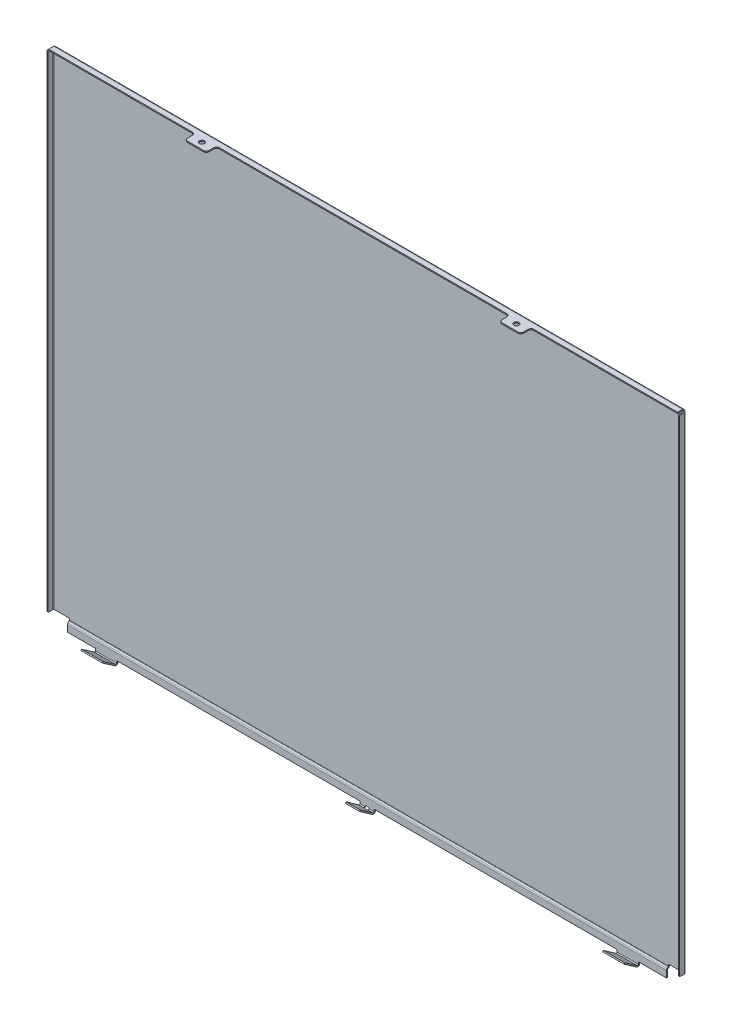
ISO-10303-21;
HEADER;
FILE_DESCRIPTION(('STEP AP214'),'2;1');
FILE_NAME('part.step','',(''),(''),'','','');
FILE_SCHEMA(('AUTOMOTIVE_DESIGN { 1 0 10303 214 1 1 1 1 }'));
ENDSEC;
DATA;
#1=APPLICATION_CONTEXT('core data for automotive mechanical design processes');
#2=APPLICATION_PROTOCOL_DEFINITION('international standard','automotive_design',2000,#1);
#3=PRODUCT_CONTEXT('',#1,'mechanical');
#4=PRODUCT('Part','Part','',(#3));
#5=PRODUCT_RELATED_PRODUCT_CATEGORY('part','',(#4));
#6=PRODUCT_DEFINITION_FORMATION('','',#4);
#7=PRODUCT_DEFINITION_CONTEXT('part definition',#1,'design');
#8=PRODUCT_DEFINITION('design','',#6,#7);
#9=PRODUCT_DEFINITION_SHAPE('','',#8);
#10=(LENGTH_UNIT() NAMED_UNIT(*) SI_UNIT(.MILLI.,.METRE.));
#11=(NAMED_UNIT(*) PLANE_ANGLE_UNIT() SI_UNIT($,.RADIAN.));
#12=(NAMED_UNIT(*) SI_UNIT($,.STERADIAN.) SOLID_ANGLE_UNIT());
#13=UNCERTAINTY_MEASURE_WITH_UNIT(LENGTH_MEASURE(1.E-05),#10,'distance_accuracy_value','');
#14=(GEOMETRIC_REPRESENTATION_CONTEXT(3) GLOBAL_UNCERTAINTY_ASSIGNED_CONTEXT((#13)) GLOBAL_UNIT_ASSIGNED_CONTEXT((#10,
#11,#12)) REPRESENTATION_CONTEXT('',''));
#15=CARTESIAN_POINT('',(0.,0.,0.));
#16=DIRECTION('',(0.,0.,1.));
#17=DIRECTION('',(1.,0.,0.));
#18=AXIS2_PLACEMENT_3D('',#15,#16,#17);
#19=CARTESIAN_POINT('',(-170.016718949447,-182.629518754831,3.34564936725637));
#20=DIRECTION('',(0.,-0.819152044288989,0.573576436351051));
#21=DIRECTION('',(0.,-0.573576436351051,-0.819152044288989));
#22=AXIS2_PLACEMENT_3D('',#19,#20,#21);
#23=PLANE('',#22);
#24=DIRECTION('',(0.,-0.573576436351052,-0.819152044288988));
#25=VECTOR('',#24,1.);
#26=CARTESIAN_POINT('',(-175.016718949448,-176.419194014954,12.2149122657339));
#27=LINE('',#26,#25);
#28=CARTESIAN_POINT('',(-175.016718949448,-176.419194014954,12.2149122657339));
#29=VERTEX_POINT('',#28);
#30=CARTESIAN_POINT('',(-175.016718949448,-182.629518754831,3.34564936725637));
#31=VERTEX_POINT('',#30);
#32=EDGE_CURVE('E549',#29,#31,#27,.T.);
#33=ORIENTED_EDGE('',*,*,#32,.F.);
#34=DIRECTION('',(1.,0.,0.));
#35=VECTOR('',#34,1.);
#36=CARTESIAN_POINT('',(-195.016718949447,-176.419194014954,12.2149122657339));
#37=LINE('',#36,#35);
#38=CARTESIAN_POINT('',(-190.016718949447,-176.419194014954,12.2149122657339));
#39=VERTEX_POINT('',#38);
#40=EDGE_CURVE('E546',#39,#29,#37,.T.);
#41=ORIENTED_EDGE('',*,*,#40,.F.);
#42=DIRECTION('',(0.,-0.573576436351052,-0.819152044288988));
#43=VECTOR('',#42,1.);
#44=CARTESIAN_POINT('',(-190.016718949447,-176.419194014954,12.2149122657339));
#45=LINE('',#44,#43);
#46=CARTESIAN_POINT('',(-190.016718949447,-182.629518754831,3.34564936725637));
#47=VERTEX_POINT('',#46);
#48=EDGE_CURVE('E542',#39,#47,#45,.T.);
#49=ORIENTED_EDGE('',*,*,#48,.T.);
#50=DIRECTION('',(1.,0.,0.));
#51=VECTOR('',#50,1.);
#52=CARTESIAN_POINT('',(-197.665821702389,-182.629518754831,3.34564936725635));
#53=LINE('',#52,#51);
#54=EDGE_CURVE('E1153',#31,#47,#53,.F.);
#55=ORIENTED_EDGE('',*,*,#54,.F.);
#56=EDGE_LOOP('',(#33,#41,#49,#55));
#57=FACE_BOUND('',#56,.T.);
#58=ADVANCED_FACE('F16',(#57),#23,.T.);
#59=CARTESIAN_POINT('',(-1.46539815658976,-182.636071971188,3.35023797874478));
#60=CARTESIAN_POINT('',(-1.55384107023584,-182.759931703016,3.17334794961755));
#61=CARTESIAN_POINT('',(-1.62026286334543,-182.842415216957,2.96000746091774));
#62=CARTESIAN_POINT('',(-1.70875698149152,-182.889006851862,2.50853657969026));
#63=CARTESIAN_POINT('',(-1.73088051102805,-182.852641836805,2.27073423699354));
#64=CARTESIAN_POINT('',(-1.73088051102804,-182.654326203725,1.83845147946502));
#65=CARTESIAN_POINT('',(-1.70875698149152,-182.492117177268,1.64477712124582));
#66=CARTESIAN_POINT('',(-1.62026286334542,-182.076879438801,1.37106097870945));
#67=CARTESIAN_POINT('',(-1.55405977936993,-181.824645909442,1.292));
#68=CARTESIAN_POINT('',(-1.46539815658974,-181.564621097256,1.292));
#69=CARTESIAN_POINT('',(-1.46539815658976,-182.629518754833,3.34564936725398));
#70=CARTESIAN_POINT('',(-1.55384130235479,-182.752621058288,3.16984105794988));
#71=CARTESIAN_POINT('',(-1.62026286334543,-182.834599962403,2.95780558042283));
#72=CARTESIAN_POINT('',(-1.70875698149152,-182.88090663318,2.50909598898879));
#73=CARTESIAN_POINT('',(-1.73088051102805,-182.844764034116,2.27274809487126));
#74=CARTESIAN_POINT('',(-1.73088051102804,-182.647661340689,1.84310926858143));
#75=CARTESIAN_POINT('',(-1.70875698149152,-182.486444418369,1.65061946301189));
#76=CARTESIAN_POINT('',(-1.62026286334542,-182.073746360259,1.37857742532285));
#77=CARTESIAN_POINT('',(-1.55405914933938,-181.823054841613,1.3));
#78=CARTESIAN_POINT('',(-1.46539815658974,-181.564621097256,1.3));
#79=CARTESIAN_POINT('',(-1.46539815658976,-181.974197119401,2.88678821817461));
#80=CARTESIAN_POINT('',(-1.55386451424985,-182.021556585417,2.81915189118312));
#81=CARTESIAN_POINT('',(-1.62026286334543,-182.053074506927,2.73761753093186));
#82=CARTESIAN_POINT('',(-1.70875698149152,-182.070884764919,2.56503691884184));
#83=CARTESIAN_POINT('',(-1.73088051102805,-182.056983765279,2.47413388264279));
#84=CARTESIAN_POINT('',(-1.73088051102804,-181.981175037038,2.30888818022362));
#85=CARTESIAN_POINT('',(-1.70875698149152,-181.919168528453,2.23485363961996));
#86=CARTESIAN_POINT('',(-1.62026286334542,-181.760438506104,2.13022208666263));
#87=CARTESIAN_POINT('',(-1.55399614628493,-181.663948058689,2.1));
#88=CARTESIAN_POINT('',(-1.46539815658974,-181.564621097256,2.1));
#89=CARTESIAN_POINT('',(-1.46539815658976,-181.967578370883,2.88215372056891));
#90=CARTESIAN_POINT('',(-1.55386474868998,-182.014172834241,2.81560993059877));
#91=CARTESIAN_POINT('',(-1.62026286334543,-182.045181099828,2.73539363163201));
#92=CARTESIAN_POINT('',(-1.70875698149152,-182.062703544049,2.56560192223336));
#93=CARTESIAN_POINT('',(-1.73088051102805,-182.049027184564,2.47616787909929));
#94=CARTESIAN_POINT('',(-1.73088051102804,-181.974443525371,2.31359254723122));
#95=CARTESIAN_POINT('',(-1.70875698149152,-181.913439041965,2.24075440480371));
#96=CARTESIAN_POINT('',(-1.62026286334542,-181.757274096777,2.13781369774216));
#97=CARTESIAN_POINT('',(-1.55399550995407,-181.662341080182,2.10808));
#98=CARTESIAN_POINT('',(-1.46539815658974,-181.564621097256,2.10808));
#99=B_SPLINE_SURFACE_WITH_KNOTS('',1,3,((#59,#60,#61,#62,#63,#64,#65,#66,#67,#68),(#69,#70,#71,
#72,#73,#74,#75,#76,#77,#78),(#79,#80,#81,#82,#83,#84,#85,#86,#87,#88),(#89,#90,#91,#92,#93,#94,
#95,#96,#97,#98)),.UNSPECIFIED.,.F.,.F.,.F.,(2,1,1,2),(4,2,2,2,4),(-0.01,0.,1.,1.0101),(0.,0.25,
0.5,0.75,1.),.UNSPECIFIED.);
#100=CARTESIAN_POINT('',(-1.46539815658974,-181.564621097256,1.3));
#101=CARTESIAN_POINT('',(-1.48777804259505,-181.629803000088,1.29995591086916));
#102=CARTESIAN_POINT('',(-1.50900428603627,-181.695404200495,1.30490269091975));
#103=CARTESIAN_POINT('',(-1.54897849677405,-181.825976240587,1.32483905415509));
#104=CARTESIAN_POINT('',(-1.56772128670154,-181.890945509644,1.33984923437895));
#105=CARTESIAN_POINT('',(-1.60455172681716,-182.026169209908,1.38238521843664));
#106=CARTESIAN_POINT('',(-1.62228991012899,-182.096120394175,1.41119839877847));
#107=CARTESIAN_POINT('',(-1.65405955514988,-182.230552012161,1.48095392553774));
#108=CARTESIAN_POINT('',(-1.66809386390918,-182.295036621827,1.5218869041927));
#109=CARTESIAN_POINT('',(-1.69156553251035,-182.413307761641,1.61257437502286));
#110=CARTESIAN_POINT('',(-1.70119490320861,-182.46746428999,1.66179651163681));
#111=CARTESIAN_POINT('',(-1.71656083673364,-182.566992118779,1.76897800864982));
#112=CARTESIAN_POINT('',(-1.72229756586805,-182.61236379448,1.82693699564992));
#113=CARTESIAN_POINT('',(-1.72952303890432,-182.691156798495,1.94739758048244));
#114=CARTESIAN_POINT('',(-1.73117257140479,-182.724983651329,2.00962462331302));
#115=CARTESIAN_POINT('',(-1.73050451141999,-182.782078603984,2.13872345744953));
#116=CARTESIAN_POINT('',(-1.72818758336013,-182.805348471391,2.20559446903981));
#117=CARTESIAN_POINT('',(-1.71953866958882,-182.840353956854,2.34062441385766));
#118=CARTESIAN_POINT('',(-1.71328648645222,-182.852307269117,2.40873220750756));
#119=CARTESIAN_POINT('',(-1.69677454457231,-182.86529163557,2.5454842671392));
#120=CARTESIAN_POINT('',(-1.6865155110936,-182.866324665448,2.61412843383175));
#121=CARTESIAN_POINT('',(-1.66186990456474,-182.857711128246,2.75032917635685));
#122=CARTESIAN_POINT('',(-1.64746316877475,-182.848011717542,2.8178786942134));
#123=CARTESIAN_POINT('',(-1.61457592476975,-182.81851699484,2.94972779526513));
#124=CARTESIAN_POINT('',(-1.59609388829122,-182.798717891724,3.01402614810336));
#125=CARTESIAN_POINT('',(-1.55963063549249,-182.755349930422,3.12428470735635));
#126=CARTESIAN_POINT('',(-1.54240912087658,-182.733528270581,3.1711989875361));
#127=CARTESIAN_POINT('',(-1.50563971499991,-182.685016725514,3.26131577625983));
#128=CARTESIAN_POINT('',(-1.48609706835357,-182.658337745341,3.30452628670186));
#129=CARTESIAN_POINT('',(-1.46539815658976,-182.629518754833,3.34564936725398));
#130=B_SPLINE_CURVE_WITH_KNOTS('',3,(#100,#101,#102,#103,#104,#105,#106,#107,#108,#109,#110,
#111,#112,#113,#114,#115,#116,#117,#118,#119,#120,#121,#122,#123,#124,#125,#126,#127,#128,#129),
.UNSPECIFIED.,.F.,.F.,(4,2,2,2,2,2,2,2,2,2,2,2,2,2,4),(0.,0.206589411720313,0.413602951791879,
0.645496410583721,0.877211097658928,1.09753889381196,1.31785727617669,1.52936013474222,
1.74082756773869,1.94813904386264,2.15541301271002,2.36371210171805,2.5720894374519,
2.73530215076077,2.89815285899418),.UNSPECIFIED.);
#131=CARTESIAN_POINT('',(-1.46539815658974,-181.564621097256,1.3));
#132=VERTEX_POINT('',#131);
#133=CARTESIAN_POINT('',(-1.46539815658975,-182.629518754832,3.3456493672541));
#134=VERTEX_POINT('',#133);
#135=EDGE_CURVE('E801',#132,#134,#130,.T.);
#136=DIRECTION('',(0.,0.,-1.));
#137=VECTOR('',#136,1.);
#138=CARTESIAN_POINT('',(-1.46539815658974,-181.564621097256,1.7));
#139=LINE('',#138,#137);
#140=CARTESIAN_POINT('',(-1.46539815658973,-181.564621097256,2.1));
#141=VERTEX_POINT('',#140);
#142=EDGE_CURVE('E833',#141,#132,#139,.T.);
#143=CARTESIAN_POINT('',(-1.46539815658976,-181.974197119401,2.88678821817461));
#144=CARTESIAN_POINT('',(-1.48085506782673,-181.982466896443,2.87496449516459));
#145=CARTESIAN_POINT('',(-1.4959570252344,-181.990445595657,2.86249133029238));
#146=CARTESIAN_POINT('',(-1.5253878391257,-182.005630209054,2.83610622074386));
#147=CARTESIAN_POINT('',(-1.53971333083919,-182.012832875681,2.8221886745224));
#148=CARTESIAN_POINT('',(-1.58148459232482,-182.033005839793,2.77795558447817));
#149=CARTESIAN_POINT('',(-1.60745241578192,-182.044389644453,2.74536144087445));
#150=CARTESIAN_POINT('',(-1.64364122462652,-182.056937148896,2.689769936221));
#151=CARTESIAN_POINT('',(-1.65586667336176,-182.060387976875,2.66857411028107));
#152=CARTESIAN_POINT('',(-1.67788016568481,-182.064488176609,2.62476954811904));
#153=CARTESIAN_POINT('',(-1.68767795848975,-182.065148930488,2.60216693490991));
#154=CARTESIAN_POINT('',(-1.7045670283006,-182.06321136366,2.55584423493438));
#155=CARTESIAN_POINT('',(-1.71163217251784,-182.060582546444,2.53211568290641));
#156=CARTESIAN_POINT('',(-1.7225824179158,-182.051714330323,2.48457176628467));
#157=CARTESIAN_POINT('',(-1.7264670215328,-182.045474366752,2.46075638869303));
#158=CARTESIAN_POINT('',(-1.73062804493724,-182.030360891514,2.41680020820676));
#159=CARTESIAN_POINT('',(-1.73127524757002,-182.021883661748,2.3965567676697));
#160=CARTESIAN_POINT('',(-1.73002474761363,-182.002384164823,2.35742852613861));
#161=CARTESIAN_POINT('',(-1.728127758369,-181.991362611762,2.33854334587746));
#162=CARTESIAN_POINT('',(-1.72207656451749,-181.967592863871,2.30326636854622));
#163=CARTESIAN_POINT('',(-1.71800314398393,-181.954918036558,2.28681070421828));
#164=CARTESIAN_POINT('',(-1.70787027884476,-181.92797164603,2.25591046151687));
#165=CARTESIAN_POINT('',(-1.70180750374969,-181.913697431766,2.24146931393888));
#166=CARTESIAN_POINT('',(-1.6873031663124,-181.882614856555,2.21353339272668));
#167=CARTESIAN_POINT('',(-1.67869255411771,-181.865694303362,2.2002522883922));
#168=CARTESIAN_POINT('',(-1.65973991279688,-181.83097235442,2.17632225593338));
#169=CARTESIAN_POINT('',(-1.6493956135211,-181.813169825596,2.16567682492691));
#170=CARTESIAN_POINT('',(-1.62212665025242,-181.76877027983,2.14260983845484));
#171=CARTESIAN_POINT('',(-1.60437349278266,-181.741919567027,2.13164992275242));
#172=CARTESIAN_POINT('',(-1.56645667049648,-181.688331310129,2.11472867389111));
#173=CARTESIAN_POINT('',(-1.54628883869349,-181.661594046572,2.10877612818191));
#174=CARTESIAN_POINT('',(-1.51557645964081,-181.623288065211,2.10330512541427));
#175=CARTESIAN_POINT('',(-1.50574626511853,-181.611358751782,2.10204804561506));
#176=CARTESIAN_POINT('',(-1.48579248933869,-181.587783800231,2.10039797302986));
#177=CARTESIAN_POINT('',(-1.47567052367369,-181.576137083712,2.10000090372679));
#178=CARTESIAN_POINT('',(-1.46539815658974,-181.564621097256,2.1));
#179=B_SPLINE_CURVE_WITH_KNOTS('',3,(#143,#144,#145,#146,#147,#148,#149,#150,#151,#152,#153,
#154,#155,#156,#157,#158,#159,#160,#161,#162,#163,#164,#165,#166,#167,#168,#169,#170,#171,#172,
#173,#174,#175,#176,#177,#178),.UNSPECIFIED.,.F.,.F.,(4,2,2,2,2,2,2,2,2,2,2,2,2,2,2,2,2,4),(0.,
0.0633892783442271,0.127034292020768,0.255424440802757,0.329299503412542,0.402872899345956,
0.477133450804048,0.551405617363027,0.616938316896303,0.682452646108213,0.745688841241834,
0.809031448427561,0.878278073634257,0.947616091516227,1.04907420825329,1.15071000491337,
1.19721281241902,1.24349470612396),.UNSPECIFIED.);
#180=CARTESIAN_POINT('',(-1.46539815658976,-181.974197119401,2.88678821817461));
#181=VERTEX_POINT('',#180);
#182=EDGE_CURVE('E826',#181,#141,#179,.T.);
#183=DIRECTION('',(0.,0.819152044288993,-0.573576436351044));
#184=VECTOR('',#183,1.);
#185=CARTESIAN_POINT('',(-1.46539815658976,-181.974197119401,2.88678821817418));
#186=LINE('',#185,#184);
#187=EDGE_CURVE('E1178',#181,#134,#186,.F.);
#188=ORIENTED_EDGE('',*,*,#135,.F.);
#189=ORIENTED_EDGE('',*,*,#142,.F.);
#190=ORIENTED_EDGE('',*,*,#182,.F.);
#191=ORIENTED_EDGE('',*,*,#187,.T.);
#192=EDGE_LOOP('',(#188,#189,#190,#191));
#193=FACE_BOUND('',#192,.T.);
#194=ADVANCED_FACE('F811',(#193),#99,.F.);
#195=CARTESIAN_POINT('',(1.43196025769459,-181.564621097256,1.292));
#196=CARTESIAN_POINT('',(1.52040317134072,-181.780563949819,1.292));
#197=CARTESIAN_POINT('',(1.5868249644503,-182.002632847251,1.34680053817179));
#198=CARTESIAN_POINT('',(1.67531908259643,-182.399180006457,1.56758796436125));
#199=CARTESIAN_POINT('',(1.69744261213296,-182.57311816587,1.73377426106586));
#200=CARTESIAN_POINT('',(1.69744261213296,-182.813474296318,2.14417212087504));
#201=CARTESIAN_POINT('',(1.67531908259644,-182.879083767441,2.3881330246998));
#202=CARTESIAN_POINT('',(1.58682496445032,-182.865128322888,2.88527299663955));
#203=CARTESIAN_POINT('',(1.52062188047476,-182.785216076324,3.13723812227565));
#204=CARTESIAN_POINT('',(1.43196025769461,-182.636071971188,3.35023797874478));
#205=CARTESIAN_POINT('',(1.43196025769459,-181.564621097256,1.3));
#206=CARTESIAN_POINT('',(1.52040340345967,-181.779243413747,1.3));
#207=CARTESIAN_POINT('',(1.5868249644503,-181.999953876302,1.3544653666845));
#208=CARTESIAN_POINT('',(1.67531908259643,-182.394075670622,1.5739024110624));
#209=CARTESIAN_POINT('',(1.69744261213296,-182.56694998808,1.73907227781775));
#210=CARTESIAN_POINT('',(1.69744261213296,-182.805836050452,2.14696005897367));
#211=CARTESIAN_POINT('',(1.67531908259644,-182.871044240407,2.3894288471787));
#212=CARTESIAN_POINT('',(1.58682496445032,-182.857174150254,2.88352820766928));
#213=CARTESIAN_POINT('',(1.52062125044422,-182.777750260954,3.13395283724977));
#214=CARTESIAN_POINT('',(1.43196025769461,-182.629518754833,3.34564936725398));
#215=CARTESIAN_POINT('',(1.43196025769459,-181.564621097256,2.1));
#216=CARTESIAN_POINT('',(1.52042661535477,-181.647189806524,2.1));
#217=CARTESIAN_POINT('',(1.5868249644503,-181.732056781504,2.12094821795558));
#218=CARTESIAN_POINT('',(1.67531908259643,-181.883642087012,2.20534708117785));
#219=CARTESIAN_POINT('',(1.69744261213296,-181.950132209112,2.26887395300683));
#220=CARTESIAN_POINT('',(1.69744261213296,-182.04201146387,2.42575386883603));
#221=CARTESIAN_POINT('',(1.67531908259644,-182.067091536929,2.51901109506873));
#222=CARTESIAN_POINT('',(1.58682496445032,-182.061756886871,2.70904931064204));
#223=CARTESIAN_POINT('',(1.52055824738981,-182.031168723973,2.8054243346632));
#224=CARTESIAN_POINT('',(1.43196025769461,-181.974197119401,2.88678821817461));
#225=CARTESIAN_POINT('',(1.43196025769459,-181.564621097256,2.10808));
#226=CARTESIAN_POINT('',(1.52042684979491,-181.645856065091,2.10808));
#227=CARTESIAN_POINT('',(1.5868249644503,-181.729351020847,2.12868969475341));
#228=CARTESIAN_POINT('',(1.67531908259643,-181.878486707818,2.21172467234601));
#229=CARTESIAN_POINT('',(1.69744261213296,-181.943902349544,2.27422494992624));
#230=CARTESIAN_POINT('',(1.69744261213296,-182.034296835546,2.42856968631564));
#231=CARTESIAN_POINT('',(1.67531908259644,-182.058971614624,2.52031987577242));
#232=CARTESIAN_POINT('',(1.58682496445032,-182.053723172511,2.70728707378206));
#233=CARTESIAN_POINT('',(1.52055761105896,-182.02362825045,2.80210619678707));
#234=CARTESIAN_POINT('',(1.43196025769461,-181.967578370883,2.88215372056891));
#235=B_SPLINE_SURFACE_WITH_KNOTS('',1,3,((#195,#196,#197,#198,#199,#200,#201,#202,#203,#204),
(#205,#206,#207,#208,#209,#210,#211,#212,#213,#214),(#215,#216,#217,#218,#219,#220,#221,#222,
#223,#224),(#225,#226,#227,#228,#229,#230,#231,#232,#233,#234)),.UNSPECIFIED.,.F.,.F.,.F.,(2,1,
1,2),(4,2,2,2,4),(-0.01,0.,1.,1.0101),(0.,0.25,0.5,0.75,1.),.UNSPECIFIED.);
#236=CARTESIAN_POINT('',(1.43196025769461,-182.629518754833,3.34564936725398));
#237=CARTESIAN_POINT('',(1.45434014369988,-182.666941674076,3.292280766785));
#238=CARTESIAN_POINT('',(1.47556638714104,-182.700516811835,3.23570605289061));
#239=CARTESIAN_POINT('',(1.51554059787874,-182.759078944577,3.11731267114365));
#240=CARTESIAN_POINT('',(1.53428338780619,-182.78404816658,3.05548347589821));
#241=CARTESIAN_POINT('',(1.57111382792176,-182.826765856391,2.92031706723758));
#242=CARTESIAN_POINT('',(1.58885201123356,-182.843285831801,2.84648985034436));
#243=CARTESIAN_POINT('',(1.62062165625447,-182.863252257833,2.69635978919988));
#244=CARTESIAN_POINT('',(1.6346559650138,-182.8667087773,2.62005889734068));
#245=CARTESIAN_POINT('',(1.65812763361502,-182.860259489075,2.47116065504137));
#246=CARTESIAN_POINT('',(1.66775700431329,-182.851001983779,2.39856556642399));
#247=CARTESIAN_POINT('',(1.68312293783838,-182.820290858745,2.25556036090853));
#248=CARTESIAN_POINT('',(1.68885966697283,-182.798837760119,2.18515015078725));
#249=CARTESIAN_POINT('',(1.69608514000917,-182.745356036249,2.05151334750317));
#250=CARTESIAN_POINT('',(1.69773467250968,-182.713784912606,1.98811204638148));
#251=CARTESIAN_POINT('',(1.69706661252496,-182.640781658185,1.86729454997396));
#252=CARTESIAN_POINT('',(1.69474968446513,-182.599351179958,1.80987735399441));
#253=CARTESIAN_POINT('',(1.68610077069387,-182.508819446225,1.70375254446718));
#254=CARTESIAN_POINT('',(1.67984858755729,-182.459884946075,1.65489593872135));
#255=CARTESIAN_POINT('',(1.66333664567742,-182.355311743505,1.56582200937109));
#256=CARTESIAN_POINT('',(1.65307761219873,-182.299674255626,1.52560312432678));
#257=CARTESIAN_POINT('',(1.62843200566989,-182.18316461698,1.45453738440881));
#258=CARTESIAN_POINT('',(1.6140252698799,-182.122267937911,1.4237378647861));
#259=CARTESIAN_POINT('',(1.58113802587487,-181.997345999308,1.3722729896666));
#260=CARTESIAN_POINT('',(1.56265598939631,-181.933319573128,1.35161144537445));
#261=CARTESIAN_POINT('',(1.52619273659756,-181.81812620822,1.3238946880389));
#262=CARTESIAN_POINT('',(1.50897122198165,-181.767179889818,1.31486101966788));
#263=CARTESIAN_POINT('',(1.47220181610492,-181.665535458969,1.30291048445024));
#264=CARTESIAN_POINT('',(1.45265916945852,-181.614837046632,1.29998009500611));
#265=CARTESIAN_POINT('',(1.43196025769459,-181.564621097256,1.3));
#266=B_SPLINE_CURVE_WITH_KNOTS('',3,(#236,#237,#238,#239,#240,#241,#242,#243,#244,#245,#246,
#247,#248,#249,#250,#251,#252,#253,#254,#255,#256,#257,#258,#259,#260,#261,#262,#263,#264,#265),
.UNSPECIFIED.,.F.,.F.,(4,2,2,2,2,2,2,2,2,2,2,2,2,2,4),(0.,0.206589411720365,0.413602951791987,
0.64549641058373,0.877211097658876,1.09753889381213,1.31785727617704,1.52936013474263,
1.74082756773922,1.94813904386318,2.15541301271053,2.3637121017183,2.57208943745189,
2.73530215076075,2.89815285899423),.UNSPECIFIED.);
#267=CARTESIAN_POINT('',(1.43196025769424,-182.629518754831,3.34564936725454));
#268=VERTEX_POINT('',#267);
#269=CARTESIAN_POINT('',(1.43196025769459,-181.564621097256,1.3));
#270=VERTEX_POINT('',#269);
#271=EDGE_CURVE('E776',#268,#270,#266,.T.);
#272=DIRECTION('',(0.,0.819152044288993,-0.573576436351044));
#273=VECTOR('',#272,1.);
#274=CARTESIAN_POINT('',(1.43196025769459,-181.974197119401,2.8867882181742));
#275=LINE('',#274,#273);
#276=CARTESIAN_POINT('',(1.4319602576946,-181.974197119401,2.88678821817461));
#277=VERTEX_POINT('',#276);
#278=EDGE_CURVE('E1150',#268,#277,#275,.T.);
#279=CARTESIAN_POINT('',(1.43196025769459,-181.564621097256,2.1));
#280=CARTESIAN_POINT('',(1.44741716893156,-181.579049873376,2.10000760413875));
#281=CARTESIAN_POINT('',(1.46251912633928,-181.593843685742,2.10062614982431));
#282=CARTESIAN_POINT('',(1.49194994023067,-181.624166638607,2.10332151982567));
#283=CARTESIAN_POINT('',(1.50627543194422,-181.639698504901,2.10540421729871));
#284=CARTESIAN_POINT('',(1.54804669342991,-181.687502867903,2.11425055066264));
#285=CARTESIAN_POINT('',(1.574014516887,-181.720731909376,2.12362071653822));
#286=CARTESIAN_POINT('',(1.6102033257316,-181.773466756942,2.14522837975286));
#287=CARTESIAN_POINT('',(1.62242877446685,-181.792808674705,2.15455905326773));
#288=CARTESIAN_POINT('',(1.64444226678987,-181.831043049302,2.17632563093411));
#289=CARTESIAN_POINT('',(1.65424005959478,-181.849937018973,2.18874869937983));
#290=CARTESIAN_POINT('',(1.6711291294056,-181.886771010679,2.2169054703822));
#291=CARTESIAN_POINT('',(1.67819427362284,-181.90470047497,2.23266900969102));
#292=CARTESIAN_POINT('',(1.68914451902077,-181.938559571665,2.26720349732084));
#293=CARTESIAN_POINT('',(1.69302912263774,-181.954488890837,2.28597491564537));
#294=CARTESIAN_POINT('',(1.69719014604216,-181.981826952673,2.32356737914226));
#295=CARTESIAN_POINT('',(1.69783734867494,-181.993547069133,2.34212267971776));
#296=CARTESIAN_POINT('',(1.69658684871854,-182.014414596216,2.38053876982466));
#297=CARTESIAN_POINT('',(1.69468985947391,-182.023562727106,2.40039919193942));
#298=CARTESIAN_POINT('',(1.6886386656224,-182.038826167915,2.440104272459));
#299=CARTESIAN_POINT('',(1.68456524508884,-182.045035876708,2.45992546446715));
#300=CARTESIAN_POINT('',(1.67443237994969,-182.054892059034,2.49972230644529));
#301=CARTESIAN_POINT('',(1.66836960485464,-182.058534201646,2.51969816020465));
#302=CARTESIAN_POINT('',(1.65386526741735,-182.063589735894,2.5611829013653));
#303=CARTESIAN_POINT('',(1.64525465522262,-182.064763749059,2.58266113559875));
#304=CARTESIAN_POINT('',(1.62630201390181,-182.06445039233,2.62482939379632));
#305=CARTESIAN_POINT('',(1.61595771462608,-182.06295950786,2.64551834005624));
#306=CARTESIAN_POINT('',(1.58868875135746,-182.056388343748,2.69511899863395));
#307=CARTESIAN_POINT('',(1.5709355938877,-182.049965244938,2.72340016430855));
#308=CARTESIAN_POINT('',(1.53301877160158,-182.033089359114,2.77700272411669));
#309=CARTESIAN_POINT('',(1.51285093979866,-182.022629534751,2.80231884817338));
#310=CARTESIAN_POINT('',(1.48213856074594,-182.005139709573,2.83683530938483));
#311=CARTESIAN_POINT('',(1.47230836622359,-181.999327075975,2.8473282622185));
#312=CARTESIAN_POINT('',(1.45235459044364,-181.987156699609,2.86758617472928));
#313=CARTESIAN_POINT('',(1.44223262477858,-181.980801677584,2.87735435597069));
#314=CARTESIAN_POINT('',(1.43196025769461,-181.974197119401,2.88678821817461));
#315=B_SPLINE_CURVE_WITH_KNOTS('',3,(#279,#280,#281,#282,#283,#284,#285,#286,#287,#288,#289,
#290,#291,#292,#293,#294,#295,#296,#297,#298,#299,#300,#301,#302,#303,#304,#305,#306,#307,#308,
#309,#310,#311,#312,#313,#314),.UNSPECIFIED.,.F.,.F.,(4,2,2,2,2,2,2,2,2,2,2,2,2,2,2,2,2,4),(0.,
0.0633892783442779,0.127034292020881,0.255424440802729,0.32929950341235,0.402872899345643,
0.477133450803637,0.551405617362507,0.616938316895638,0.682452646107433,0.745688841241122,
0.809031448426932,0.87827807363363,0.947616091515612,1.04907420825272,1.15071000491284,
1.19721281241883,1.24349470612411),.UNSPECIFIED.);
#316=CARTESIAN_POINT('',(1.43196025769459,-181.564621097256,2.1));
#317=VERTEX_POINT('',#316);
#318=EDGE_CURVE('E1137',#317,#277,#315,.T.);
#319=DIRECTION('',(0.,0.,1.));
#320=VECTOR('',#319,1.);
#321=CARTESIAN_POINT('',(1.43196025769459,-181.564621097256,1.7));
#322=LINE('',#321,#320);
#323=EDGE_CURVE('E1143',#270,#317,#322,.T.);
#324=ORIENTED_EDGE('',*,*,#271,.F.);
#325=ORIENTED_EDGE('',*,*,#278,.T.);
#326=ORIENTED_EDGE('',*,*,#318,.F.);
#327=ORIENTED_EDGE('',*,*,#323,.F.);
#328=EDGE_LOOP('',(#324,#325,#326,#327));
#329=FACE_BOUND('',#328,.T.);
#330=ADVANCED_FACE('F18',(#329),#235,.F.);
#331=CARTESIAN_POINT('',(-15.0167189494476,-182.62951875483,3.34564936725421));
#332=DIRECTION('',(0.,0.819152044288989,-0.573576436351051));
#333=DIRECTION('',(0.,0.573576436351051,0.819152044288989));
#334=AXIS2_PLACEMENT_3D('',#331,#332,#333);
#335=PLANE('',#334);
#336=DIRECTION('',(1.,0.,0.));
#337=VECTOR('',#336,1.);
#338=CARTESIAN_POINT('',(-5.01671894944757,-176.419194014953,12.2149122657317));
#339=LINE('',#338,#337);
#340=CARTESIAN_POINT('',(-5.01671894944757,-176.419194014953,12.2149122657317));
#341=VERTEX_POINT('',#340);
#342=CARTESIAN_POINT('',(4.98328105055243,-176.419194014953,12.2149122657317));
#343=VERTEX_POINT('',#342);
#344=EDGE_CURVE('E1188',#341,#343,#339,.T.);
#345=ORIENTED_EDGE('',*,*,#344,.F.);
#346=DIRECTION('',(0.,-0.573576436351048,-0.81915204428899));
#347=VECTOR('',#346,1.);
#348=CARTESIAN_POINT('',(-5.01671894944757,-176.419194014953,12.2149122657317));
#349=LINE('',#348,#347);
#350=CARTESIAN_POINT('',(-5.01671894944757,-182.629518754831,3.34564936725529));
#351=VERTEX_POINT('',#350);
#352=EDGE_CURVE('E1196',#341,#351,#349,.T.);
#353=ORIENTED_EDGE('',*,*,#352,.T.);
#354=DIRECTION('',(1.,0.,0.));
#355=VECTOR('',#354,1.);
#356=CARTESIAN_POINT('',(-7.3771428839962,-182.629518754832,3.34564936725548));
#357=LINE('',#356,#355);
#358=EDGE_CURVE('E808',#134,#351,#357,.F.);
#359=ORIENTED_EDGE('',*,*,#358,.F.);
#360=CARTESIAN_POINT('',(-0.016718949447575,-183.192626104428,2.54144872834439));
#361=DIRECTION('',(0.,0.819152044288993,-0.573576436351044));
#362=DIRECTION('',(0.,0.573576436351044,0.819152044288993));
#363=AXIS2_PLACEMENT_3D('',#360,#361,#362);
#364=CIRCLE('',#363,1.75);
#365=EDGE_CURVE('E1149',#134,#268,#364,.T.);
#366=ORIENTED_EDGE('',*,*,#365,.T.);
#367=DIRECTION('',(1.,0.,0.));
#368=VECTOR('',#367,1.);
#369=CARTESIAN_POINT('',(-0.928463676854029,-182.629518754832,3.34564936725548));
#370=LINE('',#369,#368);
#371=CARTESIAN_POINT('',(4.98328105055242,-182.629518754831,3.34564936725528));
#372=VERTEX_POINT('',#371);
#373=EDGE_CURVE('E773',#372,#268,#370,.F.);
#374=ORIENTED_EDGE('',*,*,#373,.F.);
#375=DIRECTION('',(0.,0.573576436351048,0.81915204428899));
#376=VECTOR('',#375,1.);
#377=CARTESIAN_POINT('',(4.98328105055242,-182.62951875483,3.34564936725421));
#378=LINE('',#377,#376);
#379=EDGE_CURVE('E1186',#372,#343,#378,.T.);
#380=ORIENTED_EDGE('',*,*,#379,.T.);
#381=EDGE_LOOP('',(#345,#353,#359,#366,#374,#380));
#382=FACE_BOUND('',#381,.T.);
#383=ADVANCED_FACE('F1482',(#382),#335,.F.);
#384=CARTESIAN_POINT('',(199.983281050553,-182.62951875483,3.34564936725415));
#385=DIRECTION('',(0.,-0.819152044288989,0.573576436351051));
#386=DIRECTION('',(0.,-0.573576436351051,-0.819152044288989));
#387=AXIS2_PLACEMENT_3D('',#384,#385,#386);
#388=PLANE('',#387);
#389=DIRECTION('',(0.,-0.57357643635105,-0.819152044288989));
#390=VECTOR('',#389,1.);
#391=CARTESIAN_POINT('',(174.983281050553,-176.419194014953,12.2149122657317));
#392=LINE('',#391,#390);
#393=CARTESIAN_POINT('',(174.983281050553,-176.419194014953,12.2149122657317));
#394=VERTEX_POINT('',#393);
#395=CARTESIAN_POINT('',(174.983281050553,-182.629518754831,3.34564936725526));
#396=VERTEX_POINT('',#395);
#397=EDGE_CURVE('E1175',#394,#396,#392,.T.);
#398=ORIENTED_EDGE('',*,*,#397,.T.);
#399=DIRECTION('',(1.,0.,0.));
#400=VECTOR('',#399,1.);
#401=CARTESIAN_POINT('',(167.334178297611,-182.629518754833,3.34564936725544));
#402=LINE('',#401,#400);
#403=CARTESIAN_POINT('',(189.983281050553,-182.629518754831,3.34564936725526));
#404=VERTEX_POINT('',#403);
#405=EDGE_CURVE('E522',#404,#396,#402,.F.);
#406=ORIENTED_EDGE('',*,*,#405,.F.);
#407=DIRECTION('',(0.,0.57357643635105,0.819152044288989));
#408=VECTOR('',#407,1.);
#409=CARTESIAN_POINT('',(189.983281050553,-182.62951875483,3.34564936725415));
#410=LINE('',#409,#408);
#411=CARTESIAN_POINT('',(189.983281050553,-176.419194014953,12.2149122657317));
#412=VERTEX_POINT('',#411);
#413=EDGE_CURVE('E1177',#404,#412,#410,.T.);
#414=ORIENTED_EDGE('',*,*,#413,.T.);
#415=DIRECTION('',(1.,0.,0.));
#416=VECTOR('',#415,1.);
#417=CARTESIAN_POINT('',(174.983281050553,-176.419194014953,12.2149122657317));
#418=LINE('',#417,#416);
#419=EDGE_CURVE('E1154',#394,#412,#418,.T.);
#420=ORIENTED_EDGE('',*,*,#419,.F.);
#421=EDGE_LOOP('',(#398,#406,#414,#420));
#422=FACE_BOUND('',#421,.T.);
#423=ADVANCED_FACE('F1492',(#422),#388,.T.);
#424=CARTESIAN_POINT('',(-195.016718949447,-192.883946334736,23.7436559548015));
#425=DIRECTION('',(0.,0.573576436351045,0.819152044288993));
#426=DIRECTION('',(0.,-0.819152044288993,0.573576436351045));
#427=AXIS2_PLACEMENT_3D('',#424,#425,#426);
#428=PLANE('',#427);
#429=DIRECTION('',(0.,-0.819152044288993,0.573576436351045));
#430=VECTOR('',#429,1.);
#431=CARTESIAN_POINT('',(-175.016718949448,-192.883946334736,23.7436559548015));
#432=LINE('',#431,#430);
#433=CARTESIAN_POINT('',(-175.016718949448,-175.763872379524,11.7560511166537));
#434=VERTEX_POINT('',#433);
#435=EDGE_CURVE('E543',#29,#434,#432,.F.);
#436=ORIENTED_EDGE('',*,*,#435,.T.);
#437=DIRECTION('',(1.,0.,0.));
#438=VECTOR('',#437,1.);
#439=CARTESIAN_POINT('',(-170.016718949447,-175.763872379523,11.7560511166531));
#440=LINE('',#439,#438);
#441=CARTESIAN_POINT('',(-190.016718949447,-175.763872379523,11.7560511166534));
#442=VERTEX_POINT('',#441);
#443=EDGE_CURVE('E521',#434,#442,#440,.F.);
#444=ORIENTED_EDGE('',*,*,#443,.T.);
#445=DIRECTION('',(0.,-0.819152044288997,0.573576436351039));
#446=VECTOR('',#445,1.);
#447=CARTESIAN_POINT('',(-190.016718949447,-175.763872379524,11.7560511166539));
#448=LINE('',#447,#446);
#449=EDGE_CURVE('E539',#442,#39,#448,.T.);
#450=ORIENTED_EDGE('',*,*,#449,.T.);
#451=ORIENTED_EDGE('',*,*,#40,.T.);
#452=EDGE_LOOP('',(#436,#444,#450,#451));
#453=FACE_BOUND('',#452,.T.);
#454=ADVANCED_FACE('F1489',(#453),#428,.T.);
#455=CARTESIAN_POINT('',(-5.01671894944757,-192.883946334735,23.7436559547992));
#456=DIRECTION('',(0.,0.573576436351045,0.819152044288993));
#457=DIRECTION('',(0.,-0.819152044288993,0.573576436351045));
#458=AXIS2_PLACEMENT_3D('',#455,#456,#457);
#459=PLANE('',#458);
#460=DIRECTION('',(0.,0.819152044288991,-0.573576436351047));
#461=VECTOR('',#460,1.);
#462=CARTESIAN_POINT('',(4.98328105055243,-176.419194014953,12.2149122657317));
#463=LINE('',#462,#461);
#464=CARTESIAN_POINT('',(4.98328105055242,-175.763872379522,11.7560511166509));
#465=VERTEX_POINT('',#464);
#466=EDGE_CURVE('E1151',#343,#465,#463,.T.);
#467=ORIENTED_EDGE('',*,*,#466,.T.);
#468=DIRECTION('',(1.,0.,0.));
#469=VECTOR('',#468,1.);
#470=CARTESIAN_POINT('',(-15.0167189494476,-175.763872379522,11.7560511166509));
#471=LINE('',#470,#469);
#472=CARTESIAN_POINT('',(-5.01671894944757,-175.763872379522,11.7560511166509));
#473=VERTEX_POINT('',#472);
#474=EDGE_CURVE('E1205',#473,#465,#471,.T.);
#475=ORIENTED_EDGE('',*,*,#474,.F.);
#476=DIRECTION('',(0.,-0.819152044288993,0.573576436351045));
#477=VECTOR('',#476,1.);
#478=CARTESIAN_POINT('',(-5.01671894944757,-192.883946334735,23.7436559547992));
#479=LINE('',#478,#477);
#480=EDGE_CURVE('E1193',#473,#341,#479,.T.);
#481=ORIENTED_EDGE('',*,*,#480,.T.);
#482=ORIENTED_EDGE('',*,*,#344,.T.);
#483=EDGE_LOOP('',(#467,#475,#481,#482));
#484=FACE_BOUND('',#483,.T.);
#485=ADVANCED_FACE('F1491',(#484),#459,.T.);
#486=CARTESIAN_POINT('',(-0.016718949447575,-182.537304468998,2.08258757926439));
#487=DIRECTION('',(0.,0.819152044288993,-0.573576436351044));
#488=DIRECTION('',(0.,0.573576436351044,0.819152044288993));
#489=AXIS2_PLACEMENT_3D('',#486,#487,#488);
#490=CYLINDRICAL_SURFACE('',#489,1.75);
#491=CARTESIAN_POINT('',(-0.016718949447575,-182.537304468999,2.08258757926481));
#492=DIRECTION('',(0.,0.819152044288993,-0.573576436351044));
#493=DIRECTION('',(0.,0.573576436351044,0.819152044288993));
#494=AXIS2_PLACEMENT_3D('',#491,#492,#493);
#495=CIRCLE('',#494,1.75);
#496=EDGE_CURVE('E764',#277,#181,#495,.F.);
#497=ORIENTED_EDGE('',*,*,#496,.F.);
#498=ORIENTED_EDGE('',*,*,#278,.F.);
#499=ORIENTED_EDGE('',*,*,#365,.F.);
#500=ORIENTED_EDGE('',*,*,#187,.F.);
#501=EDGE_LOOP('',(#497,#498,#499,#500));
#502=FACE_BOUND('',#501,.T.);
#503=ADVANCED_FACE('F1479',(#502),#490,.F.);
#504=CARTESIAN_POINT('',(174.983281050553,-192.883946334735,23.7436559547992));
#505=DIRECTION('',(0.,0.573576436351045,0.819152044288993));
#506=DIRECTION('',(0.,-0.819152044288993,0.573576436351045));
#507=AXIS2_PLACEMENT_3D('',#504,#505,#506);
#508=PLANE('',#507);
#509=DIRECTION('',(0.,-0.819152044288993,0.573576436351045));
#510=VECTOR('',#509,1.);
#511=CARTESIAN_POINT('',(174.983281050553,-192.883946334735,23.7436559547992));
#512=LINE('',#511,#510);
#513=CARTESIAN_POINT('',(174.983281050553,-175.763872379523,11.7560511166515));
#514=VERTEX_POINT('',#513);
#515=EDGE_CURVE('E1161',#514,#394,#512,.T.);
#516=ORIENTED_EDGE('',*,*,#515,.T.);
#517=ORIENTED_EDGE('',*,*,#419,.T.);
#518=DIRECTION('',(0.,-0.819152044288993,0.573576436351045));
#519=VECTOR('',#518,1.);
#520=CARTESIAN_POINT('',(189.983281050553,-192.883946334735,23.7436559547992));
#521=LINE('',#520,#519);
#522=CARTESIAN_POINT('',(189.983281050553,-175.763872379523,11.7560511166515));
#523=VERTEX_POINT('',#522);
#524=EDGE_CURVE('E1167',#412,#523,#521,.F.);
#525=ORIENTED_EDGE('',*,*,#524,.T.);
#526=DIRECTION('',(1.,0.,0.));
#527=VECTOR('',#526,1.);
#528=CARTESIAN_POINT('',(199.983281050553,-175.763872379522,11.7560511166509));
#529=LINE('',#528,#527);
#530=EDGE_CURVE('E1232',#523,#514,#529,.F.);
#531=ORIENTED_EDGE('',*,*,#530,.T.);
#532=EDGE_LOOP('',(#516,#517,#525,#531));
#533=FACE_BOUND('',#532,.T.);
#534=ADVANCED_FACE('F1268',(#533),#508,.T.);
#535=CARTESIAN_POINT('',(-197.665821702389,-181.564621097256,2.6));
#536=DIRECTION('',(1.,0.,0.));
#537=DIRECTION('',(0.,0.,-1.));
#538=AXIS2_PLACEMENT_3D('',#535,#536,#537);
#539=CYLINDRICAL_SURFACE('',#538,1.3);
#540=CARTESIAN_POINT('',(-190.016718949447,-181.564621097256,2.6));
#541=DIRECTION('',(1.,0.,0.));
#542=DIRECTION('',(0.,0.,-1.));
#543=AXIS2_PLACEMENT_3D('',#540,#541,#542);
#544=CIRCLE('',#543,1.3);
#545=CARTESIAN_POINT('',(-190.016718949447,-181.564621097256,1.3));
#546=VERTEX_POINT('',#545);
#547=EDGE_CURVE('E809',#47,#546,#544,.T.);
#548=ORIENTED_EDGE('',*,*,#547,.T.);
#549=DIRECTION('',(1.,0.,0.));
#550=VECTOR('',#549,1.);
#551=CARTESIAN_POINT('',(-220.324659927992,-181.564621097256,1.3));
#552=LINE('',#551,#550);
#553=CARTESIAN_POINT('',(-175.016718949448,-181.564621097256,1.3));
#554=VERTEX_POINT('',#553);
#555=EDGE_CURVE('E1229',#546,#554,#552,.T.);
#556=ORIENTED_EDGE('',*,*,#555,.T.);
#557=CARTESIAN_POINT('',(-175.016718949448,-181.564621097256,2.6));
#558=DIRECTION('',(1.,0.,0.));
#559=DIRECTION('',(0.,0.,-1.));
#560=AXIS2_PLACEMENT_3D('',#557,#558,#559);
#561=CIRCLE('',#560,1.3);
#562=EDGE_CURVE('E1152',#554,#31,#561,.F.);
#563=ORIENTED_EDGE('',*,*,#562,.T.);
#564=ORIENTED_EDGE('',*,*,#54,.T.);
#565=EDGE_LOOP('',(#548,#556,#563,#564));
#566=FACE_BOUND('',#565,.T.);
#567=ADVANCED_FACE('F798',(#566),#539,.T.);
#568=CARTESIAN_POINT('',(-7.3771428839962,-181.564621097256,2.6));
#569=DIRECTION('',(1.,0.,0.));
#570=DIRECTION('',(0.,0.,-1.));
#571=AXIS2_PLACEMENT_3D('',#568,#569,#570);
#572=CYLINDRICAL_SURFACE('',#571,1.3);
#573=CARTESIAN_POINT('',(-5.01671894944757,-181.564621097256,2.6));
#574=DIRECTION('',(1.,0.,0.));
#575=DIRECTION('',(0.,0.,-1.));
#576=AXIS2_PLACEMENT_3D('',#573,#574,#575);
#577=CIRCLE('',#576,1.3);
#578=CARTESIAN_POINT('',(-5.01671894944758,-181.564621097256,1.3));
#579=VERTEX_POINT('',#578);
#580=EDGE_CURVE('E784',#351,#579,#577,.T.);
#581=ORIENTED_EDGE('',*,*,#580,.T.);
#582=DIRECTION('',(1.,0.,0.));
#583=VECTOR('',#582,1.);
#584=CARTESIAN_POINT('',(-220.324659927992,-181.564621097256,1.3));
#585=LINE('',#584,#583);
#586=EDGE_CURVE('E1231',#579,#132,#585,.T.);
#587=ORIENTED_EDGE('',*,*,#586,.T.);
#588=ORIENTED_EDGE('',*,*,#135,.T.);
#589=ORIENTED_EDGE('',*,*,#358,.T.);
#590=EDGE_LOOP('',(#581,#587,#588,#589));
#591=FACE_BOUND('',#590,.T.);
#592=ADVANCED_FACE('F792',(#591),#572,.T.);
#593=CARTESIAN_POINT('',(-0.928463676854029,-181.564621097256,2.6));
#594=DIRECTION('',(1.,0.,0.));
#595=DIRECTION('',(0.,0.,-1.));
#596=AXIS2_PLACEMENT_3D('',#593,#594,#595);
#597=CYLINDRICAL_SURFACE('',#596,1.3);
#598=CARTESIAN_POINT('',(4.98328105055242,-181.564621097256,2.6));
#599=DIRECTION('',(1.,0.,0.));
#600=DIRECTION('',(0.,0.,-1.));
#601=AXIS2_PLACEMENT_3D('',#598,#599,#600);
#602=CIRCLE('',#601,1.3);
#603=CARTESIAN_POINT('',(4.98328105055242,-181.564621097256,1.29999999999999));
#604=VERTEX_POINT('',#603);
#605=EDGE_CURVE('E774',#604,#372,#602,.F.);
#606=ORIENTED_EDGE('',*,*,#605,.T.);
#607=ORIENTED_EDGE('',*,*,#373,.T.);
#608=ORIENTED_EDGE('',*,*,#271,.T.);
#609=DIRECTION('',(1.,0.,0.));
#610=VECTOR('',#609,1.);
#611=CARTESIAN_POINT('',(-220.324659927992,-181.564621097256,1.3));
#612=LINE('',#611,#610);
#613=EDGE_CURVE('E1352',#270,#604,#612,.T.);
#614=ORIENTED_EDGE('',*,*,#613,.T.);
#615=EDGE_LOOP('',(#606,#607,#608,#614));
#616=FACE_BOUND('',#615,.T.);
#617=ADVANCED_FACE('F786',(#616),#597,.T.);
#618=CARTESIAN_POINT('',(167.334178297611,-181.564621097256,2.6));
#619=DIRECTION('',(1.,0.,0.));
#620=DIRECTION('',(0.,0.,-1.));
#621=AXIS2_PLACEMENT_3D('',#618,#619,#620);
#622=CYLINDRICAL_SURFACE('',#621,1.3);
#623=CARTESIAN_POINT('',(189.983281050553,-181.564621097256,2.6));
#624=DIRECTION('',(1.,0.,0.));
#625=DIRECTION('',(0.,0.,-1.));
#626=AXIS2_PLACEMENT_3D('',#623,#624,#625);
#627=CIRCLE('',#626,1.3);
#628=CARTESIAN_POINT('',(189.983281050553,-181.564621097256,1.29999999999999));
#629=VERTEX_POINT('',#628);
#630=EDGE_CURVE('E769',#629,#404,#627,.F.);
#631=ORIENTED_EDGE('',*,*,#630,.T.);
#632=ORIENTED_EDGE('',*,*,#405,.T.);
#633=CARTESIAN_POINT('',(174.983281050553,-181.564621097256,2.6));
#634=DIRECTION('',(1.,0.,0.));
#635=DIRECTION('',(0.,0.,-1.));
#636=AXIS2_PLACEMENT_3D('',#633,#634,#635);
#637=CIRCLE('',#636,1.3);
#638=CARTESIAN_POINT('',(174.983281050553,-181.564621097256,1.29999999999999));
#639=VERTEX_POINT('',#638);
#640=EDGE_CURVE('E771',#396,#639,#637,.T.);
#641=ORIENTED_EDGE('',*,*,#640,.T.);
#642=DIRECTION('',(1.,0.,0.));
#643=VECTOR('',#642,1.);
#644=CARTESIAN_POINT('',(-220.324659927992,-181.564621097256,1.3));
#645=LINE('',#644,#643);
#646=EDGE_CURVE('E1276',#639,#629,#645,.T.);
#647=ORIENTED_EDGE('',*,*,#646,.T.);
#648=EDGE_LOOP('',(#631,#632,#641,#647));
#649=FACE_BOUND('',#648,.T.);
#650=ADVANCED_FACE('F791',(#649),#622,.T.);
#651=CARTESIAN_POINT('',(-170.016718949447,-181.974197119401,2.8867882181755));
#652=DIRECTION('',(0.,-0.819152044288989,0.573576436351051));
#653=DIRECTION('',(0.,-0.573576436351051,-0.819152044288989));
#654=AXIS2_PLACEMENT_3D('',#651,#652,#653);
#655=PLANE('',#654);
#656=DIRECTION('',(0.,-0.573576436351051,-0.819152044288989));
#657=VECTOR('',#656,1.);
#658=CARTESIAN_POINT('',(-190.016718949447,-181.974197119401,2.8867882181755));
#659=LINE('',#658,#657);
#660=CARTESIAN_POINT('',(-190.016718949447,-181.974197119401,2.88678821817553));
#661=VERTEX_POINT('',#660);
#662=EDGE_CURVE('E553',#442,#661,#659,.T.);
#663=ORIENTED_EDGE('',*,*,#662,.F.);
#664=ORIENTED_EDGE('',*,*,#443,.F.);
#665=DIRECTION('',(0.,-0.573576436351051,-0.819152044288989));
#666=VECTOR('',#665,1.);
#667=CARTESIAN_POINT('',(-175.016718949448,-181.974197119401,2.8867882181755));
#668=LINE('',#667,#666);
#669=CARTESIAN_POINT('',(-175.016718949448,-181.974197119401,2.88678821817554));
#670=VERTEX_POINT('',#669);
#671=EDGE_CURVE('E506',#670,#434,#668,.F.);
#672=ORIENTED_EDGE('',*,*,#671,.F.);
#673=DIRECTION('',(1.,0.,0.));
#674=VECTOR('',#673,1.);
#675=CARTESIAN_POINT('',(-197.665821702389,-181.974197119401,2.88678821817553));
#676=LINE('',#675,#674);
#677=EDGE_CURVE('E520',#670,#661,#676,.F.);
#678=ORIENTED_EDGE('',*,*,#677,.T.);
#679=EDGE_LOOP('',(#663,#664,#672,#678));
#680=FACE_BOUND('',#679,.T.);
#681=ADVANCED_FACE('F519',(#680),#655,.F.);
#682=CARTESIAN_POINT('',(-15.0167189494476,-181.9741971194,2.88678821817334));
#683=DIRECTION('',(0.,0.819152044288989,-0.573576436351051));
#684=DIRECTION('',(0.,0.573576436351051,0.819152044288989));
#685=AXIS2_PLACEMENT_3D('',#682,#683,#684);
#686=PLANE('',#685);
#687=ORIENTED_EDGE('',*,*,#496,.T.);
#688=DIRECTION('',(1.,0.,0.));
#689=VECTOR('',#688,1.);
#690=CARTESIAN_POINT('',(-7.3771428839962,-181.974197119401,2.88678821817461));
#691=LINE('',#690,#689);
#692=CARTESIAN_POINT('',(-5.01671894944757,-181.9741971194,2.88678821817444));
#693=VERTEX_POINT('',#692);
#694=EDGE_CURVE('E763',#181,#693,#691,.F.);
#695=ORIENTED_EDGE('',*,*,#694,.T.);
#696=DIRECTION('',(0.,0.573576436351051,0.819152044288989));
#697=VECTOR('',#696,1.);
#698=CARTESIAN_POINT('',(-5.01671894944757,-181.9741971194,2.88678821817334));
#699=LINE('',#698,#697);
#700=EDGE_CURVE('E1202',#693,#473,#699,.T.);
#701=ORIENTED_EDGE('',*,*,#700,.T.);
#702=ORIENTED_EDGE('',*,*,#474,.T.);
#703=DIRECTION('',(0.,0.573576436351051,0.819152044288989));
#704=VECTOR('',#703,1.);
#705=CARTESIAN_POINT('',(4.98328105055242,-181.9741971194,2.88678821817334));
#706=LINE('',#705,#704);
#707=CARTESIAN_POINT('',(4.98328105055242,-181.9741971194,2.88678821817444));
#708=VERTEX_POINT('',#707);
#709=EDGE_CURVE('E768',#465,#708,#706,.F.);
#710=ORIENTED_EDGE('',*,*,#709,.T.);
#711=DIRECTION('',(1.,0.,0.));
#712=VECTOR('',#711,1.);
#713=CARTESIAN_POINT('',(-0.928463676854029,-181.974197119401,2.88678821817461));
#714=LINE('',#713,#712);
#715=EDGE_CURVE('E762',#708,#277,#714,.F.);
#716=ORIENTED_EDGE('',*,*,#715,.T.);
#717=EDGE_LOOP('',(#687,#695,#701,#702,#710,#716));
#718=FACE_BOUND('',#717,.T.);
#719=ADVANCED_FACE('F871',(#718),#686,.T.);
#720=CARTESIAN_POINT('',(199.983281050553,-181.9741971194,2.88678821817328));
#721=DIRECTION('',(0.,-0.819152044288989,0.573576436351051));
#722=DIRECTION('',(0.,-0.573576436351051,-0.819152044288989));
#723=AXIS2_PLACEMENT_3D('',#720,#721,#722);
#724=PLANE('',#723);
#725=DIRECTION('',(0.,-0.573576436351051,-0.819152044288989));
#726=VECTOR('',#725,1.);
#727=CARTESIAN_POINT('',(189.983281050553,-181.9741971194,2.88678821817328));
#728=LINE('',#727,#726);
#729=CARTESIAN_POINT('',(189.983281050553,-181.9741971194,2.88678821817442));
#730=VERTEX_POINT('',#729);
#731=EDGE_CURVE('E1182',#730,#523,#728,.F.);
#732=ORIENTED_EDGE('',*,*,#731,.F.);
#733=DIRECTION('',(1.,0.,0.));
#734=VECTOR('',#733,1.);
#735=CARTESIAN_POINT('',(167.334178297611,-181.974197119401,2.8867882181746));
#736=LINE('',#735,#734);
#737=CARTESIAN_POINT('',(174.983281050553,-181.9741971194,2.88678821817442));
#738=VERTEX_POINT('',#737);
#739=EDGE_CURVE('E1258',#730,#738,#736,.F.);
#740=ORIENTED_EDGE('',*,*,#739,.T.);
#741=DIRECTION('',(0.,-0.573576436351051,-0.819152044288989));
#742=VECTOR('',#741,1.);
#743=CARTESIAN_POINT('',(174.983281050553,-181.9741971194,2.88678821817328));
#744=LINE('',#743,#742);
#745=EDGE_CURVE('E767',#514,#738,#744,.T.);
#746=ORIENTED_EDGE('',*,*,#745,.F.);
#747=ORIENTED_EDGE('',*,*,#530,.F.);
#748=EDGE_LOOP('',(#732,#740,#746,#747));
#749=FACE_BOUND('',#748,.T.);
#750=ADVANCED_FACE('F867',(#749),#724,.F.);
#751=CARTESIAN_POINT('',(-220.324659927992,-1.88317323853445,1.29999999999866));
#752=DIRECTION('',(0.,0.,1.));
#753=DIRECTION('',(0.,-1.,0.));
#754=AXIS2_PLACEMENT_3D('',#751,#752,#753);
#755=PLANE('',#754);
#756=DIRECTION('',(1.,0.,0.));
#757=VECTOR('',#756,1.);
#758=CARTESIAN_POINT('',(-220.324659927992,-180.064621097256,1.29999999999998));
#759=LINE('',#758,#757);
#760=CARTESIAN_POINT('',(-209.516718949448,-180.064621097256,1.29999999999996));
#761=VERTEX_POINT('',#760);
#762=CARTESIAN_POINT('',(-190.016718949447,-180.064621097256,1.3));
#763=VERTEX_POINT('',#762);
#764=EDGE_CURVE('E1234',#761,#763,#759,.T.);
#765=ORIENTED_EDGE('',*,*,#764,.F.);
#766=DIRECTION('',(0.,-1.,0.));
#767=VECTOR('',#766,1.);
#768=CARTESIAN_POINT('',(-209.516718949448,-1.88317323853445,1.29999999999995));
#769=LINE('',#768,#767);
#770=CARTESIAN_POINT('',(-209.516718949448,-175.446666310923,1.29999999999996));
#771=VERTEX_POINT('',#770);
#772=EDGE_CURVE('E1343',#771,#761,#769,.T.);
#773=ORIENTED_EDGE('',*,*,#772,.F.);
#774=DIRECTION('',(1.,0.,0.));
#775=VECTOR('',#774,1.);
#776=CARTESIAN_POINT('',(-220.324659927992,-175.446666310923,1.29999999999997));
#777=LINE('',#776,#775);
#778=CARTESIAN_POINT('',(209.483281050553,-175.446666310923,1.29999999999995));
#779=VERTEX_POINT('',#778);
#780=EDGE_CURVE('E1337',#771,#779,#777,.T.);
#781=ORIENTED_EDGE('',*,*,#780,.T.);
#782=DIRECTION('',(0.,1.,0.));
#783=VECTOR('',#782,1.);
#784=CARTESIAN_POINT('',(209.483281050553,-1.88317323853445,1.29999999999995));
#785=LINE('',#784,#783);
#786=CARTESIAN_POINT('',(209.483281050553,-180.064621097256,1.29999999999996));
#787=VERTEX_POINT('',#786);
#788=EDGE_CURVE('E1424',#779,#787,#785,.F.);
#789=ORIENTED_EDGE('',*,*,#788,.T.);
#790=DIRECTION('',(1.,0.,0.));
#791=VECTOR('',#790,1.);
#792=CARTESIAN_POINT('',(-220.324659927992,-180.064621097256,1.29999999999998));
#793=LINE('',#792,#791);
#794=CARTESIAN_POINT('',(189.983281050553,-180.064621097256,1.29999999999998));
#795=VERTEX_POINT('',#794);
#796=EDGE_CURVE('E1361',#795,#787,#793,.T.);
#797=ORIENTED_EDGE('',*,*,#796,.F.);
#798=DIRECTION('',(0.,1.,0.));
#799=VECTOR('',#798,1.);
#800=CARTESIAN_POINT('',(189.983281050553,-180.064621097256,1.29999999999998));
#801=LINE('',#800,#799);
#802=EDGE_CURVE('E1261',#795,#629,#801,.F.);
#803=ORIENTED_EDGE('',*,*,#802,.T.);
#804=ORIENTED_EDGE('',*,*,#646,.F.);
#805=DIRECTION('',(0.,1.,0.));
#806=VECTOR('',#805,1.);
#807=CARTESIAN_POINT('',(174.983281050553,-180.064621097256,1.29999999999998));
#808=LINE('',#807,#806);
#809=CARTESIAN_POINT('',(174.983281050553,-180.064621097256,1.29999999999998));
#810=VERTEX_POINT('',#809);
#811=EDGE_CURVE('E1262',#810,#639,#808,.F.);
#812=ORIENTED_EDGE('',*,*,#811,.F.);
#813=DIRECTION('',(1.,0.,0.));
#814=VECTOR('',#813,1.);
#815=CARTESIAN_POINT('',(-220.324659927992,-180.064621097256,1.29999999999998));
#816=LINE('',#815,#814);
#817=CARTESIAN_POINT('',(4.98328105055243,-180.064621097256,1.29999999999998));
#818=VERTEX_POINT('',#817);
#819=EDGE_CURVE('E1278',#818,#810,#816,.T.);
#820=ORIENTED_EDGE('',*,*,#819,.F.);
#821=DIRECTION('',(0.,-1.,0.));
#822=VECTOR('',#821,1.);
#823=CARTESIAN_POINT('',(4.98328105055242,-180.064621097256,1.29999999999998));
#824=LINE('',#823,#822);
#825=EDGE_CURVE('E1288',#818,#604,#824,.T.);
#826=ORIENTED_EDGE('',*,*,#825,.T.);
#827=ORIENTED_EDGE('',*,*,#613,.F.);
#828=CARTESIAN_POINT('',(-0.016718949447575,-182.546368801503,1.3));
#829=DIRECTION('',(0.,0.,1.));
#830=DIRECTION('',(1.,0.,0.));
#831=AXIS2_PLACEMENT_3D('',#828,#829,#830);
#832=CIRCLE('',#831,1.75);
#833=EDGE_CURVE('E759',#270,#132,#832,.T.);
#834=ORIENTED_EDGE('',*,*,#833,.T.);
#835=ORIENTED_EDGE('',*,*,#586,.F.);
#836=DIRECTION('',(0.,1.,0.));
#837=VECTOR('',#836,1.);
#838=CARTESIAN_POINT('',(-5.01671894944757,-180.064621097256,1.3));
#839=LINE('',#838,#837);
#840=CARTESIAN_POINT('',(-5.01671894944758,-180.064621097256,1.3));
#841=VERTEX_POINT('',#840);
#842=EDGE_CURVE('E1222',#579,#841,#839,.T.);
#843=ORIENTED_EDGE('',*,*,#842,.T.);
#844=DIRECTION('',(1.,0.,0.));
#845=VECTOR('',#844,1.);
#846=CARTESIAN_POINT('',(-220.324659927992,-180.064621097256,1.29999999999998));
#847=LINE('',#846,#845);
#848=CARTESIAN_POINT('',(-175.016718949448,-180.064621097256,1.29999999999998));
#849=VERTEX_POINT('',#848);
#850=EDGE_CURVE('E531',#849,#841,#847,.T.);
#851=ORIENTED_EDGE('',*,*,#850,.F.);
#852=DIRECTION('',(0.,1.,0.));
#853=VECTOR('',#852,1.);
#854=CARTESIAN_POINT('',(-175.016718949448,-180.064621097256,1.29999999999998));
#855=LINE('',#854,#853);
#856=EDGE_CURVE('E527',#849,#554,#855,.F.);
#857=ORIENTED_EDGE('',*,*,#856,.T.);
#858=ORIENTED_EDGE('',*,*,#555,.F.);
#859=DIRECTION('',(0.,1.,0.));
#860=VECTOR('',#859,1.);
#861=CARTESIAN_POINT('',(-190.016718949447,-180.064621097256,1.3));
#862=LINE('',#861,#860);
#863=EDGE_CURVE('E533',#546,#763,#862,.T.);
#864=ORIENTED_EDGE('',*,*,#863,.T.);
#865=EDGE_LOOP('',(#765,#773,#781,#789,#797,#803,#804,#812,#820,#826,#827,#834,#835,#843,#851,
#857,#858,#864));
#866=FACE_BOUND('',#865,.T.);
#867=ADVANCED_FACE('F863',(#866),#755,.F.);
#868=CARTESIAN_POINT('',(-220.324659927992,-180.064621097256,2.1));
#869=DIRECTION('',(0.,-1.,0.));
#870=DIRECTION('',(0.,0.,-1.));
#871=AXIS2_PLACEMENT_3D('',#868,#869,#870);
#872=PLANE('',#871);
#873=DIRECTION('',(0.,0.,-1.));
#874=VECTOR('',#873,1.);
#875=CARTESIAN_POINT('',(-190.016718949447,-180.064621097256,0.0999999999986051));
#876=LINE('',#875,#874);
#877=CARTESIAN_POINT('',(-190.016718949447,-180.064621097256,2.1));
#878=VERTEX_POINT('',#877);
#879=EDGE_CURVE('E528',#763,#878,#876,.F.);
#880=ORIENTED_EDGE('',*,*,#879,.T.);
#881=DIRECTION('',(1.,0.,0.));
#882=VECTOR('',#881,1.);
#883=CARTESIAN_POINT('',(-220.324659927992,-180.064621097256,2.1));
#884=LINE('',#883,#882);
#885=CARTESIAN_POINT('',(-209.516718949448,-180.064621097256,2.1));
#886=VERTEX_POINT('',#885);
#887=EDGE_CURVE('E1330',#886,#878,#884,.T.);
#888=ORIENTED_EDGE('',*,*,#887,.F.);
#889=DIRECTION('',(0.,0.,1.));
#890=VECTOR('',#889,1.);
#891=CARTESIAN_POINT('',(-209.516718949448,-180.064621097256,2.09999999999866));
#892=LINE('',#891,#890);
#893=EDGE_CURVE('E1340',#761,#886,#892,.T.);
#894=ORIENTED_EDGE('',*,*,#893,.F.);
#895=ORIENTED_EDGE('',*,*,#764,.T.);
#896=EDGE_LOOP('',(#880,#888,#894,#895));
#897=FACE_BOUND('',#896,.T.);
#898=ADVANCED_FACE('F859',(#897),#872,.T.);
#899=CARTESIAN_POINT('',(-190.016718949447,-180.064621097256,0.0999999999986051));
#900=DIRECTION('',(1.,0.,0.));
#901=DIRECTION('',(0.,0.,-1.));
#902=AXIS2_PLACEMENT_3D('',#899,#900,#901);
#903=PLANE('',#902);
#904=DIRECTION('',(0.,-1.,0.));
#905=VECTOR('',#904,1.);
#906=CARTESIAN_POINT('',(-190.016718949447,-1.88317323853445,2.09999999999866));
#907=LINE('',#906,#905);
#908=CARTESIAN_POINT('',(-190.016718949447,-181.564621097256,2.1));
#909=VERTEX_POINT('',#908);
#910=EDGE_CURVE('E1328',#878,#909,#907,.T.);
#911=ORIENTED_EDGE('',*,*,#910,.F.);
#912=ORIENTED_EDGE('',*,*,#879,.F.);
#913=ORIENTED_EDGE('',*,*,#863,.F.);
#914=ORIENTED_EDGE('',*,*,#547,.F.);
#915=ORIENTED_EDGE('',*,*,#48,.F.);
#916=ORIENTED_EDGE('',*,*,#449,.F.);
#917=ORIENTED_EDGE('',*,*,#662,.T.);
#918=CARTESIAN_POINT('',(-190.016718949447,-181.564621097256,2.6));
#919=DIRECTION('',(1.,0.,0.));
#920=DIRECTION('',(0.,0.,-1.));
#921=AXIS2_PLACEMENT_3D('',#918,#919,#920);
#922=CIRCLE('',#921,0.500000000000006);
#923=EDGE_CURVE('E514',#909,#661,#922,.F.);
#924=ORIENTED_EDGE('',*,*,#923,.F.);
#925=EDGE_LOOP('',(#911,#912,#913,#914,#915,#916,#917,#924));
#926=FACE_BOUND('',#925,.T.);
#927=ADVANCED_FACE('F856',(#926),#903,.F.);
#928=CARTESIAN_POINT('',(-197.665821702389,-181.564621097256,2.6));
#929=DIRECTION('',(1.,0.,0.));
#930=DIRECTION('',(0.,0.,-1.));
#931=AXIS2_PLACEMENT_3D('',#928,#929,#930);
#932=CYLINDRICAL_SURFACE('',#931,0.500000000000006);
#933=DIRECTION('',(1.,0.,0.));
#934=VECTOR('',#933,1.);
#935=CARTESIAN_POINT('',(-220.324659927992,-181.564621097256,2.1));
#936=LINE('',#935,#934);
#937=CARTESIAN_POINT('',(-175.016718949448,-181.564621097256,2.1));
#938=VERTEX_POINT('',#937);
#939=EDGE_CURVE('E1324',#909,#938,#936,.T.);
#940=ORIENTED_EDGE('',*,*,#939,.F.);
#941=ORIENTED_EDGE('',*,*,#923,.T.);
#942=ORIENTED_EDGE('',*,*,#677,.F.);
#943=CARTESIAN_POINT('',(-175.016718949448,-181.564621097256,2.6));
#944=DIRECTION('',(1.,0.,0.));
#945=DIRECTION('',(0.,0.,-1.));
#946=AXIS2_PLACEMENT_3D('',#943,#944,#945);
#947=CIRCLE('',#946,0.500000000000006);
#948=EDGE_CURVE('E23',#670,#938,#947,.T.);
#949=ORIENTED_EDGE('',*,*,#948,.T.);
#950=EDGE_LOOP('',(#940,#941,#942,#949));
#951=FACE_BOUND('',#950,.T.);
#952=ADVANCED_FACE('F524',(#951),#932,.F.);
#953=CARTESIAN_POINT('',(-175.016718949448,-180.064621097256,2.1));
#954=DIRECTION('',(-1.,0.,0.));
#955=DIRECTION('',(0.,0.,1.));
#956=AXIS2_PLACEMENT_3D('',#953,#954,#955);
#957=PLANE('',#956);
#958=ORIENTED_EDGE('',*,*,#856,.F.);
#959=DIRECTION('',(0.,0.,-1.));
#960=VECTOR('',#959,1.);
#961=CARTESIAN_POINT('',(-175.016718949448,-180.064621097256,2.1));
#962=LINE('',#961,#960);
#963=CARTESIAN_POINT('',(-175.016718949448,-180.064621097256,2.1));
#964=VERTEX_POINT('',#963);
#965=EDGE_CURVE('E1219',#964,#849,#962,.T.);
#966=ORIENTED_EDGE('',*,*,#965,.F.);
#967=DIRECTION('',(0.,-1.,0.));
#968=VECTOR('',#967,1.);
#969=CARTESIAN_POINT('',(-175.016718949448,-1.88317323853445,2.09999999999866));
#970=LINE('',#969,#968);
#971=EDGE_CURVE('E509',#938,#964,#970,.F.);
#972=ORIENTED_EDGE('',*,*,#971,.F.);
#973=ORIENTED_EDGE('',*,*,#948,.F.);
#974=ORIENTED_EDGE('',*,*,#671,.T.);
#975=ORIENTED_EDGE('',*,*,#435,.F.);
#976=ORIENTED_EDGE('',*,*,#32,.T.);
#977=ORIENTED_EDGE('',*,*,#562,.F.);
#978=EDGE_LOOP('',(#958,#966,#972,#973,#974,#975,#976,#977));
#979=FACE_BOUND('',#978,.T.);
#980=ADVANCED_FACE('F504',(#979),#957,.F.);
#981=CARTESIAN_POINT('',(-220.324659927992,-180.064621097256,2.1));
#982=DIRECTION('',(0.,-1.,0.));
#983=DIRECTION('',(0.,0.,-1.));
#984=AXIS2_PLACEMENT_3D('',#981,#982,#983);
#985=PLANE('',#984);
#986=DIRECTION('',(1.,0.,0.));
#987=VECTOR('',#986,1.);
#988=CARTESIAN_POINT('',(-220.324659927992,-180.064621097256,2.1));
#989=LINE('',#988,#987);
#990=CARTESIAN_POINT('',(-5.01671894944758,-180.064621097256,2.1));
#991=VERTEX_POINT('',#990);
#992=EDGE_CURVE('E1309',#964,#991,#989,.T.);
#993=ORIENTED_EDGE('',*,*,#992,.F.);
#994=ORIENTED_EDGE('',*,*,#965,.T.);
#995=ORIENTED_EDGE('',*,*,#850,.T.);
#996=DIRECTION('',(0.,0.,1.));
#997=VECTOR('',#996,1.);
#998=CARTESIAN_POINT('',(-5.01671894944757,-180.064621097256,0.0999999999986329));
#999=LINE('',#998,#997);
#1000=EDGE_CURVE('E1224',#841,#991,#999,.T.);
#1001=ORIENTED_EDGE('',*,*,#1000,.T.);
#1002=EDGE_LOOP('',(#993,#994,#995,#1001));
#1003=FACE_BOUND('',#1002,.T.);
#1004=ADVANCED_FACE('F847',(#1003),#985,.T.);
#1005=CARTESIAN_POINT('',(-5.01671894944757,-180.064621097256,0.0999999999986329));
#1006=DIRECTION('',(1.,0.,0.));
#1007=DIRECTION('',(0.,1.,0.));
#1008=AXIS2_PLACEMENT_3D('',#1005,#1006,#1007);
#1009=PLANE('',#1008);
#1010=DIRECTION('',(0.,-1.,0.));
#1011=VECTOR('',#1010,1.);
#1012=CARTESIAN_POINT('',(-5.01671894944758,-1.88317323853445,2.09999999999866));
#1013=LINE('',#1012,#1011);
#1014=CARTESIAN_POINT('',(-5.01671894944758,-181.564621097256,2.1));
#1015=VERTEX_POINT('',#1014);
#1016=EDGE_CURVE('E1307',#991,#1015,#1013,.T.);
#1017=ORIENTED_EDGE('',*,*,#1016,.F.);
#1018=ORIENTED_EDGE('',*,*,#1000,.F.);
#1019=ORIENTED_EDGE('',*,*,#842,.F.);
#1020=ORIENTED_EDGE('',*,*,#580,.F.);
#1021=ORIENTED_EDGE('',*,*,#352,.F.);
#1022=ORIENTED_EDGE('',*,*,#480,.F.);
#1023=ORIENTED_EDGE('',*,*,#700,.F.);
#1024=CARTESIAN_POINT('',(-5.01671894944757,-181.564621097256,2.6));
#1025=DIRECTION('',(1.,0.,0.));
#1026=DIRECTION('',(0.,0.,-1.));
#1027=AXIS2_PLACEMENT_3D('',#1024,#1025,#1026);
#1028=CIRCLE('',#1027,0.500000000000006);
#1029=EDGE_CURVE('E834',#1015,#693,#1028,.F.);
#1030=ORIENTED_EDGE('',*,*,#1029,.F.);
#1031=EDGE_LOOP('',(#1017,#1018,#1019,#1020,#1021,#1022,#1023,#1030));
#1032=FACE_BOUND('',#1031,.T.);
#1033=ADVANCED_FACE('F842',(#1032),#1009,.F.);
#1034=CARTESIAN_POINT('',(-7.3771428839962,-181.564621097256,2.6));
#1035=DIRECTION('',(1.,0.,0.));
#1036=DIRECTION('',(0.,0.,-1.));
#1037=AXIS2_PLACEMENT_3D('',#1034,#1035,#1036);
#1038=CYLINDRICAL_SURFACE('',#1037,0.500000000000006);
#1039=DIRECTION('',(1.,0.,0.));
#1040=VECTOR('',#1039,1.);
#1041=CARTESIAN_POINT('',(-220.324659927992,-181.564621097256,2.1));
#1042=LINE('',#1041,#1040);
#1043=EDGE_CURVE('E758',#1015,#141,#1042,.T.);
#1044=ORIENTED_EDGE('',*,*,#1043,.F.);
#1045=ORIENTED_EDGE('',*,*,#1029,.T.);
#1046=ORIENTED_EDGE('',*,*,#694,.F.);
#1047=ORIENTED_EDGE('',*,*,#182,.T.);
#1048=EDGE_LOOP('',(#1044,#1045,#1046,#1047));
#1049=FACE_BOUND('',#1048,.T.);
#1050=ADVANCED_FACE('F836',(#1049),#1038,.F.);
#1051=CARTESIAN_POINT('',(-0.016718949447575,-182.546368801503,2.0999999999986));
#1052=DIRECTION('',(0.,0.,1.));
#1053=DIRECTION('',(1.,0.,0.));
#1054=AXIS2_PLACEMENT_3D('',#1051,#1052,#1053);
#1055=CYLINDRICAL_SURFACE('',#1054,1.75);
#1056=ORIENTED_EDGE('',*,*,#833,.F.);
#1057=ORIENTED_EDGE('',*,*,#323,.T.);
#1058=CARTESIAN_POINT('',(-0.016718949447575,-182.546368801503,2.1));
#1059=DIRECTION('',(0.,0.,1.));
#1060=DIRECTION('',(1.,0.,0.));
#1061=AXIS2_PLACEMENT_3D('',#1058,#1059,#1060);
#1062=CIRCLE('',#1061,1.75);
#1063=EDGE_CURVE('E754',#141,#317,#1062,.F.);
#1064=ORIENTED_EDGE('',*,*,#1063,.F.);
#1065=ORIENTED_EDGE('',*,*,#142,.T.);
#1066=EDGE_LOOP('',(#1056,#1057,#1064,#1065));
#1067=FACE_BOUND('',#1066,.T.);
#1068=ADVANCED_FACE('F841',(#1067),#1055,.F.);
#1069=CARTESIAN_POINT('',(-0.928463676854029,-181.564621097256,2.6));
#1070=DIRECTION('',(1.,0.,0.));
#1071=DIRECTION('',(0.,0.,-1.));
#1072=AXIS2_PLACEMENT_3D('',#1069,#1070,#1071);
#1073=CYLINDRICAL_SURFACE('',#1072,0.500000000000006);
#1074=ORIENTED_EDGE('',*,*,#715,.F.);
#1075=CARTESIAN_POINT('',(4.98328105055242,-181.564621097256,2.6));
#1076=DIRECTION('',(1.,0.,0.));
#1077=DIRECTION('',(0.,0.,-1.));
#1078=AXIS2_PLACEMENT_3D('',#1075,#1076,#1077);
#1079=CIRCLE('',#1078,0.500000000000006);
#1080=CARTESIAN_POINT('',(4.98328105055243,-181.564621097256,2.1));
#1081=VERTEX_POINT('',#1080);
#1082=EDGE_CURVE('E1144',#708,#1081,#1079,.T.);
#1083=ORIENTED_EDGE('',*,*,#1082,.T.);
#1084=DIRECTION('',(1.,0.,0.));
#1085=VECTOR('',#1084,1.);
#1086=CARTESIAN_POINT('',(-220.324659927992,-181.564621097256,2.1));
#1087=LINE('',#1086,#1085);
#1088=EDGE_CURVE('E757',#317,#1081,#1087,.T.);
#1089=ORIENTED_EDGE('',*,*,#1088,.F.);
#1090=ORIENTED_EDGE('',*,*,#318,.T.);
#1091=EDGE_LOOP('',(#1074,#1083,#1089,#1090));
#1092=FACE_BOUND('',#1091,.T.);
#1093=ADVANCED_FACE('F1132',(#1092),#1073,.F.);
#1094=CARTESIAN_POINT('',(4.98328105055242,-180.064621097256,0.0999999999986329));
#1095=DIRECTION('',(-1.,0.,0.));
#1096=DIRECTION('',(0.,-1.,0.));
#1097=AXIS2_PLACEMENT_3D('',#1094,#1095,#1096);
#1098=PLANE('',#1097);
#1099=ORIENTED_EDGE('',*,*,#825,.F.);
#1100=DIRECTION('',(0.,0.,-1.));
#1101=VECTOR('',#1100,1.);
#1102=CARTESIAN_POINT('',(4.98328105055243,-180.064621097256,2.1));
#1103=LINE('',#1102,#1101);
#1104=CARTESIAN_POINT('',(4.98328105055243,-180.064621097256,2.1));
#1105=VERTEX_POINT('',#1104);
#1106=EDGE_CURVE('E1281',#1105,#818,#1103,.T.);
#1107=ORIENTED_EDGE('',*,*,#1106,.F.);
#1108=DIRECTION('',(0.,-1.,0.));
#1109=VECTOR('',#1108,1.);
#1110=CARTESIAN_POINT('',(4.98328105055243,-1.88317323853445,2.09999999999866));
#1111=LINE('',#1110,#1109);
#1112=EDGE_CURVE('E1400',#1081,#1105,#1111,.F.);
#1113=ORIENTED_EDGE('',*,*,#1112,.F.);
#1114=ORIENTED_EDGE('',*,*,#1082,.F.);
#1115=ORIENTED_EDGE('',*,*,#709,.F.);
#1116=ORIENTED_EDGE('',*,*,#466,.F.);
#1117=ORIENTED_EDGE('',*,*,#379,.F.);
#1118=ORIENTED_EDGE('',*,*,#605,.F.);
#1119=EDGE_LOOP('',(#1099,#1107,#1113,#1114,#1115,#1116,#1117,#1118));
#1120=FACE_BOUND('',#1119,.T.);
#1121=ADVANCED_FACE('F1129',(#1120),#1098,.F.);
#1122=CARTESIAN_POINT('',(-220.324659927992,-180.064621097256,2.1));
#1123=DIRECTION('',(0.,-1.,0.));
#1124=DIRECTION('',(0.,0.,-1.));
#1125=AXIS2_PLACEMENT_3D('',#1122,#1123,#1124);
#1126=PLANE('',#1125);
#1127=ORIENTED_EDGE('',*,*,#1106,.T.);
#1128=ORIENTED_EDGE('',*,*,#819,.T.);
#1129=DIRECTION('',(0.,0.,1.));
#1130=VECTOR('',#1129,1.);
#1131=CARTESIAN_POINT('',(174.983281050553,-180.064621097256,2.1));
#1132=LINE('',#1131,#1130);
#1133=CARTESIAN_POINT('',(174.983281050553,-180.064621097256,2.1));
#1134=VERTEX_POINT('',#1133);
#1135=EDGE_CURVE('E1280',#1134,#810,#1132,.F.);
#1136=ORIENTED_EDGE('',*,*,#1135,.F.);
#1137=DIRECTION('',(1.,0.,0.));
#1138=VECTOR('',#1137,1.);
#1139=CARTESIAN_POINT('',(-220.324659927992,-180.064621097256,2.1));
#1140=LINE('',#1139,#1138);
#1141=EDGE_CURVE('E1391',#1105,#1134,#1140,.T.);
#1142=ORIENTED_EDGE('',*,*,#1141,.F.);
#1143=EDGE_LOOP('',(#1127,#1128,#1136,#1142));
#1144=FACE_BOUND('',#1143,.T.);
#1145=ADVANCED_FACE('F1125',(#1144),#1126,.T.);
#1146=CARTESIAN_POINT('',(174.983281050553,-180.064621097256,2.1));
#1147=DIRECTION('',(-1.,0.,0.));
#1148=DIRECTION('',(0.,0.,1.));
#1149=AXIS2_PLACEMENT_3D('',#1146,#1147,#1148);
#1150=PLANE('',#1149);
#1151=ORIENTED_EDGE('',*,*,#811,.T.);
#1152=ORIENTED_EDGE('',*,*,#640,.F.);
#1153=ORIENTED_EDGE('',*,*,#397,.F.);
#1154=ORIENTED_EDGE('',*,*,#515,.F.);
#1155=ORIENTED_EDGE('',*,*,#745,.T.);
#1156=CARTESIAN_POINT('',(174.983281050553,-181.564621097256,2.6));
#1157=DIRECTION('',(1.,0.,0.));
#1158=DIRECTION('',(0.,0.,-1.));
#1159=AXIS2_PLACEMENT_3D('',#1156,#1157,#1158);
#1160=CIRCLE('',#1159,0.500000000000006);
#1161=CARTESIAN_POINT('',(174.983281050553,-181.564621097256,2.1));
#1162=VERTEX_POINT('',#1161);
#1163=EDGE_CURVE('E1146',#1162,#738,#1160,.F.);
#1164=ORIENTED_EDGE('',*,*,#1163,.F.);
#1165=DIRECTION('',(0.,-1.,0.));
#1166=VECTOR('',#1165,1.);
#1167=CARTESIAN_POINT('',(174.983281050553,-1.88317323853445,2.09999999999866));
#1168=LINE('',#1167,#1166);
#1169=EDGE_CURVE('E1389',#1134,#1162,#1168,.T.);
#1170=ORIENTED_EDGE('',*,*,#1169,.F.);
#1171=ORIENTED_EDGE('',*,*,#1135,.T.);
#1172=EDGE_LOOP('',(#1151,#1152,#1153,#1154,#1155,#1164,#1170,#1171));
#1173=FACE_BOUND('',#1172,.T.);
#1174=ADVANCED_FACE('F1121',(#1173),#1150,.T.);
#1175=CARTESIAN_POINT('',(167.334178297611,-181.564621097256,2.6));
#1176=DIRECTION('',(1.,0.,0.));
#1177=DIRECTION('',(0.,0.,-1.));
#1178=AXIS2_PLACEMENT_3D('',#1175,#1176,#1177);
#1179=CYLINDRICAL_SURFACE('',#1178,0.500000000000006);
#1180=ORIENTED_EDGE('',*,*,#739,.F.);
#1181=CARTESIAN_POINT('',(189.983281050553,-181.564621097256,2.6));
#1182=DIRECTION('',(1.,0.,0.));
#1183=DIRECTION('',(0.,0.,-1.));
#1184=AXIS2_PLACEMENT_3D('',#1181,#1182,#1183);
#1185=CIRCLE('',#1184,0.500000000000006);
#1186=CARTESIAN_POINT('',(189.983281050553,-181.564621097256,2.1));
#1187=VERTEX_POINT('',#1186);
#1188=EDGE_CURVE('E561',#730,#1187,#1185,.T.);
#1189=ORIENTED_EDGE('',*,*,#1188,.T.);
#1190=DIRECTION('',(1.,0.,0.));
#1191=VECTOR('',#1190,1.);
#1192=CARTESIAN_POINT('',(-220.324659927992,-181.564621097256,2.1));
#1193=LINE('',#1192,#1191);
#1194=EDGE_CURVE('E1384',#1162,#1187,#1193,.T.);
#1195=ORIENTED_EDGE('',*,*,#1194,.F.);
#1196=ORIENTED_EDGE('',*,*,#1163,.T.);
#1197=EDGE_LOOP('',(#1180,#1189,#1195,#1196));
#1198=FACE_BOUND('',#1197,.T.);
#1199=ADVANCED_FACE('F1117',(#1198),#1179,.F.);
#1200=CARTESIAN_POINT('',(189.983281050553,-180.064621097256,0.0999999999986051));
#1201=DIRECTION('',(-1.,0.,0.));
#1202=DIRECTION('',(0.,0.,1.));
#1203=AXIS2_PLACEMENT_3D('',#1200,#1201,#1202);
#1204=PLANE('',#1203);
#1205=ORIENTED_EDGE('',*,*,#802,.F.);
#1206=DIRECTION('',(0.,0.,-1.));
#1207=VECTOR('',#1206,1.);
#1208=CARTESIAN_POINT('',(189.983281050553,-180.064621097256,2.1));
#1209=LINE('',#1208,#1207);
#1210=CARTESIAN_POINT('',(189.983281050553,-180.064621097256,2.1));
#1211=VERTEX_POINT('',#1210);
#1212=EDGE_CURVE('E1364',#1211,#795,#1209,.T.);
#1213=ORIENTED_EDGE('',*,*,#1212,.F.);
#1214=DIRECTION('',(0.,-1.,0.));
#1215=VECTOR('',#1214,1.);
#1216=CARTESIAN_POINT('',(189.983281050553,-1.88317323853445,2.09999999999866));
#1217=LINE('',#1216,#1215);
#1218=EDGE_CURVE('E1380',#1187,#1211,#1217,.F.);
#1219=ORIENTED_EDGE('',*,*,#1218,.F.);
#1220=ORIENTED_EDGE('',*,*,#1188,.F.);
#1221=ORIENTED_EDGE('',*,*,#731,.T.);
#1222=ORIENTED_EDGE('',*,*,#524,.F.);
#1223=ORIENTED_EDGE('',*,*,#413,.F.);
#1224=ORIENTED_EDGE('',*,*,#630,.F.);
#1225=EDGE_LOOP('',(#1205,#1213,#1219,#1220,#1221,#1222,#1223,#1224));
#1226=FACE_BOUND('',#1225,.T.);
#1227=ADVANCED_FACE('F1113',(#1226),#1204,.F.);
#1228=CARTESIAN_POINT('',(-220.324659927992,-180.064621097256,2.1));
#1229=DIRECTION('',(0.,-1.,0.));
#1230=DIRECTION('',(0.,0.,-1.));
#1231=AXIS2_PLACEMENT_3D('',#1228,#1229,#1230);
#1232=PLANE('',#1231);
#1233=ORIENTED_EDGE('',*,*,#796,.T.);
#1234=DIRECTION('',(0.,0.,1.));
#1235=VECTOR('',#1234,1.);
#1236=CARTESIAN_POINT('',(209.483281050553,-180.064621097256,2.09999999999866));
#1237=LINE('',#1236,#1235);
#1238=CARTESIAN_POINT('',(209.483281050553,-180.064621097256,2.1));
#1239=VERTEX_POINT('',#1238);
#1240=EDGE_CURVE('E1344',#787,#1239,#1237,.T.);
#1241=ORIENTED_EDGE('',*,*,#1240,.T.);
#1242=DIRECTION('',(1.,0.,0.));
#1243=VECTOR('',#1242,1.);
#1244=CARTESIAN_POINT('',(-220.324659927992,-180.064621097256,2.1));
#1245=LINE('',#1244,#1243);
#1246=EDGE_CURVE('E1383',#1211,#1239,#1245,.T.);
#1247=ORIENTED_EDGE('',*,*,#1246,.F.);
#1248=ORIENTED_EDGE('',*,*,#1212,.T.);
#1249=EDGE_LOOP('',(#1233,#1241,#1247,#1248));
#1250=FACE_BOUND('',#1249,.T.);
#1251=ADVANCED_FACE('F1109',(#1250),#1232,.T.);
#1252=CARTESIAN_POINT('',(-220.324659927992,-175.446666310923,0.799999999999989));
#1253=DIRECTION('',(1.,0.,0.));
#1254=DIRECTION('',(0.,0.,-1.));
#1255=AXIS2_PLACEMENT_3D('',#1252,#1253,#1254);
#1256=CYLINDRICAL_SURFACE('',#1255,0.49999999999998);
#1257=CARTESIAN_POINT('',(209.483281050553,-175.446666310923,0.799999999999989));
#1258=DIRECTION('',(1.,0.,0.));
#1259=DIRECTION('',(0.,0.,-1.));
#1260=AXIS2_PLACEMENT_3D('',#1257,#1258,#1259);
#1261=CIRCLE('',#1260,0.49999999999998);
#1262=CARTESIAN_POINT('',(209.483281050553,-175.093112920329,1.15355339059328));
#1263=VERTEX_POINT('',#1262);
#1264=EDGE_CURVE('E748',#1263,#779,#1261,.T.);
#1265=ORIENTED_EDGE('',*,*,#1264,.T.);
#1266=ORIENTED_EDGE('',*,*,#780,.F.);
#1267=CARTESIAN_POINT('',(-209.516718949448,-175.446666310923,0.799999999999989));
#1268=DIRECTION('',(1.,0.,0.));
#1269=DIRECTION('',(0.,0.,-1.));
#1270=AXIS2_PLACEMENT_3D('',#1267,#1268,#1269);
#1271=CIRCLE('',#1270,0.49999999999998);
#1272=CARTESIAN_POINT('',(-209.516718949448,-175.093112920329,1.15355339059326));
#1273=VERTEX_POINT('',#1272);
#1274=EDGE_CURVE('E751',#771,#1273,#1271,.F.);
#1275=ORIENTED_EDGE('',*,*,#1274,.T.);
#1276=DIRECTION('',(1.,0.,0.));
#1277=VECTOR('',#1276,1.);
#1278=CARTESIAN_POINT('',(-220.324659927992,-175.093112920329,1.15355339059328));
#1279=LINE('',#1278,#1277);
#1280=EDGE_CURVE('E747',#1273,#1263,#1279,.T.);
#1281=ORIENTED_EDGE('',*,*,#1280,.T.);
#1282=EDGE_LOOP('',(#1265,#1266,#1275,#1281));
#1283=FACE_BOUND('',#1282,.T.);
#1284=ADVANCED_FACE('F1105',(#1283),#1256,.F.);
#1285=CARTESIAN_POINT('',(-220.324659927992,-1.88317323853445,2.09999999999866));
#1286=DIRECTION('',(0.,0.,1.));
#1287=DIRECTION('',(0.,-1.,0.));
#1288=AXIS2_PLACEMENT_3D('',#1285,#1286,#1287);
#1289=PLANE('',#1288);
#1290=DIRECTION('',(1.,0.,0.));
#1291=VECTOR('',#1290,1.);
#1292=CARTESIAN_POINT('',(-220.324659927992,-175.446666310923,2.09999999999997));
#1293=LINE('',#1292,#1291);
#1294=CARTESIAN_POINT('',(-209.516718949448,-175.446666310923,2.09999999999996));
#1295=VERTEX_POINT('',#1294);
#1296=CARTESIAN_POINT('',(209.483281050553,-175.446666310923,2.09999999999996));
#1297=VERTEX_POINT('',#1296);
#1298=EDGE_CURVE('E721',#1295,#1297,#1293,.T.);
#1299=ORIENTED_EDGE('',*,*,#1298,.F.);
#1300=DIRECTION('',(0.,-1.,0.));
#1301=VECTOR('',#1300,1.);
#1302=CARTESIAN_POINT('',(-209.516718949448,-1.88317323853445,2.09999999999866));
#1303=LINE('',#1302,#1301);
#1304=EDGE_CURVE('E753',#1295,#886,#1303,.T.);
#1305=ORIENTED_EDGE('',*,*,#1304,.T.);
#1306=ORIENTED_EDGE('',*,*,#887,.T.);
#1307=ORIENTED_EDGE('',*,*,#910,.T.);
#1308=ORIENTED_EDGE('',*,*,#939,.T.);
#1309=ORIENTED_EDGE('',*,*,#971,.T.);
#1310=ORIENTED_EDGE('',*,*,#992,.T.);
#1311=ORIENTED_EDGE('',*,*,#1016,.T.);
#1312=ORIENTED_EDGE('',*,*,#1043,.T.);
#1313=ORIENTED_EDGE('',*,*,#1063,.T.);
#1314=ORIENTED_EDGE('',*,*,#1088,.T.);
#1315=ORIENTED_EDGE('',*,*,#1112,.T.);
#1316=ORIENTED_EDGE('',*,*,#1141,.T.);
#1317=ORIENTED_EDGE('',*,*,#1169,.T.);
#1318=ORIENTED_EDGE('',*,*,#1194,.T.);
#1319=ORIENTED_EDGE('',*,*,#1218,.T.);
#1320=ORIENTED_EDGE('',*,*,#1246,.T.);
#1321=DIRECTION('',(0.,-1.,0.));
#1322=VECTOR('',#1321,1.);
#1323=CARTESIAN_POINT('',(209.483281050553,-1.88317323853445,2.09999999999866));
#1324=LINE('',#1323,#1322);
#1325=EDGE_CURVE('E1349',#1239,#1297,#1324,.F.);
#1326=ORIENTED_EDGE('',*,*,#1325,.T.);
#1327=EDGE_LOOP('',(#1299,#1305,#1306,#1307,#1308,#1309,#1310,#1311,#1312,#1313,#1314,#1315,
#1316,#1317,#1318,#1319,#1320,#1326));
#1328=FACE_BOUND('',#1327,.T.);
#1329=ADVANCED_FACE('F1101',(#1328),#1289,.T.);
#1330=CARTESIAN_POINT('',(-220.324659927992,-88.5895595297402,-85.35));
#1331=DIRECTION('',(0.,0.707106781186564,0.707106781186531));
#1332=DIRECTION('',(0.,-0.707106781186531,0.707106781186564));
#1333=AXIS2_PLACEMENT_3D('',#1330,#1331,#1332);
#1334=PLANE('',#1333);
#1335=DIRECTION('',(0.,-0.707106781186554,0.707106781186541));
#1336=VECTOR('',#1335,1.);
#1337=CARTESIAN_POINT('',(209.483281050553,-174.320320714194,0.380761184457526));
#1338=LINE('',#1337,#1336);
#1339=CARTESIAN_POINT('',(209.483281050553,-174.320320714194,0.380761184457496));
#1340=VERTEX_POINT('',#1339);
#1341=EDGE_CURVE('E2090',#1340,#1263,#1338,.T.);
#1342=ORIENTED_EDGE('',*,*,#1341,.T.);
#1343=ORIENTED_EDGE('',*,*,#1280,.F.);
#1344=DIRECTION('',(0.,-0.707106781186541,0.707106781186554));
#1345=VECTOR('',#1344,1.);
#1346=CARTESIAN_POINT('',(-209.516718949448,-174.320320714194,0.380761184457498));
#1347=LINE('',#1346,#1345);
#1348=CARTESIAN_POINT('',(-209.516718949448,-174.320320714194,0.380761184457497));
#1349=VERTEX_POINT('',#1348);
#1350=EDGE_CURVE('E720',#1349,#1273,#1347,.T.);
#1351=ORIENTED_EDGE('',*,*,#1350,.F.);
#1352=DIRECTION('',(1.,0.,0.));
#1353=VECTOR('',#1352,1.);
#1354=CARTESIAN_POINT('',(-220.324659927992,-174.320320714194,0.380761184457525));
#1355=LINE('',#1354,#1353);
#1356=EDGE_CURVE('E717',#1340,#1349,#1355,.F.);
#1357=ORIENTED_EDGE('',*,*,#1356,.F.);
#1358=EDGE_LOOP('',(#1342,#1343,#1351,#1357));
#1359=FACE_BOUND('',#1358,.T.);
#1360=ADVANCED_FACE('F1097',(#1359),#1334,.F.);
#1361=CARTESIAN_POINT('',(221.233281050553,-172.239559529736,4.8));
#1362=DIRECTION('',(1.,0.,0.));
#1363=DIRECTION('',(0.,0.,-1.));
#1364=AXIS2_PLACEMENT_3D('',#1361,#1362,#1363);
#1365=PLANE('',#1364);
#1366=CARTESIAN_POINT('',(221.233281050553,167.460440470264,4.3));
#1367=DIRECTION('',(1.,0.,0.));
#1368=DIRECTION('',(0.,0.,-1.));
#1369=AXIS2_PLACEMENT_3D('',#1366,#1367,#1368);
#1370=CIRCLE('',#1369,0.5);
#1371=CARTESIAN_POINT('',(221.233281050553,167.460440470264,4.8));
#1372=VERTEX_POINT('',#1371);
#1373=CARTESIAN_POINT('',(221.233281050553,167.960440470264,4.3));
#1374=VERTEX_POINT('',#1373);
#1375=EDGE_CURVE('E691',#1372,#1374,#1370,.F.);
#1376=ORIENTED_EDGE('',*,*,#1375,.F.);
#1377=DIRECTION('',(0.,1.,0.));
#1378=VECTOR('',#1377,1.);
#1379=CARTESIAN_POINT('',(221.233281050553,-168.739559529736,4.8));
#1380=LINE('',#1379,#1378);
#1381=CARTESIAN_POINT('',(221.233281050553,-171.739559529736,4.8));
#1382=VERTEX_POINT('',#1381);
#1383=EDGE_CURVE('E2137',#1382,#1372,#1380,.T.);
#1384=ORIENTED_EDGE('',*,*,#1383,.F.);
#1385=CARTESIAN_POINT('',(221.233281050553,-171.739559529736,4.3));
#1386=DIRECTION('',(1.,0.,0.));
#1387=DIRECTION('',(0.,0.,-1.));
#1388=AXIS2_PLACEMENT_3D('',#1385,#1386,#1387);
#1389=CIRCLE('',#1388,0.5);
#1390=CARTESIAN_POINT('',(221.233281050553,-172.239559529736,4.3));
#1391=VERTEX_POINT('',#1390);
#1392=EDGE_CURVE('E725',#1382,#1391,#1389,.T.);
#1393=ORIENTED_EDGE('',*,*,#1392,.T.);
#1394=DIRECTION('',(0.,0.,-1.));
#1395=VECTOR('',#1394,1.);
#1396=CARTESIAN_POINT('',(221.233281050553,-172.239559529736,4.8));
#1397=LINE('',#1396,#1395);
#1398=CARTESIAN_POINT('',(221.233281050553,-172.239559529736,1.3));
#1399=VERTEX_POINT('',#1398);
#1400=EDGE_CURVE('E699',#1399,#1391,#1397,.F.);
#1401=ORIENTED_EDGE('',*,*,#1400,.F.);
#1402=DIRECTION('',(0.,-1.,0.));
#1403=VECTOR('',#1402,1.);
#1404=CARTESIAN_POINT('',(221.233281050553,-172.239559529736,1.3));
#1405=LINE('',#1404,#1403);
#1406=CARTESIAN_POINT('',(221.233281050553,167.960440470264,1.3));
#1407=VERTEX_POINT('',#1406);
#1408=EDGE_CURVE('E711',#1407,#1399,#1405,.T.);
#1409=ORIENTED_EDGE('',*,*,#1408,.F.);
#1410=DIRECTION('',(0.,0.,-1.));
#1411=VECTOR('',#1410,1.);
#1412=CARTESIAN_POINT('',(221.233281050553,167.960440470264,4.8));
#1413=LINE('',#1412,#1411);
#1414=EDGE_CURVE('E695',#1407,#1374,#1413,.F.);
#1415=ORIENTED_EDGE('',*,*,#1414,.T.);
#1416=EDGE_LOOP('',(#1376,#1384,#1393,#1401,#1409,#1415));
#1417=FACE_BOUND('',#1416,.T.);
#1418=ADVANCED_FACE('F1093',(#1417),#1365,.T.);
#1419=CARTESIAN_POINT('',(-219.266718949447,169.260440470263,12.));
#1420=DIRECTION('',(0.,1.,0.));
#1421=DIRECTION('',(-1.,0.,0.));
#1422=AXIS2_PLACEMENT_3D('',#1419,#1420,#1421);
#1423=PLANE('',#1422);
#1424=DIRECTION('',(0.,0.,1.));
#1425=VECTOR('',#1424,1.);
#1426=CARTESIAN_POINT('',(-219.966718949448,169.260440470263,12.));
#1427=LINE('',#1426,#1425);
#1428=CARTESIAN_POINT('',(-219.966718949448,169.260440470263,1.3));
#1429=VERTEX_POINT('',#1428);
#1430=CARTESIAN_POINT('',(-219.966718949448,169.260440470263,4.3));
#1431=VERTEX_POINT('',#1430);
#1432=EDGE_CURVE('E643',#1429,#1431,#1427,.T.);
#1433=ORIENTED_EDGE('',*,*,#1432,.T.);
#1434=CARTESIAN_POINT('',(-219.466718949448,169.260440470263,4.3));
#1435=DIRECTION('',(0.,1.,0.));
#1436=DIRECTION('',(-1.,0.,0.));
#1437=AXIS2_PLACEMENT_3D('',#1434,#1435,#1436);
#1438=CIRCLE('',#1437,0.5);
#1439=CARTESIAN_POINT('',(-219.466718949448,169.260440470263,4.8));
#1440=VERTEX_POINT('',#1439);
#1441=EDGE_CURVE('E639',#1440,#1431,#1438,.F.);
#1442=ORIENTED_EDGE('',*,*,#1441,.F.);
#1443=DIRECTION('',(-1.,0.,0.));
#1444=VECTOR('',#1443,1.);
#1445=CARTESIAN_POINT('',(-219.616718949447,169.260440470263,4.8));
#1446=LINE('',#1445,#1444);
#1447=CARTESIAN_POINT('',(-119.516718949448,169.260440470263,4.8));
#1448=VERTEX_POINT('',#1447);
#1449=EDGE_CURVE('E2112',#1440,#1448,#1446,.F.);
#1450=ORIENTED_EDGE('',*,*,#1449,.T.);
#1451=CARTESIAN_POINT('',(-119.516718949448,169.260440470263,6.8));
#1452=DIRECTION('',(0.,1.,0.));
#1453=DIRECTION('',(-1.,0.,0.));
#1454=AXIS2_PLACEMENT_3D('',#1451,#1452,#1453);
#1455=CIRCLE('',#1454,2.);
#1456=CARTESIAN_POINT('',(-117.516718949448,169.260440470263,6.8));
#1457=VERTEX_POINT('',#1456);
#1458=EDGE_CURVE('E681',#1448,#1457,#1455,.F.);
#1459=ORIENTED_EDGE('',*,*,#1458,.T.);
#1460=DIRECTION('',(0.,0.,1.));
#1461=VECTOR('',#1460,1.);
#1462=CARTESIAN_POINT('',(-117.516718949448,169.260440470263,12.));
#1463=LINE('',#1462,#1461);
#1464=CARTESIAN_POINT('',(-117.516718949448,169.260440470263,10.));
#1465=VERTEX_POINT('',#1464);
#1466=EDGE_CURVE('E680',#1457,#1465,#1463,.T.);
#1467=ORIENTED_EDGE('',*,*,#1466,.T.);
#1468=CARTESIAN_POINT('',(-115.516718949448,169.260440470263,10.));
#1469=DIRECTION('',(0.,1.,0.));
#1470=DIRECTION('',(-1.,0.,0.));
#1471=AXIS2_PLACEMENT_3D('',#1468,#1469,#1470);
#1472=CIRCLE('',#1471,2.);
#1473=CARTESIAN_POINT('',(-115.516718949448,169.260440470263,12.));
#1474=VERTEX_POINT('',#1473);
#1475=EDGE_CURVE('E676',#1474,#1465,#1472,.F.);
#1476=ORIENTED_EDGE('',*,*,#1475,.F.);
#1477=DIRECTION('',(1.,0.,0.));
#1478=VECTOR('',#1477,1.);
#1479=CARTESIAN_POINT('',(-219.616718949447,169.260440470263,12.));
#1480=LINE('',#1479,#1478);
#1481=CARTESIAN_POINT('',(-104.516718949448,169.260440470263,12.));
#1482=VERTEX_POINT('',#1481);
#1483=EDGE_CURVE('E2133',#1482,#1474,#1480,.F.);
#1484=ORIENTED_EDGE('',*,*,#1483,.F.);
#1485=CARTESIAN_POINT('',(-104.516718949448,169.260440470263,10.));
#1486=DIRECTION('',(0.,1.,0.));
#1487=DIRECTION('',(-1.,0.,0.));
#1488=AXIS2_PLACEMENT_3D('',#1485,#1486,#1487);
#1489=CIRCLE('',#1488,2.);
#1490=CARTESIAN_POINT('',(-102.516718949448,169.260440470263,10.));
#1491=VERTEX_POINT('',#1490);
#1492=EDGE_CURVE('E671',#1491,#1482,#1489,.F.);
#1493=ORIENTED_EDGE('',*,*,#1492,.F.);
#1494=DIRECTION('',(0.,0.,1.));
#1495=VECTOR('',#1494,1.);
#1496=CARTESIAN_POINT('',(-102.516718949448,169.260440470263,12.));
#1497=LINE('',#1496,#1495);
#1498=CARTESIAN_POINT('',(-102.516718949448,169.260440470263,6.8));
#1499=VERTEX_POINT('',#1498);
#1500=EDGE_CURVE('E2130',#1491,#1499,#1497,.F.);
#1501=ORIENTED_EDGE('',*,*,#1500,.T.);
#1502=CARTESIAN_POINT('',(-100.516718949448,169.260440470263,6.8));
#1503=DIRECTION('',(0.,1.,0.));
#1504=DIRECTION('',(-1.,0.,0.));
#1505=AXIS2_PLACEMENT_3D('',#1502,#1503,#1504);
#1506=CIRCLE('',#1505,2.);
#1507=CARTESIAN_POINT('',(-100.516718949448,169.260440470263,4.8));
#1508=VERTEX_POINT('',#1507);
#1509=EDGE_CURVE('E667',#1499,#1508,#1506,.F.);
#1510=ORIENTED_EDGE('',*,*,#1509,.T.);
#1511=DIRECTION('',(-1.,0.,0.));
#1512=VECTOR('',#1511,1.);
#1513=CARTESIAN_POINT('',(-219.616718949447,169.260440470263,4.8));
#1514=LINE('',#1513,#1512);
#1515=CARTESIAN_POINT('',(100.483281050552,169.260440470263,4.8));
#1516=VERTEX_POINT('',#1515);
#1517=EDGE_CURVE('E2128',#1508,#1516,#1514,.F.);
#1518=ORIENTED_EDGE('',*,*,#1517,.T.);
#1519=CARTESIAN_POINT('',(100.483281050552,169.260440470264,6.8));
#1520=DIRECTION('',(0.,1.,0.));
#1521=DIRECTION('',(-1.,0.,0.));
#1522=AXIS2_PLACEMENT_3D('',#1519,#1520,#1521);
#1523=CIRCLE('',#1522,2.);
#1524=CARTESIAN_POINT('',(102.483281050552,169.260440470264,6.8));
#1525=VERTEX_POINT('',#1524);
#1526=EDGE_CURVE('E663',#1516,#1525,#1523,.F.);
#1527=ORIENTED_EDGE('',*,*,#1526,.T.);
#1528=DIRECTION('',(0.,0.,1.));
#1529=VECTOR('',#1528,1.);
#1530=CARTESIAN_POINT('',(102.483281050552,169.260440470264,12.));
#1531=LINE('',#1530,#1529);
#1532=CARTESIAN_POINT('',(102.483281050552,169.260440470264,10.));
#1533=VERTEX_POINT('',#1532);
#1534=EDGE_CURVE('E662',#1525,#1533,#1531,.T.);
#1535=ORIENTED_EDGE('',*,*,#1534,.T.);
#1536=CARTESIAN_POINT('',(104.483281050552,169.260440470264,10.));
#1537=DIRECTION('',(0.,1.,0.));
#1538=DIRECTION('',(-1.,0.,0.));
#1539=AXIS2_PLACEMENT_3D('',#1536,#1537,#1538);
#1540=CIRCLE('',#1539,2.);
#1541=CARTESIAN_POINT('',(104.483281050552,169.260440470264,12.));
#1542=VERTEX_POINT('',#1541);
#1543=EDGE_CURVE('E658',#1542,#1533,#1540,.F.);
#1544=ORIENTED_EDGE('',*,*,#1543,.F.);
#1545=DIRECTION('',(1.,0.,0.));
#1546=VECTOR('',#1545,1.);
#1547=CARTESIAN_POINT('',(-219.616718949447,169.260440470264,12.));
#1548=LINE('',#1547,#1546);
#1549=CARTESIAN_POINT('',(115.483281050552,169.260440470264,12.));
#1550=VERTEX_POINT('',#1549);
#1551=EDGE_CURVE('E2124',#1550,#1542,#1548,.F.);
#1552=ORIENTED_EDGE('',*,*,#1551,.F.);
#1553=CARTESIAN_POINT('',(115.483281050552,169.260440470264,10.));
#1554=DIRECTION('',(0.,1.,0.));
#1555=DIRECTION('',(-1.,0.,0.));
#1556=AXIS2_PLACEMENT_3D('',#1553,#1554,#1555);
#1557=CIRCLE('',#1556,2.);
#1558=CARTESIAN_POINT('',(117.483281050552,169.260440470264,10.));
#1559=VERTEX_POINT('',#1558);
#1560=EDGE_CURVE('E653',#1559,#1550,#1557,.F.);
#1561=ORIENTED_EDGE('',*,*,#1560,.F.);
#1562=DIRECTION('',(0.,0.,1.));
#1563=VECTOR('',#1562,1.);
#1564=CARTESIAN_POINT('',(117.483281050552,169.260440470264,12.));
#1565=LINE('',#1564,#1563);
#1566=CARTESIAN_POINT('',(117.483281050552,169.260440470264,6.8));
#1567=VERTEX_POINT('',#1566);
#1568=EDGE_CURVE('E2121',#1559,#1567,#1565,.F.);
#1569=ORIENTED_EDGE('',*,*,#1568,.T.);
#1570=CARTESIAN_POINT('',(119.483281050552,169.260440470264,6.8));
#1571=DIRECTION('',(0.,1.,0.));
#1572=DIRECTION('',(-1.,0.,0.));
#1573=AXIS2_PLACEMENT_3D('',#1570,#1571,#1572);
#1574=CIRCLE('',#1573,2.);
#1575=CARTESIAN_POINT('',(119.483281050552,169.260440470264,4.8));
#1576=VERTEX_POINT('',#1575);
#1577=EDGE_CURVE('E649',#1567,#1576,#1574,.F.);
#1578=ORIENTED_EDGE('',*,*,#1577,.T.);
#1579=DIRECTION('',(-1.,0.,0.));
#1580=VECTOR('',#1579,1.);
#1581=CARTESIAN_POINT('',(-219.266718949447,169.260440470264,4.8));
#1582=LINE('',#1581,#1580);
#1583=CARTESIAN_POINT('',(219.433281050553,169.260440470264,4.8));
#1584=VERTEX_POINT('',#1583);
#1585=EDGE_CURVE('E648',#1576,#1584,#1582,.F.);
#1586=ORIENTED_EDGE('',*,*,#1585,.T.);
#1587=CARTESIAN_POINT('',(219.433281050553,169.260440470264,4.3));
#1588=DIRECTION('',(0.,1.,0.));
#1589=DIRECTION('',(-1.,0.,0.));
#1590=AXIS2_PLACEMENT_3D('',#1587,#1588,#1589);
#1591=CIRCLE('',#1590,0.5);
#1592=CARTESIAN_POINT('',(219.933281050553,169.260440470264,4.3));
#1593=VERTEX_POINT('',#1592);
#1594=EDGE_CURVE('E644',#1593,#1584,#1591,.F.);
#1595=ORIENTED_EDGE('',*,*,#1594,.F.);
#1596=DIRECTION('',(0.,0.,1.));
#1597=VECTOR('',#1596,1.);
#1598=CARTESIAN_POINT('',(219.933281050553,169.260440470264,12.));
#1599=LINE('',#1598,#1597);
#1600=CARTESIAN_POINT('',(219.933281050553,169.260440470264,1.3));
#1601=VERTEX_POINT('',#1600);
#1602=EDGE_CURVE('E2117',#1601,#1593,#1599,.T.);
#1603=ORIENTED_EDGE('',*,*,#1602,.F.);
#1604=DIRECTION('',(1.,0.,0.));
#1605=VECTOR('',#1604,1.);
#1606=CARTESIAN_POINT('',(-219.266718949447,169.260440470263,1.3));
#1607=LINE('',#1606,#1605);
#1608=EDGE_CURVE('E704',#1429,#1601,#1607,.T.);
#1609=ORIENTED_EDGE('',*,*,#1608,.F.);
#1610=EDGE_LOOP('',(#1433,#1442,#1450,#1459,#1467,#1476,#1484,#1493,#1501,#1510,#1518,#1527,
#1535,#1544,#1552,#1561,#1569,#1578,#1586,#1595,#1603,#1609));
#1611=FACE_BOUND('',#1610,.T.);
#1612=CARTESIAN_POINT('',(109.983281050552,169.260440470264,7.6));
#1613=DIRECTION('',(0.,1.,0.));
#1614=DIRECTION('',(-1.,0.,0.));
#1615=AXIS2_PLACEMENT_3D('',#1612,#1613,#1614);
#1616=CIRCLE('',#1615,1.75);
#1617=CARTESIAN_POINT('',(108.233281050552,169.260440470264,7.6));
#1618=VERTEX_POINT('',#1617);
#1619=EDGE_CURVE('E684',#1618,#1618,#1616,.F.);
#1620=ORIENTED_EDGE('',*,*,#1619,.T.);
#1621=EDGE_LOOP('',(#1620));
#1622=FACE_BOUND('',#1621,.T.);
#1623=CARTESIAN_POINT('',(-110.016718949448,169.260440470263,7.6));
#1624=DIRECTION('',(0.,1.,0.));
#1625=DIRECTION('',(-1.,0.,0.));
#1626=AXIS2_PLACEMENT_3D('',#1623,#1624,#1625);
#1627=CIRCLE('',#1626,1.75);
#1628=CARTESIAN_POINT('',(-111.766718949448,169.260440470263,7.6));
#1629=VERTEX_POINT('',#1628);
#1630=EDGE_CURVE('E687',#1629,#1629,#1627,.F.);
#1631=ORIENTED_EDGE('',*,*,#1630,.T.);
#1632=EDGE_LOOP('',(#1631));
#1633=FACE_BOUND('',#1632,.T.);
#1634=ADVANCED_FACE('F1089',(#1611,#1622,#1633),#1423,.T.);
#1635=CARTESIAN_POINT('',(-221.266718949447,164.460440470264,4.8));
#1636=DIRECTION('',(-1.,0.,0.));
#1637=DIRECTION('',(0.,-1.,0.));
#1638=AXIS2_PLACEMENT_3D('',#1635,#1636,#1637);
#1639=PLANE('',#1638);
#1640=CARTESIAN_POINT('',(-221.266718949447,167.460440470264,4.3));
#1641=DIRECTION('',(-1.,0.,0.));
#1642=DIRECTION('',(0.,-1.,0.));
#1643=AXIS2_PLACEMENT_3D('',#1640,#1641,#1642);
#1644=CIRCLE('',#1643,0.5);
#1645=CARTESIAN_POINT('',(-221.266718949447,167.960440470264,4.3));
#1646=VERTEX_POINT('',#1645);
#1647=CARTESIAN_POINT('',(-221.266718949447,167.460440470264,4.8));
#1648=VERTEX_POINT('',#1647);
#1649=EDGE_CURVE('E629',#1646,#1648,#1644,.F.);
#1650=ORIENTED_EDGE('',*,*,#1649,.F.);
#1651=DIRECTION('',(0.,0.,1.));
#1652=VECTOR('',#1651,1.);
#1653=CARTESIAN_POINT('',(-221.266718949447,167.960440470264,4.8));
#1654=LINE('',#1653,#1652);
#1655=CARTESIAN_POINT('',(-221.266718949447,167.960440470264,1.3));
#1656=VERTEX_POINT('',#1655);
#1657=EDGE_CURVE('E2103',#1656,#1646,#1654,.T.);
#1658=ORIENTED_EDGE('',*,*,#1657,.F.);
#1659=DIRECTION('',(0.,1.,0.));
#1660=VECTOR('',#1659,1.);
#1661=CARTESIAN_POINT('',(-221.266718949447,164.460440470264,1.3));
#1662=LINE('',#1661,#1660);
#1663=CARTESIAN_POINT('',(-221.266718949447,-172.239559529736,1.3));
#1664=VERTEX_POINT('',#1663);
#1665=EDGE_CURVE('E700',#1664,#1656,#1662,.T.);
#1666=ORIENTED_EDGE('',*,*,#1665,.F.);
#1667=DIRECTION('',(0.,0.,1.));
#1668=VECTOR('',#1667,1.);
#1669=CARTESIAN_POINT('',(-221.266718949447,-172.239559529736,4.8));
#1670=LINE('',#1669,#1668);
#1671=CARTESIAN_POINT('',(-221.266718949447,-172.239559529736,4.3));
#1672=VERTEX_POINT('',#1671);
#1673=EDGE_CURVE('E638',#1664,#1672,#1670,.T.);
#1674=ORIENTED_EDGE('',*,*,#1673,.T.);
#1675=CARTESIAN_POINT('',(-221.266718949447,-171.739559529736,4.3));
#1676=DIRECTION('',(-1.,0.,0.));
#1677=DIRECTION('',(0.,-1.,0.));
#1678=AXIS2_PLACEMENT_3D('',#1675,#1676,#1677);
#1679=CIRCLE('',#1678,0.5);
#1680=CARTESIAN_POINT('',(-221.266718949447,-171.739559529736,4.8));
#1681=VERTEX_POINT('',#1680);
#1682=EDGE_CURVE('E634',#1681,#1672,#1679,.F.);
#1683=ORIENTED_EDGE('',*,*,#1682,.F.);
#1684=DIRECTION('',(0.,1.,0.));
#1685=VECTOR('',#1684,1.);
#1686=CARTESIAN_POINT('',(-221.266718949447,164.460440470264,4.8));
#1687=LINE('',#1686,#1685);
#1688=EDGE_CURVE('E2107',#1648,#1681,#1687,.F.);
#1689=ORIENTED_EDGE('',*,*,#1688,.F.);
#1690=EDGE_LOOP('',(#1650,#1658,#1666,#1674,#1683,#1689));
#1691=FACE_BOUND('',#1690,.T.);
#1692=ADVANCED_FACE('F1085',(#1691),#1639,.T.);
#1693=CARTESIAN_POINT('',(-220.324659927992,-175.446666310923,0.799999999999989));
#1694=DIRECTION('',(1.,0.,0.));
#1695=DIRECTION('',(0.,0.,-1.));
#1696=AXIS2_PLACEMENT_3D('',#1693,#1694,#1695);
#1697=CYLINDRICAL_SURFACE('',#1696,1.29999999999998);
#1698=ORIENTED_EDGE('',*,*,#1298,.T.);
#1699=CARTESIAN_POINT('',(209.483281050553,-175.446666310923,0.799999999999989));
#1700=DIRECTION('',(1.,0.,0.));
#1701=DIRECTION('',(0.,0.,-1.));
#1702=AXIS2_PLACEMENT_3D('',#1699,#1700,#1701);
#1703=CIRCLE('',#1702,1.29999999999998);
#1704=CARTESIAN_POINT('',(209.483281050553,-174.52742749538,1.71923881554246));
#1705=VERTEX_POINT('',#1704);
#1706=EDGE_CURVE('E718',#1297,#1705,#1703,.F.);
#1707=ORIENTED_EDGE('',*,*,#1706,.T.);
#1708=DIRECTION('',(1.,0.,0.));
#1709=VECTOR('',#1708,1.);
#1710=CARTESIAN_POINT('',(-220.324659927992,-174.52742749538,1.71923881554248));
#1711=LINE('',#1710,#1709);
#1712=CARTESIAN_POINT('',(-209.516718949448,-174.52742749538,1.71923881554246));
#1713=VERTEX_POINT('',#1712);
#1714=EDGE_CURVE('E2100',#1713,#1705,#1711,.T.);
#1715=ORIENTED_EDGE('',*,*,#1714,.F.);
#1716=CARTESIAN_POINT('',(-209.516718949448,-175.446666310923,0.799999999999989));
#1717=DIRECTION('',(1.,0.,0.));
#1718=DIRECTION('',(0.,0.,-1.));
#1719=AXIS2_PLACEMENT_3D('',#1716,#1717,#1718);
#1720=CIRCLE('',#1719,1.29999999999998);
#1721=EDGE_CURVE('E722',#1713,#1295,#1720,.T.);
#1722=ORIENTED_EDGE('',*,*,#1721,.T.);
#1723=EDGE_LOOP('',(#1698,#1707,#1715,#1722));
#1724=FACE_BOUND('',#1723,.T.);
#1725=ADVANCED_FACE('F1081',(#1724),#1697,.T.);
#1726=CARTESIAN_POINT('',(-220.324659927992,-173.401081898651,1.3));
#1727=DIRECTION('',(1.,0.,0.));
#1728=DIRECTION('',(0.,0.,-1.));
#1729=AXIS2_PLACEMENT_3D('',#1726,#1727,#1728);
#1730=CYLINDRICAL_SURFACE('',#1729,1.3);
#1731=ORIENTED_EDGE('',*,*,#1356,.T.);
#1732=CARTESIAN_POINT('',(-209.516718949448,-173.401081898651,1.3));
#1733=DIRECTION('',(1.,0.,0.));
#1734=DIRECTION('',(0.,0.,-1.));
#1735=AXIS2_PLACEMENT_3D('',#1732,#1733,#1734);
#1736=CIRCLE('',#1735,1.3);
#1737=CARTESIAN_POINT('',(-209.516718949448,-173.401081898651,0.));
#1738=VERTEX_POINT('',#1737);
#1739=EDGE_CURVE('E626',#1349,#1738,#1736,.T.);
#1740=ORIENTED_EDGE('',*,*,#1739,.T.);
#1741=DIRECTION('',(1.,0.,0.));
#1742=VECTOR('',#1741,1.);
#1743=CARTESIAN_POINT('',(0.,-173.401081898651,0.));
#1744=LINE('',#1743,#1742);
#1745=CARTESIAN_POINT('',(209.483281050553,-173.401081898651,0.));
#1746=VERTEX_POINT('',#1745);
#1747=EDGE_CURVE('E625',#1738,#1746,#1744,.T.);
#1748=ORIENTED_EDGE('',*,*,#1747,.T.);
#1749=CARTESIAN_POINT('',(209.483281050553,-173.401081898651,1.3));
#1750=DIRECTION('',(1.,0.,0.));
#1751=DIRECTION('',(0.,0.,-1.));
#1752=AXIS2_PLACEMENT_3D('',#1749,#1750,#1751);
#1753=CIRCLE('',#1752,1.3);
#1754=EDGE_CURVE('E622',#1746,#1340,#1753,.F.);
#1755=ORIENTED_EDGE('',*,*,#1754,.T.);
#1756=EDGE_LOOP('',(#1731,#1740,#1748,#1755));
#1757=FACE_BOUND('',#1756,.T.);
#1758=ADVANCED_FACE('F1077',(#1757),#1730,.T.);
#1759=CARTESIAN_POINT('',(219.933281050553,-172.239559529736,1.3));
#1760=DIRECTION('',(0.,-1.,0.));
#1761=DIRECTION('',(0.,0.,-1.));
#1762=AXIS2_PLACEMENT_3D('',#1759,#1760,#1761);
#1763=CYLINDRICAL_SURFACE('',#1762,1.3);
#1764=CARTESIAN_POINT('',(219.933281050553,167.960440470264,1.3));
#1765=DIRECTION('',(0.,-1.,0.));
#1766=DIRECTION('',(0.,0.,-1.));
#1767=AXIS2_PLACEMENT_3D('',#1764,#1765,#1766);
#1768=CIRCLE('',#1767,1.3);
#1769=CARTESIAN_POINT('',(219.933281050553,167.960440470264,0.));
#1770=VERTEX_POINT('',#1769);
#1771=EDGE_CURVE('E712',#1770,#1407,#1768,.T.);
#1772=ORIENTED_EDGE('',*,*,#1771,.T.);
#1773=ORIENTED_EDGE('',*,*,#1408,.T.);
#1774=CARTESIAN_POINT('',(219.933281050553,-172.239559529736,1.3));
#1775=DIRECTION('',(0.,-1.,0.));
#1776=DIRECTION('',(0.,0.,-1.));
#1777=AXIS2_PLACEMENT_3D('',#1774,#1775,#1776);
#1778=CIRCLE('',#1777,1.3);
#1779=CARTESIAN_POINT('',(219.933281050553,-172.239559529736,0.));
#1780=VERTEX_POINT('',#1779);
#1781=EDGE_CURVE('E715',#1399,#1780,#1778,.F.);
#1782=ORIENTED_EDGE('',*,*,#1781,.T.);
#1783=DIRECTION('',(0.,1.,0.));
#1784=VECTOR('',#1783,1.);
#1785=CARTESIAN_POINT('',(219.933281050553,-1.35638629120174,0.));
#1786=LINE('',#1785,#1784);
#1787=EDGE_CURVE('E2097',#1780,#1770,#1786,.T.);
#1788=ORIENTED_EDGE('',*,*,#1787,.T.);
#1789=EDGE_LOOP('',(#1772,#1773,#1782,#1788));
#1790=FACE_BOUND('',#1789,.T.);
#1791=ADVANCED_FACE('F1073',(#1790),#1763,.T.);
#1792=CARTESIAN_POINT('',(-219.266718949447,167.960440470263,1.3));
#1793=DIRECTION('',(1.,0.,0.));
#1794=DIRECTION('',(0.,1.,0.));
#1795=AXIS2_PLACEMENT_3D('',#1792,#1793,#1794);
#1796=CYLINDRICAL_SURFACE('',#1795,1.3);
#1797=CARTESIAN_POINT('',(-219.966718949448,167.960440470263,1.3));
#1798=DIRECTION('',(1.,0.,0.));
#1799=DIRECTION('',(0.,1.,0.));
#1800=AXIS2_PLACEMENT_3D('',#1797,#1798,#1799);
#1801=CIRCLE('',#1800,1.3);
#1802=CARTESIAN_POINT('',(-219.966718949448,167.960440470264,0.));
#1803=VERTEX_POINT('',#1802);
#1804=EDGE_CURVE('E705',#1803,#1429,#1801,.T.);
#1805=ORIENTED_EDGE('',*,*,#1804,.T.);
#1806=ORIENTED_EDGE('',*,*,#1608,.T.);
#1807=CARTESIAN_POINT('',(219.933281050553,167.960440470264,1.3));
#1808=DIRECTION('',(1.,0.,0.));
#1809=DIRECTION('',(0.,1.,0.));
#1810=AXIS2_PLACEMENT_3D('',#1807,#1808,#1809);
#1811=CIRCLE('',#1810,1.3);
#1812=EDGE_CURVE('E708',#1601,#1770,#1811,.F.);
#1813=ORIENTED_EDGE('',*,*,#1812,.T.);
#1814=DIRECTION('',(1.,0.,0.));
#1815=VECTOR('',#1814,1.);
#1816=CARTESIAN_POINT('',(0.,167.960440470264,0.));
#1817=LINE('',#1816,#1815);
#1818=EDGE_CURVE('E2182',#1770,#1803,#1817,.F.);
#1819=ORIENTED_EDGE('',*,*,#1818,.T.);
#1820=EDGE_LOOP('',(#1805,#1806,#1813,#1819));
#1821=FACE_BOUND('',#1820,.T.);
#1822=ADVANCED_FACE('F1069',(#1821),#1796,.T.);
#1823=CARTESIAN_POINT('',(-219.966718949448,164.460440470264,1.3));
#1824=DIRECTION('',(0.,1.,0.));
#1825=DIRECTION('',(-1.,0.,0.));
#1826=AXIS2_PLACEMENT_3D('',#1823,#1824,#1825);
#1827=CYLINDRICAL_SURFACE('',#1826,1.3);
#1828=CARTESIAN_POINT('',(-219.966718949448,167.960440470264,1.3));
#1829=DIRECTION('',(0.,1.,0.));
#1830=DIRECTION('',(-1.,0.,0.));
#1831=AXIS2_PLACEMENT_3D('',#1828,#1829,#1830);
#1832=CIRCLE('',#1831,1.3);
#1833=EDGE_CURVE('E696',#1656,#1803,#1832,.F.);
#1834=ORIENTED_EDGE('',*,*,#1833,.T.);
#1835=DIRECTION('',(0.,1.,0.));
#1836=VECTOR('',#1835,1.);
#1837=CARTESIAN_POINT('',(-219.966718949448,-1.35638629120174,0.));
#1838=LINE('',#1837,#1836);
#1839=CARTESIAN_POINT('',(-219.966718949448,-172.239559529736,0.));
#1840=VERTEX_POINT('',#1839);
#1841=EDGE_CURVE('E2184',#1803,#1840,#1838,.F.);
#1842=ORIENTED_EDGE('',*,*,#1841,.T.);
#1843=CARTESIAN_POINT('',(-219.966718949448,-172.239559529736,1.3));
#1844=DIRECTION('',(0.,1.,0.));
#1845=DIRECTION('',(-1.,0.,0.));
#1846=AXIS2_PLACEMENT_3D('',#1843,#1844,#1845);
#1847=CIRCLE('',#1846,1.3);
#1848=EDGE_CURVE('E701',#1840,#1664,#1847,.T.);
#1849=ORIENTED_EDGE('',*,*,#1848,.T.);
#1850=ORIENTED_EDGE('',*,*,#1665,.T.);
#1851=EDGE_LOOP('',(#1834,#1842,#1849,#1850));
#1852=FACE_BOUND('',#1851,.T.);
#1853=ADVANCED_FACE('F1065',(#1852),#1827,.T.);
#1854=CARTESIAN_POINT('',(220.433281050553,167.960440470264,4.8));
#1855=DIRECTION('',(0.,-1.,0.));
#1856=DIRECTION('',(0.,0.,-1.));
#1857=AXIS2_PLACEMENT_3D('',#1854,#1855,#1856);
#1858=PLANE('',#1857);
#1859=ORIENTED_EDGE('',*,*,#1414,.F.);
#1860=ORIENTED_EDGE('',*,*,#1771,.F.);
#1861=DIRECTION('',(0.,0.,-1.));
#1862=VECTOR('',#1861,1.);
#1863=CARTESIAN_POINT('',(219.933281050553,167.960440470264,1.3));
#1864=LINE('',#1863,#1862);
#1865=CARTESIAN_POINT('',(219.933281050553,167.960440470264,0.8));
#1866=VERTEX_POINT('',#1865);
#1867=EDGE_CURVE('E740',#1866,#1770,#1864,.T.);
#1868=ORIENTED_EDGE('',*,*,#1867,.F.);
#1869=CARTESIAN_POINT('',(219.933281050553,167.960440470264,1.3));
#1870=DIRECTION('',(0.,-1.,0.));
#1871=DIRECTION('',(0.,0.,-1.));
#1872=AXIS2_PLACEMENT_3D('',#1869,#1870,#1871);
#1873=CIRCLE('',#1872,0.5);
#1874=CARTESIAN_POINT('',(220.433281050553,167.960440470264,1.3));
#1875=VERTEX_POINT('',#1874);
#1876=EDGE_CURVE('E741',#1866,#1875,#1873,.T.);
#1877=ORIENTED_EDGE('',*,*,#1876,.T.);
#1878=DIRECTION('',(0.,0.,-1.));
#1879=VECTOR('',#1878,1.);
#1880=CARTESIAN_POINT('',(220.433281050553,167.960440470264,4.8));
#1881=LINE('',#1880,#1879);
#1882=CARTESIAN_POINT('',(220.433281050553,167.960440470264,4.3));
#1883=VERTEX_POINT('',#1882);
#1884=EDGE_CURVE('E621',#1875,#1883,#1881,.F.);
#1885=ORIENTED_EDGE('',*,*,#1884,.T.);
#1886=DIRECTION('',(1.,0.,0.));
#1887=VECTOR('',#1886,1.);
#1888=CARTESIAN_POINT('',(220.433281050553,167.960440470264,4.3));
#1889=LINE('',#1888,#1887);
#1890=EDGE_CURVE('E694',#1374,#1883,#1889,.F.);
#1891=ORIENTED_EDGE('',*,*,#1890,.F.);
#1892=EDGE_LOOP('',(#1859,#1860,#1868,#1877,#1885,#1891));
#1893=FACE_BOUND('',#1892,.T.);
#1894=ADVANCED_FACE('F1061',(#1893),#1858,.F.);
#1895=CARTESIAN_POINT('',(220.433281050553,167.460440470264,4.3));
#1896=DIRECTION('',(1.,0.,0.));
#1897=DIRECTION('',(0.,0.,-1.));
#1898=AXIS2_PLACEMENT_3D('',#1895,#1896,#1897);
#1899=CYLINDRICAL_SURFACE('',#1898,0.5);
#1900=ORIENTED_EDGE('',*,*,#1890,.T.);
#1901=CARTESIAN_POINT('',(220.433281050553,167.460440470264,4.3));
#1902=DIRECTION('',(1.,0.,0.));
#1903=DIRECTION('',(0.,0.,-1.));
#1904=AXIS2_PLACEMENT_3D('',#1901,#1902,#1903);
#1905=CIRCLE('',#1904,0.5);
#1906=CARTESIAN_POINT('',(220.433281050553,167.460440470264,4.8));
#1907=VERTEX_POINT('',#1906);
#1908=EDGE_CURVE('E619',#1883,#1907,#1905,.T.);
#1909=ORIENTED_EDGE('',*,*,#1908,.T.);
#1910=DIRECTION('',(1.,0.,0.));
#1911=VECTOR('',#1910,1.);
#1912=CARTESIAN_POINT('',(220.433281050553,167.460440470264,4.8));
#1913=LINE('',#1912,#1911);
#1914=EDGE_CURVE('E2140',#1372,#1907,#1913,.F.);
#1915=ORIENTED_EDGE('',*,*,#1914,.F.);
#1916=ORIENTED_EDGE('',*,*,#1375,.T.);
#1917=EDGE_LOOP('',(#1900,#1909,#1915,#1916));
#1918=FACE_BOUND('',#1917,.T.);
#1919=ADVANCED_FACE('F1057',(#1918),#1899,.T.);
#1920=CARTESIAN_POINT('',(220.433281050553,-168.739559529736,4.8));
#1921=DIRECTION('',(0.,0.,1.));
#1922=DIRECTION('',(1.,0.,0.));
#1923=AXIS2_PLACEMENT_3D('',#1920,#1921,#1922);
#1924=PLANE('',#1923);
#1925=ORIENTED_EDGE('',*,*,#1914,.T.);
#1926=DIRECTION('',(0.,1.,0.));
#1927=VECTOR('',#1926,1.);
#1928=CARTESIAN_POINT('',(220.433281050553,-172.239559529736,4.8));
#1929=LINE('',#1928,#1927);
#1930=CARTESIAN_POINT('',(220.433281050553,-171.739559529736,4.8));
#1931=VERTEX_POINT('',#1930);
#1932=EDGE_CURVE('E618',#1907,#1931,#1929,.F.);
#1933=ORIENTED_EDGE('',*,*,#1932,.T.);
#1934=DIRECTION('',(1.,0.,0.));
#1935=VECTOR('',#1934,1.);
#1936=CARTESIAN_POINT('',(220.433281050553,-171.739559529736,4.8));
#1937=LINE('',#1936,#1935);
#1938=EDGE_CURVE('E690',#1382,#1931,#1937,.F.);
#1939=ORIENTED_EDGE('',*,*,#1938,.F.);
#1940=ORIENTED_EDGE('',*,*,#1383,.T.);
#1941=EDGE_LOOP('',(#1925,#1933,#1939,#1940));
#1942=FACE_BOUND('',#1941,.T.);
#1943=ADVANCED_FACE('F1053',(#1942),#1924,.T.);
#1944=CARTESIAN_POINT('',(220.433281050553,-171.739559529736,4.3));
#1945=DIRECTION('',(1.,0.,0.));
#1946=DIRECTION('',(0.,0.,-1.));
#1947=AXIS2_PLACEMENT_3D('',#1944,#1945,#1946);
#1948=CYLINDRICAL_SURFACE('',#1947,0.5);
#1949=ORIENTED_EDGE('',*,*,#1938,.T.);
#1950=CARTESIAN_POINT('',(220.433281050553,-171.739559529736,4.3));
#1951=DIRECTION('',(1.,0.,0.));
#1952=DIRECTION('',(0.,0.,-1.));
#1953=AXIS2_PLACEMENT_3D('',#1950,#1951,#1952);
#1954=CIRCLE('',#1953,0.5);
#1955=CARTESIAN_POINT('',(220.433281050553,-172.239559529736,4.3));
#1956=VERTEX_POINT('',#1955);
#1957=EDGE_CURVE('E615',#1931,#1956,#1954,.T.);
#1958=ORIENTED_EDGE('',*,*,#1957,.T.);
#1959=DIRECTION('',(1.,0.,0.));
#1960=VECTOR('',#1959,1.);
#1961=CARTESIAN_POINT('',(220.433281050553,-172.239559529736,4.3));
#1962=LINE('',#1961,#1960);
#1963=EDGE_CURVE('E2170',#1956,#1391,#1962,.T.);
#1964=ORIENTED_EDGE('',*,*,#1963,.T.);
#1965=ORIENTED_EDGE('',*,*,#1392,.F.);
#1966=EDGE_LOOP('',(#1949,#1958,#1964,#1965));
#1967=FACE_BOUND('',#1966,.T.);
#1968=ADVANCED_FACE('F1049',(#1967),#1948,.T.);
#1969=CARTESIAN_POINT('',(-110.016718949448,168.460440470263,7.6));
#1970=DIRECTION('',(0.,1.,0.));
#1971=DIRECTION('',(-1.,0.,0.));
#1972=AXIS2_PLACEMENT_3D('',#1969,#1970,#1971);
#1973=CYLINDRICAL_SURFACE('',#1972,1.75);
#1974=CARTESIAN_POINT('',(-110.016718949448,168.460440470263,7.6));
#1975=DIRECTION('',(0.,1.,0.));
#1976=DIRECTION('',(-1.,0.,0.));
#1977=AXIS2_PLACEMENT_3D('',#1974,#1975,#1976);
#1978=CIRCLE('',#1977,1.75);
#1979=CARTESIAN_POINT('',(-111.766718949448,168.460440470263,7.6));
#1980=VERTEX_POINT('',#1979);
#1981=EDGE_CURVE('E612',#1980,#1980,#1978,.F.);
#1982=ORIENTED_EDGE('',*,*,#1981,.T.);
#1983=EDGE_LOOP('',(#1982));
#1984=FACE_BOUND('',#1983,.T.);
#1985=ORIENTED_EDGE('',*,*,#1630,.F.);
#1986=EDGE_LOOP('',(#1985));
#1987=FACE_BOUND('',#1986,.T.);
#1988=ADVANCED_FACE('F1045',(#1984,#1987),#1973,.F.);
#1989=CARTESIAN_POINT('',(109.983281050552,168.460440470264,7.6));
#1990=DIRECTION('',(0.,1.,0.));
#1991=DIRECTION('',(-1.,0.,0.));
#1992=AXIS2_PLACEMENT_3D('',#1989,#1990,#1991);
#1993=CYLINDRICAL_SURFACE('',#1992,1.75);
#1994=CARTESIAN_POINT('',(109.983281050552,168.460440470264,7.6));
#1995=DIRECTION('',(0.,1.,0.));
#1996=DIRECTION('',(-1.,0.,0.));
#1997=AXIS2_PLACEMENT_3D('',#1994,#1995,#1996);
#1998=CIRCLE('',#1997,1.75);
#1999=CARTESIAN_POINT('',(108.233281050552,168.460440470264,7.6));
#2000=VERTEX_POINT('',#1999);
#2001=EDGE_CURVE('E609',#2000,#2000,#1998,.F.);
#2002=ORIENTED_EDGE('',*,*,#2001,.T.);
#2003=EDGE_LOOP('',(#2002));
#2004=FACE_BOUND('',#2003,.T.);
#2005=ORIENTED_EDGE('',*,*,#1619,.F.);
#2006=EDGE_LOOP('',(#2005));
#2007=FACE_BOUND('',#2006,.T.);
#2008=ADVANCED_FACE('F1041',(#2004,#2007),#1993,.F.);
#2009=CARTESIAN_POINT('',(-119.516718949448,168.460440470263,6.8));
#2010=DIRECTION('',(0.,1.,0.));
#2011=DIRECTION('',(-1.,0.,0.));
#2012=AXIS2_PLACEMENT_3D('',#2009,#2010,#2011);
#2013=CYLINDRICAL_SURFACE('',#2012,2.);
#2014=ORIENTED_EDGE('',*,*,#1458,.F.);
#2015=DIRECTION('',(0.,1.,0.));
#2016=VECTOR('',#2015,1.);
#2017=CARTESIAN_POINT('',(-119.516718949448,168.460440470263,4.8));
#2018=LINE('',#2017,#2016);
#2019=CARTESIAN_POINT('',(-119.516718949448,168.460440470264,4.8));
#2020=VERTEX_POINT('',#2019);
#2021=EDGE_CURVE('E2111',#1448,#2020,#2018,.F.);
#2022=ORIENTED_EDGE('',*,*,#2021,.T.);
#2023=CARTESIAN_POINT('',(-119.516718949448,168.460440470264,6.8));
#2024=DIRECTION('',(0.,1.,0.));
#2025=DIRECTION('',(-1.,0.,0.));
#2026=AXIS2_PLACEMENT_3D('',#2023,#2024,#2025);
#2027=CIRCLE('',#2026,2.);
#2028=CARTESIAN_POINT('',(-117.516718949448,168.460440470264,6.8));
#2029=VERTEX_POINT('',#2028);
#2030=EDGE_CURVE('E607',#2020,#2029,#2027,.F.);
#2031=ORIENTED_EDGE('',*,*,#2030,.T.);
#2032=DIRECTION('',(0.,1.,0.));
#2033=VECTOR('',#2032,1.);
#2034=CARTESIAN_POINT('',(-117.516718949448,168.460440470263,6.8));
#2035=LINE('',#2034,#2033);
#2036=EDGE_CURVE('E683',#2029,#1457,#2035,.T.);
#2037=ORIENTED_EDGE('',*,*,#2036,.T.);
#2038=EDGE_LOOP('',(#2014,#2022,#2031,#2037));
#2039=FACE_BOUND('',#2038,.T.);
#2040=ADVANCED_FACE('F1037',(#2039),#2013,.F.);
#2041=CARTESIAN_POINT('',(-117.516718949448,168.460440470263,12.));
#2042=DIRECTION('',(1.,0.,0.));
#2043=DIRECTION('',(0.,1.,0.));
#2044=AXIS2_PLACEMENT_3D('',#2041,#2042,#2043);
#2045=PLANE('',#2044);
#2046=ORIENTED_EDGE('',*,*,#1466,.F.);
#2047=ORIENTED_EDGE('',*,*,#2036,.F.);
#2048=DIRECTION('',(0.,0.,1.));
#2049=VECTOR('',#2048,1.);
#2050=CARTESIAN_POINT('',(-117.516718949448,168.460440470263,12.));
#2051=LINE('',#2050,#2049);
#2052=CARTESIAN_POINT('',(-117.516718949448,168.460440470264,10.));
#2053=VERTEX_POINT('',#2052);
#2054=EDGE_CURVE('E606',#2029,#2053,#2051,.T.);
#2055=ORIENTED_EDGE('',*,*,#2054,.T.);
#2056=DIRECTION('',(0.,1.,0.));
#2057=VECTOR('',#2056,1.);
#2058=CARTESIAN_POINT('',(-117.516718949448,168.460440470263,10.));
#2059=LINE('',#2058,#2057);
#2060=EDGE_CURVE('E679',#1465,#2053,#2059,.F.);
#2061=ORIENTED_EDGE('',*,*,#2060,.F.);
#2062=EDGE_LOOP('',(#2046,#2047,#2055,#2061));
#2063=FACE_BOUND('',#2062,.T.);
#2064=ADVANCED_FACE('F1033',(#2063),#2045,.F.);
#2065=CARTESIAN_POINT('',(-115.516718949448,168.460440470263,10.));
#2066=DIRECTION('',(0.,1.,0.));
#2067=DIRECTION('',(-1.,0.,0.));
#2068=AXIS2_PLACEMENT_3D('',#2065,#2066,#2067);
#2069=CYLINDRICAL_SURFACE('',#2068,2.);
#2070=ORIENTED_EDGE('',*,*,#2060,.T.);
#2071=CARTESIAN_POINT('',(-115.516718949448,168.460440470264,10.));
#2072=DIRECTION('',(0.,1.,0.));
#2073=DIRECTION('',(-1.,0.,0.));
#2074=AXIS2_PLACEMENT_3D('',#2071,#2072,#2073);
#2075=CIRCLE('',#2074,2.);
#2076=CARTESIAN_POINT('',(-115.516718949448,168.460440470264,12.));
#2077=VERTEX_POINT('',#2076);
#2078=EDGE_CURVE('E604',#2053,#2077,#2075,.T.);
#2079=ORIENTED_EDGE('',*,*,#2078,.T.);
#2080=DIRECTION('',(0.,1.,0.));
#2081=VECTOR('',#2080,1.);
#2082=CARTESIAN_POINT('',(-115.516718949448,168.460440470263,12.));
#2083=LINE('',#2082,#2081);
#2084=EDGE_CURVE('E675',#1474,#2077,#2083,.F.);
#2085=ORIENTED_EDGE('',*,*,#2084,.F.);
#2086=ORIENTED_EDGE('',*,*,#1475,.T.);
#2087=EDGE_LOOP('',(#2070,#2079,#2085,#2086));
#2088=FACE_BOUND('',#2087,.T.);
#2089=ADVANCED_FACE('F1029',(#2088),#2069,.T.);
#2090=CARTESIAN_POINT('',(-219.616718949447,168.460440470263,12.));
#2091=DIRECTION('',(0.,0.,1.));
#2092=DIRECTION('',(1.,0.,0.));
#2093=AXIS2_PLACEMENT_3D('',#2090,#2091,#2092);
#2094=PLANE('',#2093);
#2095=ORIENTED_EDGE('',*,*,#2084,.T.);
#2096=DIRECTION('',(-1.,0.,0.));
#2097=VECTOR('',#2096,1.);
#2098=CARTESIAN_POINT('',(-219.266718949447,168.460440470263,12.));
#2099=LINE('',#2098,#2097);
#2100=CARTESIAN_POINT('',(-104.516718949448,168.460440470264,12.));
#2101=VERTEX_POINT('',#2100);
#2102=EDGE_CURVE('E603',#2077,#2101,#2099,.F.);
#2103=ORIENTED_EDGE('',*,*,#2102,.T.);
#2104=DIRECTION('',(0.,1.,0.));
#2105=VECTOR('',#2104,1.);
#2106=CARTESIAN_POINT('',(-104.516718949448,168.460440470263,12.));
#2107=LINE('',#2106,#2105);
#2108=EDGE_CURVE('E674',#1482,#2101,#2107,.F.);
#2109=ORIENTED_EDGE('',*,*,#2108,.F.);
#2110=ORIENTED_EDGE('',*,*,#1483,.T.);
#2111=EDGE_LOOP('',(#2095,#2103,#2109,#2110));
#2112=FACE_BOUND('',#2111,.T.);
#2113=ADVANCED_FACE('F1025',(#2112),#2094,.T.);
#2114=CARTESIAN_POINT('',(-104.516718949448,168.460440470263,10.));
#2115=DIRECTION('',(0.,1.,0.));
#2116=DIRECTION('',(-1.,0.,0.));
#2117=AXIS2_PLACEMENT_3D('',#2114,#2115,#2116);
#2118=CYLINDRICAL_SURFACE('',#2117,2.);
#2119=ORIENTED_EDGE('',*,*,#2108,.T.);
#2120=CARTESIAN_POINT('',(-104.516718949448,168.460440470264,10.));
#2121=DIRECTION('',(0.,1.,0.));
#2122=DIRECTION('',(-1.,0.,0.));
#2123=AXIS2_PLACEMENT_3D('',#2120,#2121,#2122);
#2124=CIRCLE('',#2123,2.);
#2125=CARTESIAN_POINT('',(-102.516718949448,168.460440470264,10.));
#2126=VERTEX_POINT('',#2125);
#2127=EDGE_CURVE('E601',#2101,#2126,#2124,.T.);
#2128=ORIENTED_EDGE('',*,*,#2127,.T.);
#2129=DIRECTION('',(0.,-1.,0.));
#2130=VECTOR('',#2129,1.);
#2131=CARTESIAN_POINT('',(-102.516718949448,168.460440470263,10.));
#2132=LINE('',#2131,#2130);
#2133=EDGE_CURVE('E2132',#2126,#1491,#2132,.F.);
#2134=ORIENTED_EDGE('',*,*,#2133,.T.);
#2135=ORIENTED_EDGE('',*,*,#1492,.T.);
#2136=EDGE_LOOP('',(#2119,#2128,#2134,#2135));
#2137=FACE_BOUND('',#2136,.T.);
#2138=ADVANCED_FACE('F1021',(#2137),#2118,.T.);
#2139=CARTESIAN_POINT('',(-102.516718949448,168.460440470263,12.));
#2140=DIRECTION('',(-1.,0.,0.));
#2141=DIRECTION('',(0.,-1.,0.));
#2142=AXIS2_PLACEMENT_3D('',#2139,#2140,#2141);
#2143=PLANE('',#2142);
#2144=ORIENTED_EDGE('',*,*,#1500,.F.);
#2145=ORIENTED_EDGE('',*,*,#2133,.F.);
#2146=DIRECTION('',(0.,0.,1.));
#2147=VECTOR('',#2146,1.);
#2148=CARTESIAN_POINT('',(-102.516718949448,168.460440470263,12.));
#2149=LINE('',#2148,#2147);
#2150=CARTESIAN_POINT('',(-102.516718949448,168.460440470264,6.8));
#2151=VERTEX_POINT('',#2150);
#2152=EDGE_CURVE('E600',#2126,#2151,#2149,.F.);
#2153=ORIENTED_EDGE('',*,*,#2152,.T.);
#2154=DIRECTION('',(0.,1.,0.));
#2155=VECTOR('',#2154,1.);
#2156=CARTESIAN_POINT('',(-102.516718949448,168.460440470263,6.8));
#2157=LINE('',#2156,#2155);
#2158=EDGE_CURVE('E670',#2151,#1499,#2157,.T.);
#2159=ORIENTED_EDGE('',*,*,#2158,.T.);
#2160=EDGE_LOOP('',(#2144,#2145,#2153,#2159));
#2161=FACE_BOUND('',#2160,.T.);
#2162=ADVANCED_FACE('F1017',(#2161),#2143,.F.);
#2163=CARTESIAN_POINT('',(-100.516718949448,168.460440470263,6.8));
#2164=DIRECTION('',(0.,1.,0.));
#2165=DIRECTION('',(-1.,0.,0.));
#2166=AXIS2_PLACEMENT_3D('',#2163,#2164,#2165);
#2167=CYLINDRICAL_SURFACE('',#2166,2.);
#2168=ORIENTED_EDGE('',*,*,#1509,.F.);
#2169=ORIENTED_EDGE('',*,*,#2158,.F.);
#2170=CARTESIAN_POINT('',(-100.516718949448,168.460440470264,6.8));
#2171=DIRECTION('',(0.,1.,0.));
#2172=DIRECTION('',(-1.,0.,0.));
#2173=AXIS2_PLACEMENT_3D('',#2170,#2171,#2172);
#2174=CIRCLE('',#2173,2.);
#2175=CARTESIAN_POINT('',(-100.516718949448,168.460440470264,4.8));
#2176=VERTEX_POINT('',#2175);
#2177=EDGE_CURVE('E598',#2151,#2176,#2174,.F.);
#2178=ORIENTED_EDGE('',*,*,#2177,.T.);
#2179=DIRECTION('',(0.,1.,0.));
#2180=VECTOR('',#2179,1.);
#2181=CARTESIAN_POINT('',(-100.516718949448,168.460440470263,4.8));
#2182=LINE('',#2181,#2180);
#2183=EDGE_CURVE('E669',#2176,#1508,#2182,.T.);
#2184=ORIENTED_EDGE('',*,*,#2183,.T.);
#2185=EDGE_LOOP('',(#2168,#2169,#2178,#2184));
#2186=FACE_BOUND('',#2185,.T.);
#2187=ADVANCED_FACE('F1013',(#2186),#2167,.F.);
#2188=CARTESIAN_POINT('',(-219.616718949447,168.460440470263,4.8));
#2189=DIRECTION('',(0.,0.,-1.));
#2190=DIRECTION('',(-1.,0.,0.));
#2191=AXIS2_PLACEMENT_3D('',#2188,#2189,#2190);
#2192=PLANE('',#2191);
#2193=ORIENTED_EDGE('',*,*,#1517,.F.);
#2194=ORIENTED_EDGE('',*,*,#2183,.F.);
#2195=DIRECTION('',(-1.,0.,0.));
#2196=VECTOR('',#2195,1.);
#2197=CARTESIAN_POINT('',(-219.266718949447,168.460440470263,4.8));
#2198=LINE('',#2197,#2196);
#2199=CARTESIAN_POINT('',(100.483281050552,168.460440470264,4.8));
#2200=VERTEX_POINT('',#2199);
#2201=EDGE_CURVE('E597',#2176,#2200,#2198,.F.);
#2202=ORIENTED_EDGE('',*,*,#2201,.T.);
#2203=DIRECTION('',(0.,1.,0.));
#2204=VECTOR('',#2203,1.);
#2205=CARTESIAN_POINT('',(100.483281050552,168.460440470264,4.8));
#2206=LINE('',#2205,#2204);
#2207=EDGE_CURVE('E666',#2200,#1516,#2206,.T.);
#2208=ORIENTED_EDGE('',*,*,#2207,.T.);
#2209=EDGE_LOOP('',(#2193,#2194,#2202,#2208));
#2210=FACE_BOUND('',#2209,.T.);
#2211=ADVANCED_FACE('F1009',(#2210),#2192,.F.);
#2212=CARTESIAN_POINT('',(100.483281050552,168.460440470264,6.8));
#2213=DIRECTION('',(0.,1.,0.));
#2214=DIRECTION('',(-1.,0.,0.));
#2215=AXIS2_PLACEMENT_3D('',#2212,#2213,#2214);
#2216=CYLINDRICAL_SURFACE('',#2215,2.);
#2217=ORIENTED_EDGE('',*,*,#1526,.F.);
#2218=ORIENTED_EDGE('',*,*,#2207,.F.);
#2219=CARTESIAN_POINT('',(100.483281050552,168.460440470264,6.8));
#2220=DIRECTION('',(0.,1.,0.));
#2221=DIRECTION('',(-1.,0.,0.));
#2222=AXIS2_PLACEMENT_3D('',#2219,#2220,#2221);
#2223=CIRCLE('',#2222,2.);
#2224=CARTESIAN_POINT('',(102.483281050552,168.460440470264,6.8));
#2225=VERTEX_POINT('',#2224);
#2226=EDGE_CURVE('E595',#2200,#2225,#2223,.F.);
#2227=ORIENTED_EDGE('',*,*,#2226,.T.);
#2228=DIRECTION('',(0.,1.,0.));
#2229=VECTOR('',#2228,1.);
#2230=CARTESIAN_POINT('',(102.483281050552,168.460440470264,6.8));
#2231=LINE('',#2230,#2229);
#2232=EDGE_CURVE('E665',#2225,#1525,#2231,.T.);
#2233=ORIENTED_EDGE('',*,*,#2232,.T.);
#2234=EDGE_LOOP('',(#2217,#2218,#2227,#2233));
#2235=FACE_BOUND('',#2234,.T.);
#2236=ADVANCED_FACE('F1005',(#2235),#2216,.F.);
#2237=CARTESIAN_POINT('',(102.483281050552,168.460440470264,12.));
#2238=DIRECTION('',(1.,0.,0.));
#2239=DIRECTION('',(0.,1.,0.));
#2240=AXIS2_PLACEMENT_3D('',#2237,#2238,#2239);
#2241=PLANE('',#2240);
#2242=ORIENTED_EDGE('',*,*,#1534,.F.);
#2243=ORIENTED_EDGE('',*,*,#2232,.F.);
#2244=DIRECTION('',(0.,0.,1.));
#2245=VECTOR('',#2244,1.);
#2246=CARTESIAN_POINT('',(102.483281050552,168.460440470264,12.));
#2247=LINE('',#2246,#2245);
#2248=CARTESIAN_POINT('',(102.483281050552,168.460440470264,10.));
#2249=VERTEX_POINT('',#2248);
#2250=EDGE_CURVE('E594',#2225,#2249,#2247,.T.);
#2251=ORIENTED_EDGE('',*,*,#2250,.T.);
#2252=DIRECTION('',(0.,1.,0.));
#2253=VECTOR('',#2252,1.);
#2254=CARTESIAN_POINT('',(102.483281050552,168.460440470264,10.));
#2255=LINE('',#2254,#2253);
#2256=EDGE_CURVE('E661',#1533,#2249,#2255,.F.);
#2257=ORIENTED_EDGE('',*,*,#2256,.F.);
#2258=EDGE_LOOP('',(#2242,#2243,#2251,#2257));
#2259=FACE_BOUND('',#2258,.T.);
#2260=ADVANCED_FACE('F1001',(#2259),#2241,.F.);
#2261=CARTESIAN_POINT('',(104.483281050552,168.460440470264,10.));
#2262=DIRECTION('',(0.,1.,0.));
#2263=DIRECTION('',(-1.,0.,0.));
#2264=AXIS2_PLACEMENT_3D('',#2261,#2262,#2263);
#2265=CYLINDRICAL_SURFACE('',#2264,2.);
#2266=ORIENTED_EDGE('',*,*,#2256,.T.);
#2267=CARTESIAN_POINT('',(104.483281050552,168.460440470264,10.));
#2268=DIRECTION('',(0.,1.,0.));
#2269=DIRECTION('',(-1.,0.,0.));
#2270=AXIS2_PLACEMENT_3D('',#2267,#2268,#2269);
#2271=CIRCLE('',#2270,2.);
#2272=CARTESIAN_POINT('',(104.483281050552,168.460440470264,12.));
#2273=VERTEX_POINT('',#2272);
#2274=EDGE_CURVE('E592',#2249,#2273,#2271,.T.);
#2275=ORIENTED_EDGE('',*,*,#2274,.T.);
#2276=DIRECTION('',(0.,1.,0.));
#2277=VECTOR('',#2276,1.);
#2278=CARTESIAN_POINT('',(104.483281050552,168.460440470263,12.));
#2279=LINE('',#2278,#2277);
#2280=EDGE_CURVE('E657',#1542,#2273,#2279,.F.);
#2281=ORIENTED_EDGE('',*,*,#2280,.F.);
#2282=ORIENTED_EDGE('',*,*,#1543,.T.);
#2283=EDGE_LOOP('',(#2266,#2275,#2281,#2282));
#2284=FACE_BOUND('',#2283,.T.);
#2285=ADVANCED_FACE('F997',(#2284),#2265,.T.);
#2286=CARTESIAN_POINT('',(-219.616718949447,168.460440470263,12.));
#2287=DIRECTION('',(0.,0.,1.));
#2288=DIRECTION('',(1.,0.,0.));
#2289=AXIS2_PLACEMENT_3D('',#2286,#2287,#2288);
#2290=PLANE('',#2289);
#2291=ORIENTED_EDGE('',*,*,#2280,.T.);
#2292=DIRECTION('',(-1.,0.,0.));
#2293=VECTOR('',#2292,1.);
#2294=CARTESIAN_POINT('',(-219.266718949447,168.460440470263,12.));
#2295=LINE('',#2294,#2293);
#2296=CARTESIAN_POINT('',(115.483281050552,168.460440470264,12.));
#2297=VERTEX_POINT('',#2296);
#2298=EDGE_CURVE('E591',#2273,#2297,#2295,.F.);
#2299=ORIENTED_EDGE('',*,*,#2298,.T.);
#2300=DIRECTION('',(0.,1.,0.));
#2301=VECTOR('',#2300,1.);
#2302=CARTESIAN_POINT('',(115.483281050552,168.460440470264,12.));
#2303=LINE('',#2302,#2301);
#2304=EDGE_CURVE('E656',#1550,#2297,#2303,.F.);
#2305=ORIENTED_EDGE('',*,*,#2304,.F.);
#2306=ORIENTED_EDGE('',*,*,#1551,.T.);
#2307=EDGE_LOOP('',(#2291,#2299,#2305,#2306));
#2308=FACE_BOUND('',#2307,.T.);
#2309=ADVANCED_FACE('F993',(#2308),#2290,.T.);
#2310=CARTESIAN_POINT('',(115.483281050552,168.460440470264,10.));
#2311=DIRECTION('',(0.,1.,0.));
#2312=DIRECTION('',(-1.,0.,0.));
#2313=AXIS2_PLACEMENT_3D('',#2310,#2311,#2312);
#2314=CYLINDRICAL_SURFACE('',#2313,2.);
#2315=ORIENTED_EDGE('',*,*,#2304,.T.);
#2316=CARTESIAN_POINT('',(115.483281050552,168.460440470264,10.));
#2317=DIRECTION('',(0.,1.,0.));
#2318=DIRECTION('',(-1.,0.,0.));
#2319=AXIS2_PLACEMENT_3D('',#2316,#2317,#2318);
#2320=CIRCLE('',#2319,2.);
#2321=CARTESIAN_POINT('',(117.483281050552,168.460440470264,10.));
#2322=VERTEX_POINT('',#2321);
#2323=EDGE_CURVE('E589',#2297,#2322,#2320,.T.);
#2324=ORIENTED_EDGE('',*,*,#2323,.T.);
#2325=DIRECTION('',(0.,-1.,0.));
#2326=VECTOR('',#2325,1.);
#2327=CARTESIAN_POINT('',(117.483281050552,168.460440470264,10.));
#2328=LINE('',#2327,#2326);
#2329=EDGE_CURVE('E2123',#2322,#1559,#2328,.F.);
#2330=ORIENTED_EDGE('',*,*,#2329,.T.);
#2331=ORIENTED_EDGE('',*,*,#1560,.T.);
#2332=EDGE_LOOP('',(#2315,#2324,#2330,#2331));
#2333=FACE_BOUND('',#2332,.T.);
#2334=ADVANCED_FACE('F989',(#2333),#2314,.T.);
#2335=CARTESIAN_POINT('',(117.483281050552,168.460440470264,12.));
#2336=DIRECTION('',(-1.,0.,0.));
#2337=DIRECTION('',(0.,-1.,0.));
#2338=AXIS2_PLACEMENT_3D('',#2335,#2336,#2337);
#2339=PLANE('',#2338);
#2340=ORIENTED_EDGE('',*,*,#1568,.F.);
#2341=ORIENTED_EDGE('',*,*,#2329,.F.);
#2342=DIRECTION('',(0.,0.,1.));
#2343=VECTOR('',#2342,1.);
#2344=CARTESIAN_POINT('',(117.483281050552,168.460440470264,12.));
#2345=LINE('',#2344,#2343);
#2346=CARTESIAN_POINT('',(117.483281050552,168.460440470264,6.8));
#2347=VERTEX_POINT('',#2346);
#2348=EDGE_CURVE('E588',#2322,#2347,#2345,.F.);
#2349=ORIENTED_EDGE('',*,*,#2348,.T.);
#2350=DIRECTION('',(0.,1.,0.));
#2351=VECTOR('',#2350,1.);
#2352=CARTESIAN_POINT('',(117.483281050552,168.460440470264,6.8));
#2353=LINE('',#2352,#2351);
#2354=EDGE_CURVE('E652',#2347,#1567,#2353,.T.);
#2355=ORIENTED_EDGE('',*,*,#2354,.T.);
#2356=EDGE_LOOP('',(#2340,#2341,#2349,#2355));
#2357=FACE_BOUND('',#2356,.T.);
#2358=ADVANCED_FACE('F985',(#2357),#2339,.F.);
#2359=CARTESIAN_POINT('',(119.483281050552,168.460440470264,6.8));
#2360=DIRECTION('',(0.,1.,0.));
#2361=DIRECTION('',(-1.,0.,0.));
#2362=AXIS2_PLACEMENT_3D('',#2359,#2360,#2361);
#2363=CYLINDRICAL_SURFACE('',#2362,2.);
#2364=ORIENTED_EDGE('',*,*,#1577,.F.);
#2365=ORIENTED_EDGE('',*,*,#2354,.F.);
#2366=CARTESIAN_POINT('',(119.483281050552,168.460440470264,6.8));
#2367=DIRECTION('',(0.,1.,0.));
#2368=DIRECTION('',(-1.,0.,0.));
#2369=AXIS2_PLACEMENT_3D('',#2366,#2367,#2368);
#2370=CIRCLE('',#2369,2.);
#2371=CARTESIAN_POINT('',(119.483281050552,168.460440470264,4.8));
#2372=VERTEX_POINT('',#2371);
#2373=EDGE_CURVE('E586',#2347,#2372,#2370,.F.);
#2374=ORIENTED_EDGE('',*,*,#2373,.T.);
#2375=DIRECTION('',(0.,1.,0.));
#2376=VECTOR('',#2375,1.);
#2377=CARTESIAN_POINT('',(119.483281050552,168.460440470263,4.8));
#2378=LINE('',#2377,#2376);
#2379=EDGE_CURVE('E651',#2372,#1576,#2378,.T.);
#2380=ORIENTED_EDGE('',*,*,#2379,.T.);
#2381=EDGE_LOOP('',(#2364,#2365,#2374,#2380));
#2382=FACE_BOUND('',#2381,.T.);
#2383=ADVANCED_FACE('F981',(#2382),#2363,.F.);
#2384=CARTESIAN_POINT('',(-219.266718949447,168.460440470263,4.8));
#2385=DIRECTION('',(0.,0.,-1.));
#2386=DIRECTION('',(-1.,0.,0.));
#2387=AXIS2_PLACEMENT_3D('',#2384,#2385,#2386);
#2388=PLANE('',#2387);
#2389=ORIENTED_EDGE('',*,*,#1585,.F.);
#2390=ORIENTED_EDGE('',*,*,#2379,.F.);
#2391=DIRECTION('',(-1.,0.,0.));
#2392=VECTOR('',#2391,1.);
#2393=CARTESIAN_POINT('',(-219.266718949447,168.460440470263,4.8));
#2394=LINE('',#2393,#2392);
#2395=CARTESIAN_POINT('',(219.433281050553,168.460440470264,4.8));
#2396=VERTEX_POINT('',#2395);
#2397=EDGE_CURVE('E585',#2372,#2396,#2394,.F.);
#2398=ORIENTED_EDGE('',*,*,#2397,.T.);
#2399=DIRECTION('',(0.,1.,0.));
#2400=VECTOR('',#2399,1.);
#2401=CARTESIAN_POINT('',(219.433281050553,168.460440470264,4.8));
#2402=LINE('',#2401,#2400);
#2403=EDGE_CURVE('E647',#1584,#2396,#2402,.F.);
#2404=ORIENTED_EDGE('',*,*,#2403,.F.);
#2405=EDGE_LOOP('',(#2389,#2390,#2398,#2404));
#2406=FACE_BOUND('',#2405,.T.);
#2407=ADVANCED_FACE('F977',(#2406),#2388,.F.);
#2408=CARTESIAN_POINT('',(219.433281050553,168.460440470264,4.3));
#2409=DIRECTION('',(0.,1.,0.));
#2410=DIRECTION('',(-1.,0.,0.));
#2411=AXIS2_PLACEMENT_3D('',#2408,#2409,#2410);
#2412=CYLINDRICAL_SURFACE('',#2411,0.5);
#2413=ORIENTED_EDGE('',*,*,#2403,.T.);
#2414=CARTESIAN_POINT('',(219.433281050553,168.460440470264,4.3));
#2415=DIRECTION('',(0.,1.,0.));
#2416=DIRECTION('',(-1.,0.,0.));
#2417=AXIS2_PLACEMENT_3D('',#2414,#2415,#2416);
#2418=CIRCLE('',#2417,0.5);
#2419=CARTESIAN_POINT('',(219.933281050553,168.460440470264,4.3));
#2420=VERTEX_POINT('',#2419);
#2421=EDGE_CURVE('E582',#2396,#2420,#2418,.T.);
#2422=ORIENTED_EDGE('',*,*,#2421,.T.);
#2423=DIRECTION('',(0.,1.,0.));
#2424=VECTOR('',#2423,1.);
#2425=CARTESIAN_POINT('',(219.933281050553,168.460440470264,4.3));
#2426=LINE('',#2425,#2424);
#2427=EDGE_CURVE('E2116',#1593,#2420,#2426,.F.);
#2428=ORIENTED_EDGE('',*,*,#2427,.F.);
#2429=ORIENTED_EDGE('',*,*,#1594,.T.);
#2430=EDGE_LOOP('',(#2413,#2422,#2428,#2429));
#2431=FACE_BOUND('',#2430,.T.);
#2432=ADVANCED_FACE('F973',(#2431),#2412,.T.);
#2433=CARTESIAN_POINT('',(219.933281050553,168.460440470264,12.));
#2434=DIRECTION('',(1.,0.,0.));
#2435=DIRECTION('',(0.,1.,0.));
#2436=AXIS2_PLACEMENT_3D('',#2433,#2434,#2435);
#2437=PLANE('',#2436);
#2438=ORIENTED_EDGE('',*,*,#2427,.T.);
#2439=DIRECTION('',(0.,0.,1.));
#2440=VECTOR('',#2439,1.);
#2441=CARTESIAN_POINT('',(219.933281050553,168.460440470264,12.));
#2442=LINE('',#2441,#2440);
#2443=CARTESIAN_POINT('',(219.933281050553,168.460440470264,1.3));
#2444=VERTEX_POINT('',#2443);
#2445=EDGE_CURVE('E584',#2420,#2444,#2442,.F.);
#2446=ORIENTED_EDGE('',*,*,#2445,.T.);
#2447=CARTESIAN_POINT('',(219.933281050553,167.960440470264,1.3));
#2448=DIRECTION('',(1.,0.,0.));
#2449=DIRECTION('',(0.,1.,0.));
#2450=AXIS2_PLACEMENT_3D('',#2447,#2448,#2449);
#2451=CIRCLE('',#2450,0.5);
#2452=EDGE_CURVE('E737',#2444,#1866,#2451,.F.);
#2453=ORIENTED_EDGE('',*,*,#2452,.T.);
#2454=ORIENTED_EDGE('',*,*,#1867,.T.);
#2455=ORIENTED_EDGE('',*,*,#1812,.F.);
#2456=ORIENTED_EDGE('',*,*,#1602,.T.);
#2457=EDGE_LOOP('',(#2438,#2446,#2453,#2454,#2455,#2456));
#2458=FACE_BOUND('',#2457,.T.);
#2459=ADVANCED_FACE('F969',(#2458),#2437,.T.);
#2460=CARTESIAN_POINT('',(-219.966718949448,168.460440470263,12.));
#2461=DIRECTION('',(1.,0.,0.));
#2462=DIRECTION('',(0.,1.,0.));
#2463=AXIS2_PLACEMENT_3D('',#2460,#2461,#2462);
#2464=PLANE('',#2463);
#2465=ORIENTED_EDGE('',*,*,#1432,.F.);
#2466=ORIENTED_EDGE('',*,*,#1804,.F.);
#2467=DIRECTION('',(0.,0.,1.));
#2468=VECTOR('',#2467,1.);
#2469=CARTESIAN_POINT('',(-219.966718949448,167.960440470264,1.3));
#2470=LINE('',#2469,#2468);
#2471=CARTESIAN_POINT('',(-219.966718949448,167.960440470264,0.8));
#2472=VERTEX_POINT('',#2471);
#2473=EDGE_CURVE('E730',#2472,#1803,#2470,.F.);
#2474=ORIENTED_EDGE('',*,*,#2473,.F.);
#2475=CARTESIAN_POINT('',(-219.966718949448,167.960440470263,1.3));
#2476=DIRECTION('',(1.,0.,0.));
#2477=DIRECTION('',(0.,1.,0.));
#2478=AXIS2_PLACEMENT_3D('',#2475,#2476,#2477);
#2479=CIRCLE('',#2478,0.5);
#2480=CARTESIAN_POINT('',(-219.966718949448,168.460440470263,1.3));
#2481=VERTEX_POINT('',#2480);
#2482=EDGE_CURVE('E734',#2472,#2481,#2479,.T.);
#2483=ORIENTED_EDGE('',*,*,#2482,.T.);
#2484=DIRECTION('',(0.,0.,1.));
#2485=VECTOR('',#2484,1.);
#2486=CARTESIAN_POINT('',(-219.966718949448,168.460440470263,12.));
#2487=LINE('',#2486,#2485);
#2488=CARTESIAN_POINT('',(-219.966718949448,168.460440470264,4.3));
#2489=VERTEX_POINT('',#2488);
#2490=EDGE_CURVE('E581',#2481,#2489,#2487,.T.);
#2491=ORIENTED_EDGE('',*,*,#2490,.T.);
#2492=DIRECTION('',(0.,1.,0.));
#2493=VECTOR('',#2492,1.);
#2494=CARTESIAN_POINT('',(-219.966718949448,168.460440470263,4.3));
#2495=LINE('',#2494,#2493);
#2496=EDGE_CURVE('E642',#1431,#2489,#2495,.F.);
#2497=ORIENTED_EDGE('',*,*,#2496,.F.);
#2498=EDGE_LOOP('',(#2465,#2466,#2474,#2483,#2491,#2497));
#2499=FACE_BOUND('',#2498,.T.);
#2500=ADVANCED_FACE('F965',(#2499),#2464,.F.);
#2501=CARTESIAN_POINT('',(-219.466718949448,168.460440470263,4.3));
#2502=DIRECTION('',(0.,1.,0.));
#2503=DIRECTION('',(-1.,0.,0.));
#2504=AXIS2_PLACEMENT_3D('',#2501,#2502,#2503);
#2505=CYLINDRICAL_SURFACE('',#2504,0.5);
#2506=ORIENTED_EDGE('',*,*,#2496,.T.);
#2507=CARTESIAN_POINT('',(-219.466718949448,168.460440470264,4.3));
#2508=DIRECTION('',(0.,1.,0.));
#2509=DIRECTION('',(-1.,0.,0.));
#2510=AXIS2_PLACEMENT_3D('',#2507,#2508,#2509);
#2511=CIRCLE('',#2510,0.5);
#2512=CARTESIAN_POINT('',(-219.466718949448,168.460440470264,4.8));
#2513=VERTEX_POINT('',#2512);
#2514=EDGE_CURVE('E578',#2489,#2513,#2511,.T.);
#2515=ORIENTED_EDGE('',*,*,#2514,.T.);
#2516=DIRECTION('',(0.,1.,0.));
#2517=VECTOR('',#2516,1.);
#2518=CARTESIAN_POINT('',(-219.466718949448,168.460440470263,4.8));
#2519=LINE('',#2518,#2517);
#2520=EDGE_CURVE('E2114',#2513,#1440,#2519,.T.);
#2521=ORIENTED_EDGE('',*,*,#2520,.T.);
#2522=ORIENTED_EDGE('',*,*,#1441,.T.);
#2523=EDGE_LOOP('',(#2506,#2515,#2521,#2522));
#2524=FACE_BOUND('',#2523,.T.);
#2525=ADVANCED_FACE('F961',(#2524),#2505,.T.);
#2526=CARTESIAN_POINT('',(-219.616718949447,168.460440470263,4.8));
#2527=DIRECTION('',(0.,0.,-1.));
#2528=DIRECTION('',(-1.,0.,0.));
#2529=AXIS2_PLACEMENT_3D('',#2526,#2527,#2528);
#2530=PLANE('',#2529);
#2531=ORIENTED_EDGE('',*,*,#1449,.F.);
#2532=ORIENTED_EDGE('',*,*,#2520,.F.);
#2533=DIRECTION('',(-1.,0.,0.));
#2534=VECTOR('',#2533,1.);
#2535=CARTESIAN_POINT('',(-219.266718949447,168.460440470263,4.8));
#2536=LINE('',#2535,#2534);
#2537=EDGE_CURVE('E580',#2513,#2020,#2536,.F.);
#2538=ORIENTED_EDGE('',*,*,#2537,.T.);
#2539=ORIENTED_EDGE('',*,*,#2021,.F.);
#2540=EDGE_LOOP('',(#2531,#2532,#2538,#2539));
#2541=FACE_BOUND('',#2540,.T.);
#2542=ADVANCED_FACE('F957',(#2541),#2530,.F.);
#2543=CARTESIAN_POINT('',(-220.466718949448,-171.739559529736,4.3));
#2544=DIRECTION('',(-1.,0.,0.));
#2545=DIRECTION('',(0.,-1.,0.));
#2546=AXIS2_PLACEMENT_3D('',#2543,#2544,#2545);
#2547=CYLINDRICAL_SURFACE('',#2546,0.5);
#2548=DIRECTION('',(-1.,0.,0.));
#2549=VECTOR('',#2548,1.);
#2550=CARTESIAN_POINT('',(-220.466718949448,-172.239559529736,4.3));
#2551=LINE('',#2550,#2549);
#2552=CARTESIAN_POINT('',(-220.466718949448,-172.239559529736,4.3));
#2553=VERTEX_POINT('',#2552);
#2554=EDGE_CURVE('E637',#1672,#2553,#2551,.F.);
#2555=ORIENTED_EDGE('',*,*,#2554,.T.);
#2556=CARTESIAN_POINT('',(-220.466718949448,-171.739559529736,4.3));
#2557=DIRECTION('',(-1.,0.,0.));
#2558=DIRECTION('',(0.,-1.,0.));
#2559=AXIS2_PLACEMENT_3D('',#2556,#2557,#2558);
#2560=CIRCLE('',#2559,0.5);
#2561=CARTESIAN_POINT('',(-220.466718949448,-171.739559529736,4.8));
#2562=VERTEX_POINT('',#2561);
#2563=EDGE_CURVE('E575',#2553,#2562,#2560,.T.);
#2564=ORIENTED_EDGE('',*,*,#2563,.T.);
#2565=DIRECTION('',(1.,0.,0.));
#2566=VECTOR('',#2565,1.);
#2567=CARTESIAN_POINT('',(-220.466718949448,-171.739559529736,4.8));
#2568=LINE('',#2567,#2566);
#2569=EDGE_CURVE('E633',#1681,#2562,#2568,.T.);
#2570=ORIENTED_EDGE('',*,*,#2569,.F.);
#2571=ORIENTED_EDGE('',*,*,#1682,.T.);
#2572=EDGE_LOOP('',(#2555,#2564,#2570,#2571));
#2573=FACE_BOUND('',#2572,.T.);
#2574=ADVANCED_FACE('F953',(#2573),#2547,.T.);
#2575=CARTESIAN_POINT('',(-220.466718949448,164.460440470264,4.8));
#2576=DIRECTION('',(0.,0.,1.));
#2577=DIRECTION('',(1.,0.,0.));
#2578=AXIS2_PLACEMENT_3D('',#2575,#2576,#2577);
#2579=PLANE('',#2578);
#2580=ORIENTED_EDGE('',*,*,#2569,.T.);
#2581=DIRECTION('',(0.,-1.,0.));
#2582=VECTOR('',#2581,1.);
#2583=CARTESIAN_POINT('',(-220.466718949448,164.460440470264,4.8));
#2584=LINE('',#2583,#2582);
#2585=CARTESIAN_POINT('',(-220.466718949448,167.460440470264,4.8));
#2586=VERTEX_POINT('',#2585);
#2587=EDGE_CURVE('E574',#2562,#2586,#2584,.F.);
#2588=ORIENTED_EDGE('',*,*,#2587,.T.);
#2589=DIRECTION('',(-1.,0.,0.));
#2590=VECTOR('',#2589,1.);
#2591=CARTESIAN_POINT('',(-220.466718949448,167.460440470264,4.8));
#2592=LINE('',#2591,#2590);
#2593=EDGE_CURVE('E632',#1648,#2586,#2592,.F.);
#2594=ORIENTED_EDGE('',*,*,#2593,.F.);
#2595=ORIENTED_EDGE('',*,*,#1688,.T.);
#2596=EDGE_LOOP('',(#2580,#2588,#2594,#2595));
#2597=FACE_BOUND('',#2596,.T.);
#2598=ADVANCED_FACE('F949',(#2597),#2579,.T.);
#2599=CARTESIAN_POINT('',(-220.466718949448,167.460440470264,4.3));
#2600=DIRECTION('',(-1.,0.,0.));
#2601=DIRECTION('',(0.,-1.,0.));
#2602=AXIS2_PLACEMENT_3D('',#2599,#2600,#2601);
#2603=CYLINDRICAL_SURFACE('',#2602,0.5);
#2604=ORIENTED_EDGE('',*,*,#2593,.T.);
#2605=CARTESIAN_POINT('',(-220.466718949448,167.460440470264,4.3));
#2606=DIRECTION('',(-1.,0.,0.));
#2607=DIRECTION('',(0.,-1.,0.));
#2608=AXIS2_PLACEMENT_3D('',#2605,#2606,#2607);
#2609=CIRCLE('',#2608,0.5);
#2610=CARTESIAN_POINT('',(-220.466718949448,167.960440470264,4.3));
#2611=VERTEX_POINT('',#2610);
#2612=EDGE_CURVE('E571',#2586,#2611,#2609,.T.);
#2613=ORIENTED_EDGE('',*,*,#2612,.T.);
#2614=DIRECTION('',(-1.,0.,0.));
#2615=VECTOR('',#2614,1.);
#2616=CARTESIAN_POINT('',(-220.466718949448,167.960440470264,4.3));
#2617=LINE('',#2616,#2615);
#2618=EDGE_CURVE('E2106',#1646,#2611,#2617,.F.);
#2619=ORIENTED_EDGE('',*,*,#2618,.F.);
#2620=ORIENTED_EDGE('',*,*,#1649,.T.);
#2621=EDGE_LOOP('',(#2604,#2613,#2619,#2620));
#2622=FACE_BOUND('',#2621,.T.);
#2623=ADVANCED_FACE('F945',(#2622),#2603,.T.);
#2624=CARTESIAN_POINT('',(-220.466718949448,167.960440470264,4.8));
#2625=DIRECTION('',(0.,1.,0.));
#2626=DIRECTION('',(-1.,0.,0.));
#2627=AXIS2_PLACEMENT_3D('',#2624,#2625,#2626);
#2628=PLANE('',#2627);
#2629=ORIENTED_EDGE('',*,*,#2618,.T.);
#2630=DIRECTION('',(0.,0.,1.));
#2631=VECTOR('',#2630,1.);
#2632=CARTESIAN_POINT('',(-220.466718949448,167.960440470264,4.8));
#2633=LINE('',#2632,#2631);
#2634=CARTESIAN_POINT('',(-220.466718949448,167.960440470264,1.3));
#2635=VERTEX_POINT('',#2634);
#2636=EDGE_CURVE('E573',#2611,#2635,#2633,.F.);
#2637=ORIENTED_EDGE('',*,*,#2636,.T.);
#2638=CARTESIAN_POINT('',(-219.966718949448,167.960440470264,1.3));
#2639=DIRECTION('',(0.,1.,0.));
#2640=DIRECTION('',(-1.,0.,0.));
#2641=AXIS2_PLACEMENT_3D('',#2638,#2639,#2640);
#2642=CIRCLE('',#2641,0.5);
#2643=EDGE_CURVE('E727',#2635,#2472,#2642,.F.);
#2644=ORIENTED_EDGE('',*,*,#2643,.T.);
#2645=ORIENTED_EDGE('',*,*,#2473,.T.);
#2646=ORIENTED_EDGE('',*,*,#1833,.F.);
#2647=ORIENTED_EDGE('',*,*,#1657,.T.);
#2648=EDGE_LOOP('',(#2629,#2637,#2644,#2645,#2646,#2647));
#2649=FACE_BOUND('',#2648,.T.);
#2650=ADVANCED_FACE('F941',(#2649),#2628,.T.);
#2651=CARTESIAN_POINT('',(-220.324659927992,-88.0238741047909,-84.7843145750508));
#2652=DIRECTION('',(0.,0.707106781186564,0.707106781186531));
#2653=DIRECTION('',(0.,-0.707106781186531,0.707106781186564));
#2654=AXIS2_PLACEMENT_3D('',#2651,#2652,#2653);
#2655=PLANE('',#2654);
#2656=ORIENTED_EDGE('',*,*,#1714,.T.);
#2657=DIRECTION('',(0.,-0.707106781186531,0.707106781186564));
#2658=VECTOR('',#2657,1.);
#2659=CARTESIAN_POINT('',(209.483281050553,-88.0238741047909,-84.7843145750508));
#2660=LINE('',#2659,#2658);
#2661=CARTESIAN_POINT('',(209.483281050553,-173.754635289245,0.946446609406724));
#2662=VERTEX_POINT('',#2661);
#2663=EDGE_CURVE('E628',#1705,#2662,#2660,.F.);
#2664=ORIENTED_EDGE('',*,*,#2663,.T.);
#2665=DIRECTION('',(1.,0.,0.));
#2666=VECTOR('',#2665,1.);
#2667=CARTESIAN_POINT('',(-220.324659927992,-173.754635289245,0.946446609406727));
#2668=LINE('',#2667,#2666);
#2669=CARTESIAN_POINT('',(-209.516718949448,-173.754635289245,0.946446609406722));
#2670=VERTEX_POINT('',#2669);
#2671=EDGE_CURVE('E567',#2662,#2670,#2668,.F.);
#2672=ORIENTED_EDGE('',*,*,#2671,.T.);
#2673=DIRECTION('',(0.,-0.707106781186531,0.707106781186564));
#2674=VECTOR('',#2673,1.);
#2675=CARTESIAN_POINT('',(-209.516718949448,-88.0238741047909,-84.7843145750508));
#2676=LINE('',#2675,#2674);
#2677=EDGE_CURVE('E2102',#2670,#1713,#2676,.T.);
#2678=ORIENTED_EDGE('',*,*,#2677,.T.);
#2679=EDGE_LOOP('',(#2656,#2664,#2672,#2678));
#2680=FACE_BOUND('',#2679,.T.);
#2681=ADVANCED_FACE('F937',(#2680),#2655,.T.);
#2682=CARTESIAN_POINT('',(0.,-1.35638629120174,0.));
#2683=DIRECTION('',(0.,0.,1.));
#2684=DIRECTION('',(1.,0.,0.));
#2685=AXIS2_PLACEMENT_3D('',#2682,#2683,#2684);
#2686=PLANE('',#2685);
#2687=ORIENTED_EDGE('',*,*,#1841,.F.);
#2688=ORIENTED_EDGE('',*,*,#1818,.F.);
#2689=ORIENTED_EDGE('',*,*,#1787,.F.);
#2690=DIRECTION('',(1.,0.,0.));
#2691=VECTOR('',#2690,1.);
#2692=CARTESIAN_POINT('',(-220.916718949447,-172.239559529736,0.));
#2693=LINE('',#2692,#2691);
#2694=CARTESIAN_POINT('',(209.483281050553,-172.239559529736,0.));
#2695=VERTEX_POINT('',#2694);
#2696=EDGE_CURVE('E2181',#2695,#1780,#2693,.T.);
#2697=ORIENTED_EDGE('',*,*,#2696,.F.);
#2698=DIRECTION('',(0.,1.,0.));
#2699=VECTOR('',#2698,1.);
#2700=CARTESIAN_POINT('',(209.483281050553,-1.88317323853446,0.));
#2701=LINE('',#2700,#2699);
#2702=EDGE_CURVE('E566',#2695,#1746,#2701,.F.);
#2703=ORIENTED_EDGE('',*,*,#2702,.T.);
#2704=ORIENTED_EDGE('',*,*,#1747,.F.);
#2705=DIRECTION('',(0.,1.,0.));
#2706=VECTOR('',#2705,1.);
#2707=CARTESIAN_POINT('',(-209.516718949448,-1.35638629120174,0.));
#2708=LINE('',#2707,#2706);
#2709=CARTESIAN_POINT('',(-209.516718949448,-172.239559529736,0.));
#2710=VERTEX_POINT('',#2709);
#2711=EDGE_CURVE('E570',#2710,#1738,#2708,.F.);
#2712=ORIENTED_EDGE('',*,*,#2711,.F.);
#2713=DIRECTION('',(1.,0.,0.));
#2714=VECTOR('',#2713,1.);
#2715=CARTESIAN_POINT('',(-221.266718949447,-172.239559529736,0.));
#2716=LINE('',#2715,#2714);
#2717=EDGE_CURVE('E2220',#1840,#2710,#2716,.T.);
#2718=ORIENTED_EDGE('',*,*,#2717,.F.);
#2719=EDGE_LOOP('',(#2687,#2688,#2689,#2697,#2703,#2704,#2712,#2718));
#2720=FACE_BOUND('',#2719,.T.);
#2721=ADVANCED_FACE('F933',(#2720),#2686,.F.);
#2722=CARTESIAN_POINT('',(220.433281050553,-172.239559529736,4.8));
#2723=DIRECTION('',(1.,0.,0.));
#2724=DIRECTION('',(0.,0.,-1.));
#2725=AXIS2_PLACEMENT_3D('',#2722,#2723,#2724);
#2726=PLANE('',#2725);
#2727=ORIENTED_EDGE('',*,*,#1932,.F.);
#2728=ORIENTED_EDGE('',*,*,#1908,.F.);
#2729=ORIENTED_EDGE('',*,*,#1884,.F.);
#2730=DIRECTION('',(0.,-1.,0.));
#2731=VECTOR('',#2730,1.);
#2732=CARTESIAN_POINT('',(220.433281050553,-172.239559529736,1.3));
#2733=LINE('',#2732,#2731);
#2734=CARTESIAN_POINT('',(220.433281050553,-172.239559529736,1.3));
#2735=VERTEX_POINT('',#2734);
#2736=EDGE_CURVE('E2178',#1875,#2735,#2733,.T.);
#2737=ORIENTED_EDGE('',*,*,#2736,.T.);
#2738=DIRECTION('',(0.,0.,-1.));
#2739=VECTOR('',#2738,1.);
#2740=CARTESIAN_POINT('',(220.433281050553,-172.239559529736,4.8));
#2741=LINE('',#2740,#2739);
#2742=EDGE_CURVE('E2187',#1956,#2735,#2741,.T.);
#2743=ORIENTED_EDGE('',*,*,#2742,.F.);
#2744=ORIENTED_EDGE('',*,*,#1957,.F.);
#2745=EDGE_LOOP('',(#2727,#2728,#2729,#2737,#2743,#2744));
#2746=FACE_BOUND('',#2745,.T.);
#2747=ADVANCED_FACE('F929',(#2746),#2726,.F.);
#2748=CARTESIAN_POINT('',(-219.266718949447,168.460440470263,12.));
#2749=DIRECTION('',(0.,1.,0.));
#2750=DIRECTION('',(-1.,0.,0.));
#2751=AXIS2_PLACEMENT_3D('',#2748,#2749,#2750);
#2752=PLANE('',#2751);
#2753=ORIENTED_EDGE('',*,*,#2514,.F.);
#2754=ORIENTED_EDGE('',*,*,#2490,.F.);
#2755=DIRECTION('',(1.,0.,0.));
#2756=VECTOR('',#2755,1.);
#2757=CARTESIAN_POINT('',(-219.266718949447,168.460440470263,1.3));
#2758=LINE('',#2757,#2756);
#2759=EDGE_CURVE('E2180',#2481,#2444,#2758,.T.);
#2760=ORIENTED_EDGE('',*,*,#2759,.T.);
#2761=ORIENTED_EDGE('',*,*,#2445,.F.);
#2762=ORIENTED_EDGE('',*,*,#2421,.F.);
#2763=ORIENTED_EDGE('',*,*,#2397,.F.);
#2764=ORIENTED_EDGE('',*,*,#2373,.F.);
#2765=ORIENTED_EDGE('',*,*,#2348,.F.);
#2766=ORIENTED_EDGE('',*,*,#2323,.F.);
#2767=ORIENTED_EDGE('',*,*,#2298,.F.);
#2768=ORIENTED_EDGE('',*,*,#2274,.F.);
#2769=ORIENTED_EDGE('',*,*,#2250,.F.);
#2770=ORIENTED_EDGE('',*,*,#2226,.F.);
#2771=ORIENTED_EDGE('',*,*,#2201,.F.);
#2772=ORIENTED_EDGE('',*,*,#2177,.F.);
#2773=ORIENTED_EDGE('',*,*,#2152,.F.);
#2774=ORIENTED_EDGE('',*,*,#2127,.F.);
#2775=ORIENTED_EDGE('',*,*,#2102,.F.);
#2776=ORIENTED_EDGE('',*,*,#2078,.F.);
#2777=ORIENTED_EDGE('',*,*,#2054,.F.);
#2778=ORIENTED_EDGE('',*,*,#2030,.F.);
#2779=ORIENTED_EDGE('',*,*,#2537,.F.);
#2780=EDGE_LOOP('',(#2753,#2754,#2760,#2761,#2762,#2763,#2764,#2765,#2766,#2767,#2768,#2769,
#2770,#2771,#2772,#2773,#2774,#2775,#2776,#2777,#2778,#2779));
#2781=FACE_BOUND('',#2780,.T.);
#2782=ORIENTED_EDGE('',*,*,#2001,.F.);
#2783=EDGE_LOOP('',(#2782));
#2784=FACE_BOUND('',#2783,.T.);
#2785=ORIENTED_EDGE('',*,*,#1981,.F.);
#2786=EDGE_LOOP('',(#2785));
#2787=FACE_BOUND('',#2786,.T.);
#2788=ADVANCED_FACE('F925',(#2781,#2784,#2787),#2752,.F.);
#2789=CARTESIAN_POINT('',(-220.466718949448,164.460440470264,4.8));
#2790=DIRECTION('',(-1.,0.,0.));
#2791=DIRECTION('',(0.,-1.,0.));
#2792=AXIS2_PLACEMENT_3D('',#2789,#2790,#2791);
#2793=PLANE('',#2792);
#2794=ORIENTED_EDGE('',*,*,#2636,.F.);
#2795=ORIENTED_EDGE('',*,*,#2612,.F.);
#2796=ORIENTED_EDGE('',*,*,#2587,.F.);
#2797=ORIENTED_EDGE('',*,*,#2563,.F.);
#2798=DIRECTION('',(0.,0.,1.));
#2799=VECTOR('',#2798,1.);
#2800=CARTESIAN_POINT('',(-220.466718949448,-172.239559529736,4.8));
#2801=LINE('',#2800,#2799);
#2802=CARTESIAN_POINT('',(-220.466718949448,-172.239559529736,1.3));
#2803=VERTEX_POINT('',#2802);
#2804=EDGE_CURVE('E577',#2803,#2553,#2801,.T.);
#2805=ORIENTED_EDGE('',*,*,#2804,.F.);
#2806=DIRECTION('',(0.,1.,0.));
#2807=VECTOR('',#2806,1.);
#2808=CARTESIAN_POINT('',(-220.466718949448,164.460440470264,1.3));
#2809=LINE('',#2808,#2807);
#2810=EDGE_CURVE('E2228',#2803,#2635,#2809,.T.);
#2811=ORIENTED_EDGE('',*,*,#2810,.T.);
#2812=EDGE_LOOP('',(#2794,#2795,#2796,#2797,#2805,#2811));
#2813=FACE_BOUND('',#2812,.T.);
#2814=ADVANCED_FACE('F921',(#2813),#2793,.F.);
#2815=CARTESIAN_POINT('',(-221.266718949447,-172.239559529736,0.799999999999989));
#2816=DIRECTION('',(0.,-1.,0.));
#2817=DIRECTION('',(0.,0.,-1.));
#2818=AXIS2_PLACEMENT_3D('',#2815,#2816,#2817);
#2819=PLANE('',#2818);
#2820=DIRECTION('',(1.,0.,0.));
#2821=VECTOR('',#2820,1.);
#2822=CARTESIAN_POINT('',(0.,-172.239559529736,0.8));
#2823=LINE('',#2822,#2821);
#2824=CARTESIAN_POINT('',(-219.966718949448,-172.239559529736,0.8));
#2825=VERTEX_POINT('',#2824);
#2826=CARTESIAN_POINT('',(-209.516718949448,-172.239559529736,0.8));
#2827=VERTEX_POINT('',#2826);
#2828=EDGE_CURVE('E2208',#2825,#2827,#2823,.T.);
#2829=ORIENTED_EDGE('',*,*,#2828,.F.);
#2830=CARTESIAN_POINT('',(-219.966718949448,-172.239559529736,1.3));
#2831=DIRECTION('',(0.,1.,0.));
#2832=DIRECTION('',(-1.,0.,0.));
#2833=AXIS2_PLACEMENT_3D('',#2830,#2831,#2832);
#2834=CIRCLE('',#2833,0.5);
#2835=EDGE_CURVE('E731',#2825,#2803,#2834,.T.);
#2836=ORIENTED_EDGE('',*,*,#2835,.T.);
#2837=ORIENTED_EDGE('',*,*,#2804,.T.);
#2838=ORIENTED_EDGE('',*,*,#2554,.F.);
#2839=ORIENTED_EDGE('',*,*,#1673,.F.);
#2840=ORIENTED_EDGE('',*,*,#1848,.F.);
#2841=ORIENTED_EDGE('',*,*,#2717,.T.);
#2842=DIRECTION('',(0.,0.,1.));
#2843=VECTOR('',#2842,1.);
#2844=CARTESIAN_POINT('',(-209.516718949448,-172.239559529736,0.8));
#2845=LINE('',#2844,#2843);
#2846=EDGE_CURVE('E2215',#2827,#2710,#2845,.F.);
#2847=ORIENTED_EDGE('',*,*,#2846,.F.);
#2848=EDGE_LOOP('',(#2829,#2836,#2837,#2838,#2839,#2840,#2841,#2847));
#2849=FACE_BOUND('',#2848,.T.);
#2850=ADVANCED_FACE('F917',(#2849),#2819,.T.);
#2851=CARTESIAN_POINT('',(-209.516718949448,-1.35638629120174,0.8));
#2852=DIRECTION('',(-1.,0.,0.));
#2853=DIRECTION('',(0.,0.,1.));
#2854=AXIS2_PLACEMENT_3D('',#2851,#2852,#2853);
#2855=PLANE('',#2854);
#2856=ORIENTED_EDGE('',*,*,#2711,.T.);
#2857=ORIENTED_EDGE('',*,*,#1739,.F.);
#2858=ORIENTED_EDGE('',*,*,#1350,.T.);
#2859=ORIENTED_EDGE('',*,*,#1274,.F.);
#2860=ORIENTED_EDGE('',*,*,#772,.T.);
#2861=ORIENTED_EDGE('',*,*,#893,.T.);
#2862=ORIENTED_EDGE('',*,*,#1304,.F.);
#2863=ORIENTED_EDGE('',*,*,#1721,.F.);
#2864=ORIENTED_EDGE('',*,*,#2677,.F.);
#2865=CARTESIAN_POINT('',(-209.516718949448,-173.401081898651,1.3));
#2866=DIRECTION('',(1.,0.,0.));
#2867=DIRECTION('',(0.,0.,-1.));
#2868=AXIS2_PLACEMENT_3D('',#2865,#2866,#2867);
#2869=CIRCLE('',#2868,0.5);
#2870=CARTESIAN_POINT('',(-209.516718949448,-173.401081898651,0.79999999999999));
#2871=VERTEX_POINT('',#2870);
#2872=EDGE_CURVE('E564',#2670,#2871,#2869,.T.);
#2873=ORIENTED_EDGE('',*,*,#2872,.T.);
#2874=DIRECTION('',(0.,1.,0.));
#2875=VECTOR('',#2874,1.);
#2876=CARTESIAN_POINT('',(-209.516718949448,-1.35638629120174,0.8));
#2877=LINE('',#2876,#2875);
#2878=EDGE_CURVE('E2205',#2827,#2871,#2877,.F.);
#2879=ORIENTED_EDGE('',*,*,#2878,.F.);
#2880=ORIENTED_EDGE('',*,*,#2846,.T.);
#2881=EDGE_LOOP('',(#2856,#2857,#2858,#2859,#2860,#2861,#2862,#2863,#2864,#2873,#2879,#2880));
#2882=FACE_BOUND('',#2881,.T.);
#2883=ADVANCED_FACE('F913',(#2882),#2855,.T.);
#2884=CARTESIAN_POINT('',(-220.324659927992,-173.401081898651,1.3));
#2885=DIRECTION('',(1.,0.,0.));
#2886=DIRECTION('',(0.,0.,-1.));
#2887=AXIS2_PLACEMENT_3D('',#2884,#2885,#2886);
#2888=CYLINDRICAL_SURFACE('',#2887,0.5);
#2889=ORIENTED_EDGE('',*,*,#2872,.F.);
#2890=ORIENTED_EDGE('',*,*,#2671,.F.);
#2891=CARTESIAN_POINT('',(209.483281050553,-173.401081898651,1.3));
#2892=DIRECTION('',(1.,0.,0.));
#2893=DIRECTION('',(0.,0.,-1.));
#2894=AXIS2_PLACEMENT_3D('',#2891,#2892,#2893);
#2895=CIRCLE('',#2894,0.5);
#2896=CARTESIAN_POINT('',(209.483281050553,-173.401081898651,0.79999999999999));
#2897=VERTEX_POINT('',#2896);
#2898=EDGE_CURVE('E568',#2897,#2662,#2895,.F.);
#2899=ORIENTED_EDGE('',*,*,#2898,.F.);
#2900=DIRECTION('',(1.,0.,0.));
#2901=VECTOR('',#2900,1.);
#2902=CARTESIAN_POINT('',(0.,-173.401081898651,0.8));
#2903=LINE('',#2902,#2901);
#2904=EDGE_CURVE('E2194',#2871,#2897,#2903,.T.);
#2905=ORIENTED_EDGE('',*,*,#2904,.F.);
#2906=EDGE_LOOP('',(#2889,#2890,#2899,#2905));
#2907=FACE_BOUND('',#2906,.T.);
#2908=ADVANCED_FACE('F910',(#2907),#2888,.F.);
#2909=CARTESIAN_POINT('',(209.483281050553,-1.88317323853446,0.8));
#2910=DIRECTION('',(-1.,0.,0.));
#2911=DIRECTION('',(0.,0.,1.));
#2912=AXIS2_PLACEMENT_3D('',#2909,#2910,#2911);
#2913=PLANE('',#2912);
#2914=ORIENTED_EDGE('',*,*,#2702,.F.);
#2915=DIRECTION('',(0.,0.,-1.));
#2916=VECTOR('',#2915,1.);
#2917=CARTESIAN_POINT('',(209.483281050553,-172.239559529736,0.799999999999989));
#2918=LINE('',#2917,#2916);
#2919=CARTESIAN_POINT('',(209.483281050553,-172.239559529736,0.799999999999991));
#2920=VERTEX_POINT('',#2919);
#2921=EDGE_CURVE('E38',#2920,#2695,#2918,.T.);
#2922=ORIENTED_EDGE('',*,*,#2921,.F.);
#2923=DIRECTION('',(0.,1.,0.));
#2924=VECTOR('',#2923,1.);
#2925=CARTESIAN_POINT('',(209.483281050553,-1.35638629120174,0.8));
#2926=LINE('',#2925,#2924);
#2927=EDGE_CURVE('E1423',#2897,#2920,#2926,.T.);
#2928=ORIENTED_EDGE('',*,*,#2927,.F.);
#2929=ORIENTED_EDGE('',*,*,#2898,.T.);
#2930=ORIENTED_EDGE('',*,*,#2663,.F.);
#2931=ORIENTED_EDGE('',*,*,#1706,.F.);
#2932=ORIENTED_EDGE('',*,*,#1325,.F.);
#2933=ORIENTED_EDGE('',*,*,#1240,.F.);
#2934=ORIENTED_EDGE('',*,*,#788,.F.);
#2935=ORIENTED_EDGE('',*,*,#1264,.F.);
#2936=ORIENTED_EDGE('',*,*,#1341,.F.);
#2937=ORIENTED_EDGE('',*,*,#1754,.F.);
#2938=EDGE_LOOP('',(#2914,#2922,#2928,#2929,#2930,#2931,#2932,#2933,#2934,#2935,#2936,#2937));
#2939=FACE_BOUND('',#2938,.T.);
#2940=ADVANCED_FACE('F906',(#2939),#2913,.F.);
#2941=CARTESIAN_POINT('',(-220.916718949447,-172.239559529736,0.799999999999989));
#2942=DIRECTION('',(0.,-1.,0.));
#2943=DIRECTION('',(0.,0.,-1.));
#2944=AXIS2_PLACEMENT_3D('',#2941,#2942,#2943);
#2945=PLANE('',#2944);
#2946=ORIENTED_EDGE('',*,*,#2696,.T.);
#2947=ORIENTED_EDGE('',*,*,#1781,.F.);
#2948=ORIENTED_EDGE('',*,*,#1400,.T.);
#2949=ORIENTED_EDGE('',*,*,#1963,.F.);
#2950=ORIENTED_EDGE('',*,*,#2742,.T.);
#2951=CARTESIAN_POINT('',(219.933281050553,-172.239559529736,1.3));
#2952=DIRECTION('',(0.,-1.,0.));
#2953=DIRECTION('',(0.,0.,-1.));
#2954=AXIS2_PLACEMENT_3D('',#2951,#2952,#2953);
#2955=CIRCLE('',#2954,0.5);
#2956=CARTESIAN_POINT('',(219.933281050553,-172.239559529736,0.8));
#2957=VERTEX_POINT('',#2956);
#2958=EDGE_CURVE('E744',#2735,#2957,#2955,.F.);
#2959=ORIENTED_EDGE('',*,*,#2958,.T.);
#2960=DIRECTION('',(1.,0.,0.));
#2961=VECTOR('',#2960,1.);
#2962=CARTESIAN_POINT('',(0.,-172.239559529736,0.8));
#2963=LINE('',#2962,#2961);
#2964=EDGE_CURVE('E1421',#2920,#2957,#2963,.T.);
#2965=ORIENTED_EDGE('',*,*,#2964,.F.);
#2966=ORIENTED_EDGE('',*,*,#2921,.T.);
#2967=EDGE_LOOP('',(#2946,#2947,#2948,#2949,#2950,#2959,#2965,#2966));
#2968=FACE_BOUND('',#2967,.T.);
#2969=ADVANCED_FACE('F902',(#2968),#2945,.T.);
#2970=CARTESIAN_POINT('',(219.933281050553,-172.239559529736,1.3));
#2971=DIRECTION('',(0.,-1.,0.));
#2972=DIRECTION('',(0.,0.,-1.));
#2973=AXIS2_PLACEMENT_3D('',#2970,#2971,#2972);
#2974=CYLINDRICAL_SURFACE('',#2973,0.5);
#2975=ORIENTED_EDGE('',*,*,#2736,.F.);
#2976=ORIENTED_EDGE('',*,*,#1876,.F.);
#2977=DIRECTION('',(0.,1.,0.));
#2978=VECTOR('',#2977,1.);
#2979=CARTESIAN_POINT('',(219.933281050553,-1.35638629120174,0.8));
#2980=LINE('',#2979,#2978);
#2981=EDGE_CURVE('E1418',#2957,#1866,#2980,.T.);
#2982=ORIENTED_EDGE('',*,*,#2981,.F.);
#2983=ORIENTED_EDGE('',*,*,#2958,.F.);
#2984=EDGE_LOOP('',(#2975,#2976,#2982,#2983));
#2985=FACE_BOUND('',#2984,.T.);
#2986=ADVANCED_FACE('F898',(#2985),#2974,.F.);
#2987=CARTESIAN_POINT('',(-219.266718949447,167.960440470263,1.3));
#2988=DIRECTION('',(1.,0.,0.));
#2989=DIRECTION('',(0.,1.,0.));
#2990=AXIS2_PLACEMENT_3D('',#2987,#2988,#2989);
#2991=CYLINDRICAL_SURFACE('',#2990,0.5);
#2992=ORIENTED_EDGE('',*,*,#2759,.F.);
#2993=ORIENTED_EDGE('',*,*,#2482,.F.);
#2994=DIRECTION('',(1.,0.,0.));
#2995=VECTOR('',#2994,1.);
#2996=CARTESIAN_POINT('',(0.,167.960440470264,0.8));
#2997=LINE('',#2996,#2995);
#2998=EDGE_CURVE('E29',#1866,#2472,#2997,.F.);
#2999=ORIENTED_EDGE('',*,*,#2998,.F.);
#3000=ORIENTED_EDGE('',*,*,#2452,.F.);
#3001=EDGE_LOOP('',(#2992,#2993,#2999,#3000));
#3002=FACE_BOUND('',#3001,.T.);
#3003=ADVANCED_FACE('F891',(#3002),#2991,.F.);
#3004=CARTESIAN_POINT('',(-219.966718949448,164.460440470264,1.3));
#3005=DIRECTION('',(0.,1.,0.));
#3006=DIRECTION('',(-1.,0.,0.));
#3007=AXIS2_PLACEMENT_3D('',#3004,#3005,#3006);
#3008=CYLINDRICAL_SURFACE('',#3007,0.5);
#3009=DIRECTION('',(0.,1.,0.));
#3010=VECTOR('',#3009,1.);
#3011=CARTESIAN_POINT('',(-219.966718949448,-1.35638629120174,0.8));
#3012=LINE('',#3011,#3010);
#3013=EDGE_CURVE('E11',#2472,#2825,#3012,.F.);
#3014=ORIENTED_EDGE('',*,*,#3013,.F.);
#3015=ORIENTED_EDGE('',*,*,#2643,.F.);
#3016=ORIENTED_EDGE('',*,*,#2810,.F.);
#3017=ORIENTED_EDGE('',*,*,#2835,.F.);
#3018=EDGE_LOOP('',(#3014,#3015,#3016,#3017));
#3019=FACE_BOUND('',#3018,.T.);
#3020=ADVANCED_FACE('F884',(#3019),#3008,.F.);
#3021=CARTESIAN_POINT('',(0.,-1.35638629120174,0.8));
#3022=DIRECTION('',(0.,0.,1.));
#3023=DIRECTION('',(1.,0.,0.));
#3024=AXIS2_PLACEMENT_3D('',#3021,#3022,#3023);
#3025=PLANE('',#3024);
#3026=ORIENTED_EDGE('',*,*,#2998,.T.);
#3027=ORIENTED_EDGE('',*,*,#3013,.T.);
#3028=ORIENTED_EDGE('',*,*,#2828,.T.);
#3029=ORIENTED_EDGE('',*,*,#2878,.T.);
#3030=ORIENTED_EDGE('',*,*,#2904,.T.);
#3031=ORIENTED_EDGE('',*,*,#2927,.T.);
#3032=ORIENTED_EDGE('',*,*,#2964,.T.);
#3033=ORIENTED_EDGE('',*,*,#2981,.T.);
#3034=EDGE_LOOP('',(#3026,#3027,#3028,#3029,#3030,#3031,#3032,#3033));
#3035=FACE_BOUND('',#3034,.T.);
#3036=ADVANCED_FACE('F882',(#3035),#3025,.T.);
#3037=CLOSED_SHELL('',(#58,#194,#330,#383,#423,#454,#485,#503,#534,#567,#592,#617,#650,#681,
#719,#750,#867,#898,#927,#952,#980,#1004,#1033,#1050,#1068,#1093,#1121,#1145,#1174,#1199,#1227,
#1251,#1284,#1329,#1360,#1418,#1634,#1692,#1725,#1758,#1791,#1822,#1853,#1894,#1919,#1943,#1968,
#1988,#2008,#2040,#2064,#2089,#2113,#2138,#2162,#2187,#2211,#2236,#2260,#2285,#2309,#2334,#2358,
#2383,#2407,#2432,#2459,#2500,#2525,#2542,#2574,#2598,#2623,#2650,#2681,#2721,#2747,#2788,#2814,
#2850,#2883,#2908,#2940,#2969,#2986,#3003,#3020,#3036));
#3038=MANIFOLD_SOLID_BREP('B1',#3037);
#3039=ADVANCED_BREP_SHAPE_REPRESENTATION('',(#18,#3038),#14);
#3040=SHAPE_DEFINITION_REPRESENTATION(#9,#3039);
ENDSEC;
END-ISO-10303-21;
